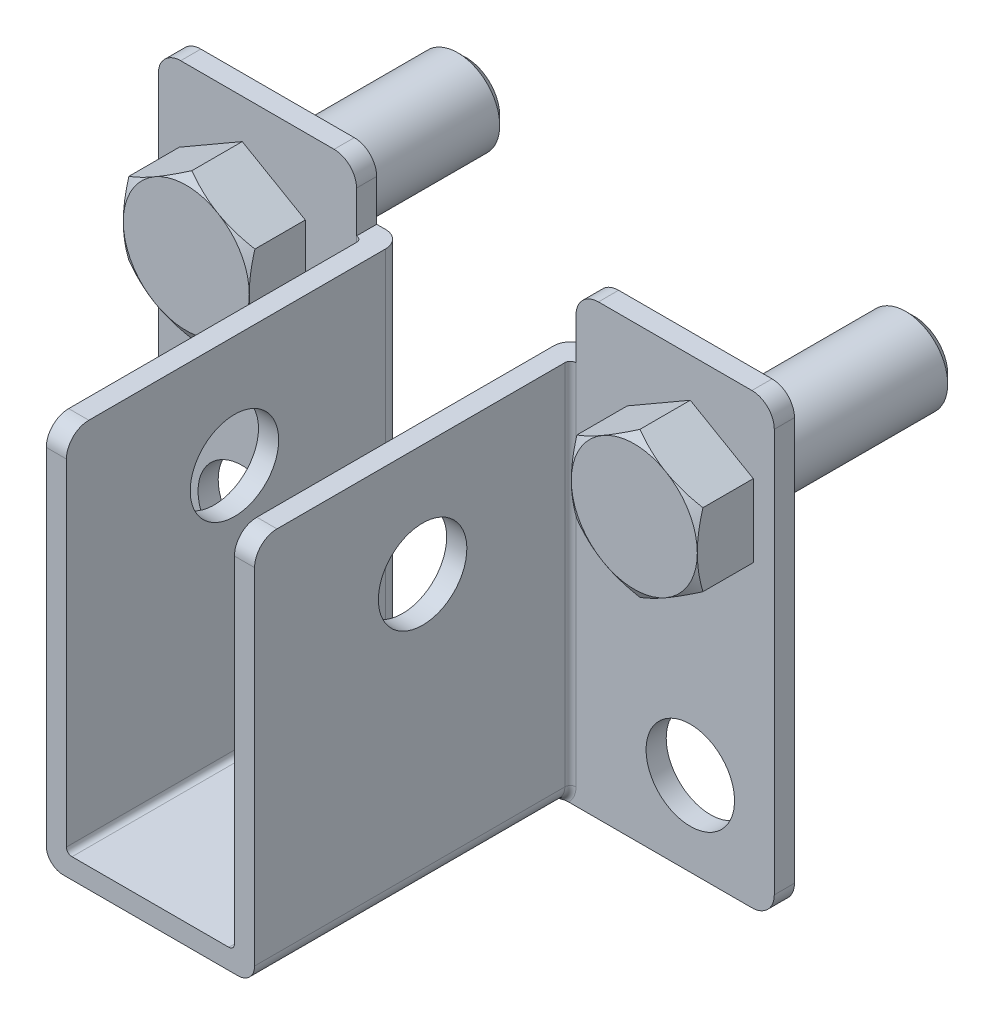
ISO-10303-21;
HEADER;
FILE_DESCRIPTION(('STEP AP214'),'2;1');
FILE_NAME('part.step','',(''),(''),'','','');
FILE_SCHEMA(('AUTOMOTIVE_DESIGN { 1 0 10303 214 1 1 1 1 }'));
ENDSEC;
DATA;
#1=APPLICATION_CONTEXT('core data for automotive mechanical design processes');
#2=APPLICATION_PROTOCOL_DEFINITION('international standard','automotive_design',2000,#1);
#3=PRODUCT_CONTEXT('',#1,'mechanical');
#4=PRODUCT('Part','Part','',(#3));
#5=PRODUCT_RELATED_PRODUCT_CATEGORY('part','',(#4));
#6=PRODUCT_DEFINITION_FORMATION('','',#4);
#7=PRODUCT_DEFINITION_CONTEXT('part definition',#1,'design');
#8=PRODUCT_DEFINITION('design','',#6,#7);
#9=PRODUCT_DEFINITION_SHAPE('','',#8);
#10=(LENGTH_UNIT() NAMED_UNIT(*) SI_UNIT(.MILLI.,.METRE.));
#11=(NAMED_UNIT(*) PLANE_ANGLE_UNIT() SI_UNIT($,.RADIAN.));
#12=(NAMED_UNIT(*) SI_UNIT($,.STERADIAN.) SOLID_ANGLE_UNIT());
#13=UNCERTAINTY_MEASURE_WITH_UNIT(LENGTH_MEASURE(1.E-05),#10,'distance_accuracy_value','');
#14=(GEOMETRIC_REPRESENTATION_CONTEXT(3) GLOBAL_UNCERTAINTY_ASSIGNED_CONTEXT((#13)) GLOBAL_UNIT_ASSIGNED_CONTEXT((#10,
#11,#12)) REPRESENTATION_CONTEXT('',''));
#15=CARTESIAN_POINT('',(0.,0.,0.));
#16=DIRECTION('',(0.,0.,1.));
#17=DIRECTION('',(1.,0.,0.));
#18=AXIS2_PLACEMENT_3D('',#15,#16,#17);
#19=CARTESIAN_POINT('',(-18.25625,42.2244459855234,2.286));
#20=DIRECTION('',(0.,0.,1.));
#21=DIRECTION('',(1.,0.,0.));
#22=AXIS2_PLACEMENT_3D('',#19,#20,#21);
#23=PLANE('',#22);
#24=CARTESIAN_POINT('',(-25.4,38.1,2.286));
#25=DIRECTION('',(0.,0.,1.));
#26=DIRECTION('',(1.,0.,0.));
#27=AXIS2_PLACEMENT_3D('',#24,#25,#26);
#28=CIRCLE('',#27,4.7625);
#29=CARTESIAN_POINT('',(-20.6375,38.1,2.286));
#30=VERTEX_POINT('',#29);
#31=EDGE_CURVE('E570',#30,#30,#28,.F.);
#32=ORIENTED_EDGE('',*,*,#31,.F.);
#33=EDGE_LOOP('',(#32));
#34=FACE_BOUND('',#33,.T.);
#35=CARTESIAN_POINT('',(-25.4,38.1,2.286));
#36=DIRECTION('',(0.,0.,1.));
#37=DIRECTION('',(1.,0.,0.));
#38=AXIS2_PLACEMENT_3D('',#35,#36,#37);
#39=CIRCLE('',#38,5.0165);
#40=CARTESIAN_POINT('',(-30.4165,38.1,2.286));
#41=VERTEX_POINT('',#40);
#42=EDGE_CURVE('E1469',#41,#41,#39,.F.);
#43=ORIENTED_EDGE('',*,*,#42,.T.);
#44=EDGE_LOOP('',(#43));
#45=FACE_BOUND('',#44,.T.);
#46=ADVANCED_FACE('F40',(#34,#45),#23,.F.);
#47=CARTESIAN_POINT('',(-25.4,38.1,2.286));
#48=DIRECTION('',(0.,0.,-1.));
#49=DIRECTION('',(-1.,0.,0.));
#50=AXIS2_PLACEMENT_3D('',#47,#48,#49);
#51=CYLINDRICAL_SURFACE('',#50,4.7625);
#52=CARTESIAN_POINT('',(-25.4,38.1,-22.14245));
#53=DIRECTION('',(0.,0.,-1.));
#54=DIRECTION('',(-1.,0.,0.));
#55=AXIS2_PLACEMENT_3D('',#52,#53,#54);
#56=CIRCLE('',#55,4.7625);
#57=CARTESIAN_POINT('',(-30.1625,38.1,-22.14245));
#58=VERTEX_POINT('',#57);
#59=EDGE_CURVE('E569',#58,#58,#56,.F.);
#60=ORIENTED_EDGE('',*,*,#59,.T.);
#61=EDGE_LOOP('',(#60));
#62=FACE_BOUND('',#61,.T.);
#63=ORIENTED_EDGE('',*,*,#31,.T.);
#64=EDGE_LOOP('',(#63));
#65=FACE_BOUND('',#64,.T.);
#66=ADVANCED_FACE('F466',(#62,#65),#51,.T.);
#67=CARTESIAN_POINT('',(-25.4,38.1,-23.114));
#68=DIRECTION('',(0.,0.,-1.));
#69=DIRECTION('',(-1.,0.,0.));
#70=AXIS2_PLACEMENT_3D('',#67,#68,#69);
#71=PLANE('',#70);
#72=CARTESIAN_POINT('',(-25.4,38.1,-23.114));
#73=DIRECTION('',(0.,0.,-1.));
#74=DIRECTION('',(-1.,0.,0.));
#75=AXIS2_PLACEMENT_3D('',#72,#73,#74);
#76=CIRCLE('',#75,3.79095);
#77=CARTESIAN_POINT('',(-29.19095,38.1,-23.114));
#78=VERTEX_POINT('',#77);
#79=EDGE_CURVE('E567',#78,#78,#76,.T.);
#80=ORIENTED_EDGE('',*,*,#79,.T.);
#81=EDGE_LOOP('',(#80));
#82=FACE_BOUND('',#81,.T.);
#83=ADVANCED_FACE('F473',(#82),#71,.T.);
#84=CARTESIAN_POINT('',(-25.4,38.1,-23.114));
#85=DIRECTION('',(0.,0.,1.));
#86=DIRECTION('',(1.,0.,0.));
#87=AXIS2_PLACEMENT_3D('',#84,#85,#86);
#88=CONICAL_SURFACE('',#87,3.79095,0.785398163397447);
#89=ORIENTED_EDGE('',*,*,#59,.F.);
#90=EDGE_LOOP('',(#89));
#91=FACE_BOUND('',#90,.T.);
#92=ORIENTED_EDGE('',*,*,#79,.F.);
#93=EDGE_LOOP('',(#92));
#94=FACE_BOUND('',#93,.T.);
#95=ADVANCED_FACE('F42',(#91,#94),#88,.T.);
#96=CARTESIAN_POINT('',(-34.925,0.,2.286));
#97=DIRECTION('',(0.,0.,1.));
#98=DIRECTION('',(1.,0.,0.));
#99=AXIS2_PLACEMENT_3D('',#96,#97,#98);
#100=PLANE('',#99);
#101=CARTESIAN_POINT('',(-25.4,9.525,2.286));
#102=DIRECTION('',(0.,0.,1.));
#103=DIRECTION('',(1.,0.,0.));
#104=AXIS2_PLACEMENT_3D('',#101,#102,#103);
#105=CIRCLE('',#104,5.0165);
#106=CARTESIAN_POINT('',(-30.4165,9.525,2.286));
#107=VERTEX_POINT('',#106);
#108=EDGE_CURVE('E1482',#107,#107,#105,.F.);
#109=ORIENTED_EDGE('',*,*,#108,.T.);
#110=EDGE_LOOP('',(#109));
#111=FACE_BOUND('',#110,.T.);
#112=DIRECTION('',(0.,-1.,0.));
#113=VECTOR('',#112,1.);
#114=CARTESIAN_POINT('',(-34.925,50.8,2.286));
#115=LINE('',#114,#113);
#116=CARTESIAN_POINT('',(-34.925,48.26,2.286));
#117=VERTEX_POINT('',#116);
#118=CARTESIAN_POINT('',(-34.925,2.54,2.286));
#119=VERTEX_POINT('',#118);
#120=EDGE_CURVE('E1529',#117,#119,#115,.T.);
#121=ORIENTED_EDGE('',*,*,#120,.T.);
#122=CARTESIAN_POINT('',(-32.385,2.54,2.286));
#123=DIRECTION('',(0.,0.,1.));
#124=DIRECTION('',(1.,0.,0.));
#125=AXIS2_PLACEMENT_3D('',#122,#123,#124);
#126=CIRCLE('',#125,2.54);
#127=CARTESIAN_POINT('',(-32.385,0.,2.286));
#128=VERTEX_POINT('',#127);
#129=EDGE_CURVE('E1452',#119,#128,#126,.T.);
#130=ORIENTED_EDGE('',*,*,#129,.T.);
#131=DIRECTION('',(1.,0.,0.));
#132=VECTOR('',#131,1.);
#133=CARTESIAN_POINT('',(-34.925,0.,2.286));
#134=LINE('',#133,#132);
#135=CARTESIAN_POINT('',(-11.586052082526,0.,2.286));
#136=VERTEX_POINT('',#135);
#137=EDGE_CURVE('E1532',#128,#136,#134,.T.);
#138=ORIENTED_EDGE('',*,*,#137,.T.);
#139=CARTESIAN_POINT('',(-9.906,1.905,2.286));
#140=DIRECTION('',(0.,0.,1.));
#141=DIRECTION('',(1.,0.,0.));
#142=AXIS2_PLACEMENT_3D('',#139,#140,#141);
#143=CIRCLE('',#142,2.54);
#144=CARTESIAN_POINT('',(-12.446,1.905,2.286));
#145=VERTEX_POINT('',#144);
#146=EDGE_CURVE('E1631',#136,#145,#143,.F.);
#147=ORIENTED_EDGE('',*,*,#146,.T.);
#148=DIRECTION('',(0.,-1.,0.));
#149=VECTOR('',#148,1.);
#150=CARTESIAN_POINT('',(-12.446,0.,2.286));
#151=LINE('',#150,#149);
#152=CARTESIAN_POINT('',(-12.446,43.561,2.286));
#153=VERTEX_POINT('',#152);
#154=EDGE_CURVE('E1628',#145,#153,#151,.F.);
#155=ORIENTED_EDGE('',*,*,#154,.T.);
#156=DIRECTION('',(0.,1.,0.));
#157=VECTOR('',#156,1.);
#158=CARTESIAN_POINT('',(-12.446,0.,2.286));
#159=LINE('',#158,#157);
#160=CARTESIAN_POINT('',(-12.446,48.26,2.286));
#161=VERTEX_POINT('',#160);
#162=EDGE_CURVE('E1525',#153,#161,#159,.T.);
#163=ORIENTED_EDGE('',*,*,#162,.T.);
#164=CARTESIAN_POINT('',(-14.986,48.26,2.286));
#165=DIRECTION('',(0.,0.,1.));
#166=DIRECTION('',(1.,0.,0.));
#167=AXIS2_PLACEMENT_3D('',#164,#165,#166);
#168=CIRCLE('',#167,2.54);
#169=CARTESIAN_POINT('',(-14.986,50.8,2.286));
#170=VERTEX_POINT('',#169);
#171=EDGE_CURVE('E1450',#161,#170,#168,.T.);
#172=ORIENTED_EDGE('',*,*,#171,.T.);
#173=DIRECTION('',(-1.,0.,0.));
#174=VECTOR('',#173,1.);
#175=CARTESIAN_POINT('',(-34.925,50.8,2.286));
#176=LINE('',#175,#174);
#177=CARTESIAN_POINT('',(-32.385,50.8,2.286));
#178=VERTEX_POINT('',#177);
#179=EDGE_CURVE('E1535',#170,#178,#176,.T.);
#180=ORIENTED_EDGE('',*,*,#179,.T.);
#181=CARTESIAN_POINT('',(-32.385,48.26,2.286));
#182=DIRECTION('',(0.,0.,1.));
#183=DIRECTION('',(1.,0.,0.));
#184=AXIS2_PLACEMENT_3D('',#181,#182,#183);
#185=CIRCLE('',#184,2.54);
#186=EDGE_CURVE('E1448',#178,#117,#185,.T.);
#187=ORIENTED_EDGE('',*,*,#186,.T.);
#188=EDGE_LOOP('',(#121,#130,#138,#147,#155,#163,#172,#180,#187));
#189=FACE_BOUND('',#188,.T.);
#190=DIRECTION('',(0.,1.,0.));
#191=VECTOR('',#190,1.);
#192=CARTESIAN_POINT('',(-18.25625,33.9755540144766,2.286));
#193=LINE('',#192,#191);
#194=CARTESIAN_POINT('',(-18.25625,33.9755540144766,2.286));
#195=VERTEX_POINT('',#194);
#196=CARTESIAN_POINT('',(-18.25625,42.2244459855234,2.286));
#197=VERTEX_POINT('',#196);
#198=EDGE_CURVE('E608',#195,#197,#193,.T.);
#199=ORIENTED_EDGE('',*,*,#198,.F.);
#200=DIRECTION('',(0.866025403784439,0.5,0.));
#201=VECTOR('',#200,1.);
#202=CARTESIAN_POINT('',(-25.4,29.8511080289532,2.286));
#203=LINE('',#202,#201);
#204=CARTESIAN_POINT('',(-25.4,29.8511080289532,2.286));
#205=VERTEX_POINT('',#204);
#206=EDGE_CURVE('E594',#205,#195,#203,.T.);
#207=ORIENTED_EDGE('',*,*,#206,.F.);
#208=DIRECTION('',(0.866025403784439,-0.5,0.));
#209=VECTOR('',#208,1.);
#210=CARTESIAN_POINT('',(-32.54375,33.9755540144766,2.286));
#211=LINE('',#210,#209);
#212=CARTESIAN_POINT('',(-32.54375,33.9755540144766,2.286));
#213=VERTEX_POINT('',#212);
#214=EDGE_CURVE('E597',#213,#205,#211,.T.);
#215=ORIENTED_EDGE('',*,*,#214,.F.);
#216=DIRECTION('',(0.,-1.,0.));
#217=VECTOR('',#216,1.);
#218=CARTESIAN_POINT('',(-32.54375,42.2244459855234,2.286));
#219=LINE('',#218,#217);
#220=CARTESIAN_POINT('',(-32.54375,42.2244459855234,2.286));
#221=VERTEX_POINT('',#220);
#222=EDGE_CURVE('E600',#221,#213,#219,.T.);
#223=ORIENTED_EDGE('',*,*,#222,.F.);
#224=DIRECTION('',(-0.866025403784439,-0.5,0.));
#225=VECTOR('',#224,1.);
#226=CARTESIAN_POINT('',(-25.4,46.3488919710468,2.286));
#227=LINE('',#226,#225);
#228=CARTESIAN_POINT('',(-25.4,46.3488919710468,2.286));
#229=VERTEX_POINT('',#228);
#230=EDGE_CURVE('E603',#229,#221,#227,.T.);
#231=ORIENTED_EDGE('',*,*,#230,.F.);
#232=DIRECTION('',(-0.866025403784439,0.5,0.));
#233=VECTOR('',#232,1.);
#234=CARTESIAN_POINT('',(-18.25625,42.2244459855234,2.286));
#235=LINE('',#234,#233);
#236=EDGE_CURVE('E606',#197,#229,#235,.T.);
#237=ORIENTED_EDGE('',*,*,#236,.F.);
#238=EDGE_LOOP('',(#199,#207,#215,#223,#231,#237));
#239=FACE_BOUND('',#238,.T.);
#240=ADVANCED_FACE('F563',(#111,#189,#239),#100,.T.);
#241=CARTESIAN_POINT('',(9.52500000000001,0.,2.286));
#242=DIRECTION('',(0.,0.,1.));
#243=DIRECTION('',(1.,0.,0.));
#244=AXIS2_PLACEMENT_3D('',#241,#242,#243);
#245=PLANE('',#244);
#246=CARTESIAN_POINT('',(25.4,9.525,2.286));
#247=DIRECTION('',(0.,0.,1.));
#248=DIRECTION('',(1.,0.,0.));
#249=AXIS2_PLACEMENT_3D('',#246,#247,#248);
#250=CIRCLE('',#249,5.0165);
#251=CARTESIAN_POINT('',(20.3835,9.525,2.286));
#252=VERTEX_POINT('',#251);
#253=EDGE_CURVE('E1478',#252,#252,#250,.F.);
#254=ORIENTED_EDGE('',*,*,#253,.T.);
#255=EDGE_LOOP('',(#254));
#256=FACE_BOUND('',#255,.T.);
#257=DIRECTION('',(1.,0.,0.));
#258=VECTOR('',#257,1.);
#259=CARTESIAN_POINT('',(9.52500000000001,0.,2.286));
#260=LINE('',#259,#258);
#261=CARTESIAN_POINT('',(11.586052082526,0.,2.286));
#262=VERTEX_POINT('',#261);
#263=CARTESIAN_POINT('',(32.385,0.,2.286));
#264=VERTEX_POINT('',#263);
#265=EDGE_CURVE('E1570',#262,#264,#260,.T.);
#266=ORIENTED_EDGE('',*,*,#265,.T.);
#267=CARTESIAN_POINT('',(32.385,2.54,2.286));
#268=DIRECTION('',(0.,0.,1.));
#269=DIRECTION('',(1.,0.,0.));
#270=AXIS2_PLACEMENT_3D('',#267,#268,#269);
#271=CIRCLE('',#270,2.54);
#272=CARTESIAN_POINT('',(34.925,2.54,2.286));
#273=VERTEX_POINT('',#272);
#274=EDGE_CURVE('E1423',#264,#273,#271,.T.);
#275=ORIENTED_EDGE('',*,*,#274,.T.);
#276=DIRECTION('',(0.,1.,0.));
#277=VECTOR('',#276,1.);
#278=CARTESIAN_POINT('',(34.925,50.8,2.286));
#279=LINE('',#278,#277);
#280=CARTESIAN_POINT('',(34.925,48.26,2.286));
#281=VERTEX_POINT('',#280);
#282=EDGE_CURVE('E1573',#273,#281,#279,.T.);
#283=ORIENTED_EDGE('',*,*,#282,.T.);
#284=CARTESIAN_POINT('',(32.385,48.26,2.286));
#285=DIRECTION('',(0.,0.,1.));
#286=DIRECTION('',(1.,0.,0.));
#287=AXIS2_PLACEMENT_3D('',#284,#285,#286);
#288=CIRCLE('',#287,2.54);
#289=CARTESIAN_POINT('',(32.385,50.8,2.286));
#290=VERTEX_POINT('',#289);
#291=EDGE_CURVE('E1421',#281,#290,#288,.T.);
#292=ORIENTED_EDGE('',*,*,#291,.T.);
#293=DIRECTION('',(-1.,0.,0.));
#294=VECTOR('',#293,1.);
#295=CARTESIAN_POINT('',(9.525,50.8,2.286));
#296=LINE('',#295,#294);
#297=CARTESIAN_POINT('',(14.986,50.8,2.286));
#298=VERTEX_POINT('',#297);
#299=EDGE_CURVE('E1577',#290,#298,#296,.T.);
#300=ORIENTED_EDGE('',*,*,#299,.T.);
#301=CARTESIAN_POINT('',(14.986,48.26,2.286));
#302=DIRECTION('',(0.,0.,1.));
#303=DIRECTION('',(1.,0.,0.));
#304=AXIS2_PLACEMENT_3D('',#301,#302,#303);
#305=CIRCLE('',#304,2.54);
#306=CARTESIAN_POINT('',(12.446,48.26,2.286));
#307=VERTEX_POINT('',#306);
#308=EDGE_CURVE('E1419',#298,#307,#305,.T.);
#309=ORIENTED_EDGE('',*,*,#308,.T.);
#310=DIRECTION('',(0.,-1.,0.));
#311=VECTOR('',#310,1.);
#312=CARTESIAN_POINT('',(12.446,0.,2.286));
#313=LINE('',#312,#311);
#314=CARTESIAN_POINT('',(12.446,43.561,2.286));
#315=VERTEX_POINT('',#314);
#316=EDGE_CURVE('E1397',#307,#315,#313,.T.);
#317=ORIENTED_EDGE('',*,*,#316,.T.);
#318=DIRECTION('',(0.,-1.,0.));
#319=VECTOR('',#318,1.);
#320=CARTESIAN_POINT('',(12.446,0.,2.286));
#321=LINE('',#320,#319);
#322=CARTESIAN_POINT('',(12.446,1.905,2.286));
#323=VERTEX_POINT('',#322);
#324=EDGE_CURVE('E1636',#315,#323,#321,.T.);
#325=ORIENTED_EDGE('',*,*,#324,.T.);
#326=CARTESIAN_POINT('',(9.906,1.905,2.286));
#327=DIRECTION('',(0.,0.,1.));
#328=DIRECTION('',(1.,0.,0.));
#329=AXIS2_PLACEMENT_3D('',#326,#327,#328);
#330=CIRCLE('',#329,2.54);
#331=EDGE_CURVE('E1638',#323,#262,#330,.F.);
#332=ORIENTED_EDGE('',*,*,#331,.T.);
#333=EDGE_LOOP('',(#266,#275,#283,#292,#300,#309,#317,#325,#332));
#334=FACE_BOUND('',#333,.T.);
#335=DIRECTION('',(-0.866025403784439,0.5,0.));
#336=VECTOR('',#335,1.);
#337=CARTESIAN_POINT('',(32.54375,42.2244459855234,2.286));
#338=LINE('',#337,#336);
#339=CARTESIAN_POINT('',(32.54375,42.2244459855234,2.286));
#340=VERTEX_POINT('',#339);
#341=CARTESIAN_POINT('',(25.4,46.3488919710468,2.286));
#342=VERTEX_POINT('',#341);
#343=EDGE_CURVE('E1752',#340,#342,#338,.T.);
#344=ORIENTED_EDGE('',*,*,#343,.F.);
#345=DIRECTION('',(0.,1.,0.));
#346=VECTOR('',#345,1.);
#347=CARTESIAN_POINT('',(32.54375,33.9755540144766,2.286));
#348=LINE('',#347,#346);
#349=CARTESIAN_POINT('',(32.54375,33.9755540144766,2.286));
#350=VERTEX_POINT('',#349);
#351=EDGE_CURVE('E1755',#350,#340,#348,.T.);
#352=ORIENTED_EDGE('',*,*,#351,.F.);
#353=DIRECTION('',(0.866025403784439,0.5,0.));
#354=VECTOR('',#353,1.);
#355=CARTESIAN_POINT('',(25.4,29.8511080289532,2.286));
#356=LINE('',#355,#354);
#357=CARTESIAN_POINT('',(25.4,29.8511080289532,2.286));
#358=VERTEX_POINT('',#357);
#359=EDGE_CURVE('E1768',#358,#350,#356,.T.);
#360=ORIENTED_EDGE('',*,*,#359,.F.);
#361=DIRECTION('',(0.866025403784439,-0.5,0.));
#362=VECTOR('',#361,1.);
#363=CARTESIAN_POINT('',(18.25625,33.9755540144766,2.286));
#364=LINE('',#363,#362);
#365=CARTESIAN_POINT('',(18.25625,33.9755540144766,2.286));
#366=VERTEX_POINT('',#365);
#367=EDGE_CURVE('E1766',#366,#358,#364,.T.);
#368=ORIENTED_EDGE('',*,*,#367,.F.);
#369=DIRECTION('',(0.,-1.,0.));
#370=VECTOR('',#369,1.);
#371=CARTESIAN_POINT('',(18.25625,42.2244459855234,2.286));
#372=LINE('',#371,#370);
#373=CARTESIAN_POINT('',(18.25625,42.2244459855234,2.286));
#374=VERTEX_POINT('',#373);
#375=EDGE_CURVE('E1760',#374,#366,#372,.T.);
#376=ORIENTED_EDGE('',*,*,#375,.F.);
#377=DIRECTION('',(-0.866025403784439,-0.5,0.));
#378=VECTOR('',#377,1.);
#379=CARTESIAN_POINT('',(25.4,46.3488919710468,2.286));
#380=LINE('',#379,#378);
#381=EDGE_CURVE('E1758',#342,#374,#380,.T.);
#382=ORIENTED_EDGE('',*,*,#381,.F.);
#383=EDGE_LOOP('',(#344,#352,#360,#368,#376,#382));
#384=FACE_BOUND('',#383,.T.);
#385=ADVANCED_FACE('F1287',(#256,#334,#384),#245,.T.);
#386=CARTESIAN_POINT('',(9.52500000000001,0.,0.));
#387=DIRECTION('',(0.,0.,1.));
#388=DIRECTION('',(1.,0.,0.));
#389=AXIS2_PLACEMENT_3D('',#386,#387,#388);
#390=PLANE('',#389);
#391=DIRECTION('',(0.,1.,0.));
#392=VECTOR('',#391,1.);
#393=CARTESIAN_POINT('',(34.925,50.8,0.));
#394=LINE('',#393,#392);
#395=CARTESIAN_POINT('',(34.925,2.54,0.));
#396=VERTEX_POINT('',#395);
#397=CARTESIAN_POINT('',(34.925,48.26,0.));
#398=VERTEX_POINT('',#397);
#399=EDGE_CURVE('E1583',#396,#398,#394,.T.);
#400=ORIENTED_EDGE('',*,*,#399,.F.);
#401=CARTESIAN_POINT('',(32.385,2.54,0.));
#402=DIRECTION('',(0.,0.,1.));
#403=DIRECTION('',(1.,0.,0.));
#404=AXIS2_PLACEMENT_3D('',#401,#402,#403);
#405=CIRCLE('',#404,2.54);
#406=CARTESIAN_POINT('',(32.385,0.,0.));
#407=VERTEX_POINT('',#406);
#408=EDGE_CURVE('E1412',#396,#407,#405,.F.);
#409=ORIENTED_EDGE('',*,*,#408,.T.);
#410=DIRECTION('',(1.,0.,0.));
#411=VECTOR('',#410,1.);
#412=CARTESIAN_POINT('',(9.52500000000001,0.,0.));
#413=LINE('',#412,#411);
#414=CARTESIAN_POINT('',(-32.385,0.,0.));
#415=VERTEX_POINT('',#414);
#416=EDGE_CURVE('E1569',#415,#407,#413,.T.);
#417=ORIENTED_EDGE('',*,*,#416,.F.);
#418=CARTESIAN_POINT('',(-32.385,2.54,0.));
#419=DIRECTION('',(0.,0.,1.));
#420=DIRECTION('',(1.,0.,0.));
#421=AXIS2_PLACEMENT_3D('',#418,#419,#420);
#422=CIRCLE('',#421,2.54);
#423=CARTESIAN_POINT('',(-34.925,2.54,0.));
#424=VERTEX_POINT('',#423);
#425=EDGE_CURVE('E1410',#415,#424,#422,.F.);
#426=ORIENTED_EDGE('',*,*,#425,.T.);
#427=DIRECTION('',(0.,-1.,0.));
#428=VECTOR('',#427,1.);
#429=CARTESIAN_POINT('',(-34.925,50.8,0.));
#430=LINE('',#429,#428);
#431=CARTESIAN_POINT('',(-34.925,48.26,0.));
#432=VERTEX_POINT('',#431);
#433=EDGE_CURVE('E1388',#432,#424,#430,.T.);
#434=ORIENTED_EDGE('',*,*,#433,.F.);
#435=CARTESIAN_POINT('',(-32.385,48.26,0.));
#436=DIRECTION('',(0.,0.,1.));
#437=DIRECTION('',(1.,0.,0.));
#438=AXIS2_PLACEMENT_3D('',#435,#436,#437);
#439=CIRCLE('',#438,2.54);
#440=CARTESIAN_POINT('',(-32.385,50.8,0.));
#441=VERTEX_POINT('',#440);
#442=EDGE_CURVE('E1402',#432,#441,#439,.F.);
#443=ORIENTED_EDGE('',*,*,#442,.T.);
#444=DIRECTION('',(-1.,0.,0.));
#445=VECTOR('',#444,1.);
#446=CARTESIAN_POINT('',(-34.925,50.8,0.));
#447=LINE('',#446,#445);
#448=CARTESIAN_POINT('',(-14.986,50.8,0.));
#449=VERTEX_POINT('',#448);
#450=EDGE_CURVE('E1533',#449,#441,#447,.T.);
#451=ORIENTED_EDGE('',*,*,#450,.F.);
#452=CARTESIAN_POINT('',(-14.986,48.26,0.));
#453=DIRECTION('',(0.,0.,1.));
#454=DIRECTION('',(1.,0.,0.));
#455=AXIS2_PLACEMENT_3D('',#452,#453,#454);
#456=CIRCLE('',#455,2.54);
#457=CARTESIAN_POINT('',(-12.446,48.26,0.));
#458=VERTEX_POINT('',#457);
#459=EDGE_CURVE('E1404',#449,#458,#456,.F.);
#460=ORIENTED_EDGE('',*,*,#459,.T.);
#461=DIRECTION('',(0.,-1.,0.));
#462=VECTOR('',#461,1.);
#463=CARTESIAN_POINT('',(-12.446,43.561,0.));
#464=LINE('',#463,#462);
#465=CARTESIAN_POINT('',(-12.446,43.561,0.));
#466=VERTEX_POINT('',#465);
#467=EDGE_CURVE('E1472',#458,#466,#464,.T.);
#468=ORIENTED_EDGE('',*,*,#467,.T.);
#469=DIRECTION('',(1.,0.,0.));
#470=VECTOR('',#469,1.);
#471=CARTESIAN_POINT('',(-12.446,43.561,0.));
#472=LINE('',#471,#470);
#473=CARTESIAN_POINT('',(-11.43,43.561,0.));
#474=VERTEX_POINT('',#473);
#475=EDGE_CURVE('E1508',#466,#474,#472,.T.);
#476=ORIENTED_EDGE('',*,*,#475,.T.);
#477=DIRECTION('',(0.,1.,0.));
#478=VECTOR('',#477,1.);
#479=CARTESIAN_POINT('',(-11.43,0.,0.));
#480=LINE('',#479,#478);
#481=CARTESIAN_POINT('',(-11.43,2.92100000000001,0.));
#482=VERTEX_POINT('',#481);
#483=EDGE_CURVE('E1589',#474,#482,#480,.F.);
#484=ORIENTED_EDGE('',*,*,#483,.T.);
#485=CARTESIAN_POINT('',(-9.74994791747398,2.286,0.));
#486=CARTESIAN_POINT('',(-9.79794700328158,2.28601233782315,0.));
#487=CARTESIAN_POINT('',(-9.84588089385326,2.28837822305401,0.));
#488=CARTESIAN_POINT('',(-9.9412747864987,2.29720686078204,0.));
#489=CARTESIAN_POINT('',(-9.98873558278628,2.30366084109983,0.));
#490=CARTESIAN_POINT('',(-10.128833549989,2.32802242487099,0.));
#491=CARTESIAN_POINT('',(-10.2205908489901,2.35096646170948,0.));
#492=CARTESIAN_POINT('',(-10.4089432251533,2.40912868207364,0.));
#493=CARTESIAN_POINT('',(-10.5052422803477,2.44525736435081,0.));
#494=CARTESIAN_POINT('',(-10.6945199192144,2.52544582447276,0.));
#495=CARTESIAN_POINT('',(-10.7874945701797,2.56951464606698,0.));
#496=CARTESIAN_POINT('',(-11.0637857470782,2.70964646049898,0.));
#497=CARTESIAN_POINT('',(-11.2432064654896,2.81315580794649,0.));
#498=CARTESIAN_POINT('',(-11.4249601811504,2.91809027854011,0.));
#499=CARTESIAN_POINT('',(-11.4274801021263,2.91954515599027,0.));
#500=CARTESIAN_POINT('',(-11.43,2.92100000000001,0.));
#501=B_SPLINE_CURVE_WITH_KNOTS('',3,(#485,#486,#487,#488,#489,#490,#491,#492,#493,#494,#495,
#496,#497,#498,#499,#500),.UNSPECIFIED.,.F.,.F.,(4,2,2,2,2,2,2,4),(0.,0.14384167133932,
0.28737572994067,0.570275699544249,0.878348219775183,1.1867738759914,1.80764863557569,
1.81637789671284),.UNSPECIFIED.);
#502=CARTESIAN_POINT('',(-9.74994791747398,2.286,0.));
#503=VERTEX_POINT('',#502);
#504=EDGE_CURVE('E1348',#482,#503,#501,.F.);
#505=ORIENTED_EDGE('',*,*,#504,.T.);
#506=DIRECTION('',(-1.,0.,0.));
#507=VECTOR('',#506,1.);
#508=CARTESIAN_POINT('',(-9.525,2.286,0.));
#509=LINE('',#508,#507);
#510=CARTESIAN_POINT('',(9.74994791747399,2.286,0.));
#511=VERTEX_POINT('',#510);
#512=EDGE_CURVE('E1538',#511,#503,#509,.T.);
#513=ORIENTED_EDGE('',*,*,#512,.F.);
#514=CARTESIAN_POINT('',(9.74994791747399,2.286,0.));
#515=CARTESIAN_POINT('',(9.79794700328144,2.28601233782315,0.));
#516=CARTESIAN_POINT('',(9.84588089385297,2.288378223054,0.));
#517=CARTESIAN_POINT('',(9.94127478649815,2.29720686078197,0.));
#518=CARTESIAN_POINT('',(9.98873558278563,2.30366084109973,0.));
#519=CARTESIAN_POINT('',(10.1288335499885,2.32802242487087,0.));
#520=CARTESIAN_POINT('',(10.2205908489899,2.35096646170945,0.));
#521=CARTESIAN_POINT('',(10.4089432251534,2.40912868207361,0.));
#522=CARTESIAN_POINT('',(10.5052422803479,2.44525736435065,0.));
#523=CARTESIAN_POINT('',(10.6945199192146,2.52544582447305,0.));
#524=CARTESIAN_POINT('',(10.7874945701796,2.56951464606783,0.));
#525=CARTESIAN_POINT('',(11.0637857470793,2.70964646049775,0.));
#526=CARTESIAN_POINT('',(11.2432064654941,2.81315580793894,0.));
#527=CARTESIAN_POINT('',(11.4249601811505,2.9180902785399,0.));
#528=CARTESIAN_POINT('',(11.4274801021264,2.91954515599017,0.));
#529=CARTESIAN_POINT('',(11.43,2.92100000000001,0.));
#530=B_SPLINE_CURVE_WITH_KNOTS('',3,(#514,#515,#516,#517,#518,#519,#520,#521,#522,#523,#524,
#525,#526,#527,#528,#529),.UNSPECIFIED.,.F.,.F.,(4,2,2,2,2,2,2,4),(0.,0.143841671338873,
0.287375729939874,0.57027569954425,0.878348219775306,1.18677387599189,1.80764863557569,
1.81637789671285),.UNSPECIFIED.);
#531=CARTESIAN_POINT('',(11.43,2.92100000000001,0.));
#532=VERTEX_POINT('',#531);
#533=EDGE_CURVE('E1354',#511,#532,#530,.T.);
#534=ORIENTED_EDGE('',*,*,#533,.T.);
#535=DIRECTION('',(0.,-1.,0.));
#536=VECTOR('',#535,1.);
#537=CARTESIAN_POINT('',(11.43,0.,0.));
#538=LINE('',#537,#536);
#539=CARTESIAN_POINT('',(11.43,43.561,0.));
#540=VERTEX_POINT('',#539);
#541=EDGE_CURVE('E1591',#532,#540,#538,.F.);
#542=ORIENTED_EDGE('',*,*,#541,.T.);
#543=CARTESIAN_POINT('',(12.446,43.561,0.));
#544=VERTEX_POINT('',#543);
#545=EDGE_CURVE('E1507',#540,#544,#472,.T.);
#546=ORIENTED_EDGE('',*,*,#545,.T.);
#547=DIRECTION('',(0.,1.,0.));
#548=VECTOR('',#547,1.);
#549=CARTESIAN_POINT('',(12.446,43.561,0.));
#550=LINE('',#549,#548);
#551=CARTESIAN_POINT('',(12.446,48.26,0.));
#552=VERTEX_POINT('',#551);
#553=EDGE_CURVE('E1511',#544,#552,#550,.T.);
#554=ORIENTED_EDGE('',*,*,#553,.T.);
#555=CARTESIAN_POINT('',(14.986,48.26,0.));
#556=DIRECTION('',(0.,0.,1.));
#557=DIRECTION('',(1.,0.,0.));
#558=AXIS2_PLACEMENT_3D('',#555,#556,#557);
#559=CIRCLE('',#558,2.54);
#560=CARTESIAN_POINT('',(14.986,50.8,0.));
#561=VERTEX_POINT('',#560);
#562=EDGE_CURVE('E1406',#552,#561,#559,.F.);
#563=ORIENTED_EDGE('',*,*,#562,.T.);
#564=DIRECTION('',(-1.,0.,0.));
#565=VECTOR('',#564,1.);
#566=CARTESIAN_POINT('',(9.525,50.8,0.));
#567=LINE('',#566,#565);
#568=CARTESIAN_POINT('',(32.385,50.8,0.));
#569=VERTEX_POINT('',#568);
#570=EDGE_CURVE('E1574',#569,#561,#567,.T.);
#571=ORIENTED_EDGE('',*,*,#570,.F.);
#572=CARTESIAN_POINT('',(32.385,48.26,0.));
#573=DIRECTION('',(0.,0.,1.));
#574=DIRECTION('',(1.,0.,0.));
#575=AXIS2_PLACEMENT_3D('',#572,#573,#574);
#576=CIRCLE('',#575,2.54);
#577=EDGE_CURVE('E1408',#569,#398,#576,.F.);
#578=ORIENTED_EDGE('',*,*,#577,.T.);
#579=EDGE_LOOP('',(#400,#409,#417,#426,#434,#443,#451,#460,#468,#476,#484,#505,#513,#534,#542,
#546,#554,#563,#571,#578));
#580=FACE_BOUND('',#579,.T.);
#581=CARTESIAN_POINT('',(-25.4,38.1,0.));
#582=DIRECTION('',(0.,0.,1.));
#583=DIRECTION('',(1.,0.,0.));
#584=AXIS2_PLACEMENT_3D('',#581,#582,#583);
#585=CIRCLE('',#584,5.0165);
#586=CARTESIAN_POINT('',(-30.4165,38.1,0.));
#587=VERTEX_POINT('',#586);
#588=EDGE_CURVE('E1473',#587,#587,#585,.T.);
#589=ORIENTED_EDGE('',*,*,#588,.T.);
#590=EDGE_LOOP('',(#589));
#591=FACE_BOUND('',#590,.T.);
#592=CARTESIAN_POINT('',(25.4,38.1,0.));
#593=DIRECTION('',(0.,0.,1.));
#594=DIRECTION('',(1.,0.,0.));
#595=AXIS2_PLACEMENT_3D('',#592,#593,#594);
#596=CIRCLE('',#595,5.0165);
#597=CARTESIAN_POINT('',(20.3835,38.1,0.));
#598=VERTEX_POINT('',#597);
#599=EDGE_CURVE('E1477',#598,#598,#596,.T.);
#600=ORIENTED_EDGE('',*,*,#599,.T.);
#601=EDGE_LOOP('',(#600));
#602=FACE_BOUND('',#601,.T.);
#603=CARTESIAN_POINT('',(25.4,9.525,0.));
#604=DIRECTION('',(0.,0.,1.));
#605=DIRECTION('',(1.,0.,0.));
#606=AXIS2_PLACEMENT_3D('',#603,#604,#605);
#607=CIRCLE('',#606,5.0165);
#608=CARTESIAN_POINT('',(20.3835,9.525,0.));
#609=VERTEX_POINT('',#608);
#610=EDGE_CURVE('E1481',#609,#609,#607,.T.);
#611=ORIENTED_EDGE('',*,*,#610,.T.);
#612=EDGE_LOOP('',(#611));
#613=FACE_BOUND('',#612,.T.);
#614=CARTESIAN_POINT('',(-25.4,9.525,0.));
#615=DIRECTION('',(0.,0.,1.));
#616=DIRECTION('',(1.,0.,0.));
#617=AXIS2_PLACEMENT_3D('',#614,#615,#616);
#618=CIRCLE('',#617,5.0165);
#619=CARTESIAN_POINT('',(-30.4165,9.525,0.));
#620=VERTEX_POINT('',#619);
#621=EDGE_CURVE('E1483',#620,#620,#618,.T.);
#622=ORIENTED_EDGE('',*,*,#621,.T.);
#623=EDGE_LOOP('',(#622));
#624=FACE_BOUND('',#623,.T.);
#625=ADVANCED_FACE('F1277',(#580,#591,#602,#613,#624),#390,.F.);
#626=CARTESIAN_POINT('',(9.525,50.8,2.286));
#627=DIRECTION('',(1.,0.,0.));
#628=DIRECTION('',(0.,1.,0.));
#629=AXIS2_PLACEMENT_3D('',#626,#627,#628);
#630=PLANE('',#629);
#631=CARTESIAN_POINT('',(9.525,30.861,19.05));
#632=DIRECTION('',(1.,0.,0.));
#633=DIRECTION('',(0.,1.,0.));
#634=AXIS2_PLACEMENT_3D('',#631,#632,#633);
#635=CIRCLE('',#634,5.0165);
#636=CARTESIAN_POINT('',(9.525,35.8775,19.05));
#637=VERTEX_POINT('',#636);
#638=EDGE_CURVE('E1492',#637,#637,#635,.T.);
#639=ORIENTED_EDGE('',*,*,#638,.T.);
#640=EDGE_LOOP('',(#639));
#641=FACE_BOUND('',#640,.T.);
#642=DIRECTION('',(0.,-1.,0.));
#643=VECTOR('',#642,1.);
#644=CARTESIAN_POINT('',(9.52500000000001,43.561,38.1));
#645=LINE('',#644,#643);
#646=CARTESIAN_POINT('',(9.52500000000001,41.021,38.1));
#647=VERTEX_POINT('',#646);
#648=CARTESIAN_POINT('',(9.525,2.92100000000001,38.1));
#649=VERTEX_POINT('',#648);
#650=EDGE_CURVE('E1551',#647,#649,#645,.T.);
#651=ORIENTED_EDGE('',*,*,#650,.F.);
#652=CARTESIAN_POINT('',(9.525,41.021,35.56));
#653=DIRECTION('',(1.,0.,0.));
#654=DIRECTION('',(0.,1.,0.));
#655=AXIS2_PLACEMENT_3D('',#652,#653,#654);
#656=CIRCLE('',#655,2.54);
#657=CARTESIAN_POINT('',(9.52500000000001,43.561,35.56));
#658=VERTEX_POINT('',#657);
#659=EDGE_CURVE('E1431',#647,#658,#656,.F.);
#660=ORIENTED_EDGE('',*,*,#659,.T.);
#661=DIRECTION('',(0.,0.,-1.));
#662=VECTOR('',#661,1.);
#663=CARTESIAN_POINT('',(9.52500000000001,43.561,38.1));
#664=LINE('',#663,#662);
#665=CARTESIAN_POINT('',(9.525,43.561,1.905));
#666=VERTEX_POINT('',#665);
#667=EDGE_CURVE('E1565',#658,#666,#664,.T.);
#668=ORIENTED_EDGE('',*,*,#667,.T.);
#669=DIRECTION('',(0.,-1.,0.));
#670=VECTOR('',#669,1.);
#671=CARTESIAN_POINT('',(9.525,50.8,1.905));
#672=LINE('',#671,#670);
#673=CARTESIAN_POINT('',(9.52500000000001,2.92100000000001,1.905));
#674=VERTEX_POINT('',#673);
#675=EDGE_CURVE('E1580',#666,#674,#672,.T.);
#676=ORIENTED_EDGE('',*,*,#675,.T.);
#677=DIRECTION('',(0.,0.,-1.));
#678=VECTOR('',#677,1.);
#679=CARTESIAN_POINT('',(9.52500000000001,2.921,38.1));
#680=LINE('',#679,#678);
#681=EDGE_CURVE('E1645',#674,#649,#680,.F.);
#682=ORIENTED_EDGE('',*,*,#681,.T.);
#683=EDGE_LOOP('',(#651,#660,#668,#676,#682));
#684=FACE_BOUND('',#683,.T.);
#685=ADVANCED_FACE('F1266',(#641,#684),#630,.F.);
#686=CARTESIAN_POINT('',(9.525,50.8,2.286));
#687=DIRECTION('',(0.,-1.,0.));
#688=DIRECTION('',(0.,0.,-1.));
#689=AXIS2_PLACEMENT_3D('',#686,#687,#688);
#690=PLANE('',#689);
#691=ORIENTED_EDGE('',*,*,#299,.F.);
#692=DIRECTION('',(0.,0.,-1.));
#693=VECTOR('',#692,1.);
#694=CARTESIAN_POINT('',(32.385,50.8,2.286));
#695=LINE('',#694,#693);
#696=EDGE_CURVE('E1456',#290,#569,#695,.T.);
#697=ORIENTED_EDGE('',*,*,#696,.T.);
#698=ORIENTED_EDGE('',*,*,#570,.T.);
#699=DIRECTION('',(0.,0.,-1.));
#700=VECTOR('',#699,1.);
#701=CARTESIAN_POINT('',(14.986,50.8,2.28600000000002));
#702=LINE('',#701,#700);
#703=EDGE_CURVE('E1454',#561,#298,#702,.F.);
#704=ORIENTED_EDGE('',*,*,#703,.T.);
#705=EDGE_LOOP('',(#691,#697,#698,#704));
#706=FACE_BOUND('',#705,.T.);
#707=ADVANCED_FACE('F1257',(#706),#690,.F.);
#708=CARTESIAN_POINT('',(-9.52500000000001,43.561,38.1));
#709=DIRECTION('',(-1.,0.,0.));
#710=DIRECTION('',(0.,-1.,0.));
#711=AXIS2_PLACEMENT_3D('',#708,#709,#710);
#712=PLANE('',#711);
#713=CARTESIAN_POINT('',(-9.525,30.861,19.05));
#714=DIRECTION('',(-1.,0.,0.));
#715=DIRECTION('',(0.,-1.,0.));
#716=AXIS2_PLACEMENT_3D('',#713,#714,#715);
#717=CIRCLE('',#716,5.0165);
#718=CARTESIAN_POINT('',(-9.525,30.861,14.0335));
#719=VERTEX_POINT('',#718);
#720=EDGE_CURVE('E1488',#719,#719,#717,.T.);
#721=ORIENTED_EDGE('',*,*,#720,.T.);
#722=EDGE_LOOP('',(#721));
#723=FACE_BOUND('',#722,.T.);
#724=DIRECTION('',(0.,0.,-1.));
#725=VECTOR('',#724,1.);
#726=CARTESIAN_POINT('',(-9.52500000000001,43.561,38.1));
#727=LINE('',#726,#725);
#728=CARTESIAN_POINT('',(-9.52500000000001,43.561,35.56));
#729=VERTEX_POINT('',#728);
#730=CARTESIAN_POINT('',(-9.52500000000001,43.561,1.905));
#731=VERTEX_POINT('',#730);
#732=EDGE_CURVE('E1563',#729,#731,#727,.T.);
#733=ORIENTED_EDGE('',*,*,#732,.F.);
#734=CARTESIAN_POINT('',(-9.52500000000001,41.021,35.56));
#735=DIRECTION('',(-1.,0.,0.));
#736=DIRECTION('',(0.,-1.,0.));
#737=AXIS2_PLACEMENT_3D('',#734,#735,#736);
#738=CIRCLE('',#737,2.54);
#739=CARTESIAN_POINT('',(-9.52500000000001,41.021,38.1));
#740=VERTEX_POINT('',#739);
#741=EDGE_CURVE('E1441',#729,#740,#738,.F.);
#742=ORIENTED_EDGE('',*,*,#741,.T.);
#743=DIRECTION('',(0.,1.,0.));
#744=VECTOR('',#743,1.);
#745=CARTESIAN_POINT('',(-9.52500000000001,43.561,38.1));
#746=LINE('',#745,#744);
#747=CARTESIAN_POINT('',(-9.525,2.92100000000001,38.1));
#748=VERTEX_POINT('',#747);
#749=EDGE_CURVE('E1556',#748,#740,#746,.T.);
#750=ORIENTED_EDGE('',*,*,#749,.F.);
#751=DIRECTION('',(0.,0.,-1.));
#752=VECTOR('',#751,1.);
#753=CARTESIAN_POINT('',(-9.525,2.92100000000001,1.90500000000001));
#754=LINE('',#753,#752);
#755=CARTESIAN_POINT('',(-9.525,2.92100000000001,1.905));
#756=VERTEX_POINT('',#755);
#757=EDGE_CURVE('E1643',#748,#756,#754,.T.);
#758=ORIENTED_EDGE('',*,*,#757,.T.);
#759=DIRECTION('',(0.,1.,0.));
#760=VECTOR('',#759,1.);
#761=CARTESIAN_POINT('',(-9.52500000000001,43.561,1.905));
#762=LINE('',#761,#760);
#763=EDGE_CURVE('E1594',#756,#731,#762,.T.);
#764=ORIENTED_EDGE('',*,*,#763,.T.);
#765=EDGE_LOOP('',(#733,#742,#750,#758,#764));
#766=FACE_BOUND('',#765,.T.);
#767=ADVANCED_FACE('F1246',(#723,#766),#712,.F.);
#768=CARTESIAN_POINT('',(-34.925,50.8,2.286));
#769=DIRECTION('',(0.,-1.,0.));
#770=DIRECTION('',(0.,0.,-1.));
#771=AXIS2_PLACEMENT_3D('',#768,#769,#770);
#772=PLANE('',#771);
#773=ORIENTED_EDGE('',*,*,#179,.F.);
#774=DIRECTION('',(0.,0.,-1.));
#775=VECTOR('',#774,1.);
#776=CARTESIAN_POINT('',(-14.986,50.8,0.));
#777=LINE('',#776,#775);
#778=EDGE_CURVE('E1464',#170,#449,#777,.T.);
#779=ORIENTED_EDGE('',*,*,#778,.T.);
#780=ORIENTED_EDGE('',*,*,#450,.T.);
#781=DIRECTION('',(0.,0.,-1.));
#782=VECTOR('',#781,1.);
#783=CARTESIAN_POINT('',(-32.385,50.8,2.286));
#784=LINE('',#783,#782);
#785=EDGE_CURVE('E1462',#441,#178,#784,.F.);
#786=ORIENTED_EDGE('',*,*,#785,.T.);
#787=EDGE_LOOP('',(#773,#779,#780,#786));
#788=FACE_BOUND('',#787,.T.);
#789=ADVANCED_FACE('F1236',(#788),#772,.F.);
#790=CARTESIAN_POINT('',(11.43,50.8,1.905));
#791=DIRECTION('',(0.,-1.,0.));
#792=DIRECTION('',(1.,0.,0.));
#793=AXIS2_PLACEMENT_3D('',#790,#791,#792);
#794=CYLINDRICAL_SURFACE('',#793,1.905);
#795=ORIENTED_EDGE('',*,*,#675,.F.);
#796=CARTESIAN_POINT('',(11.43,43.561,1.905));
#797=DIRECTION('',(0.,1.,0.));
#798=DIRECTION('',(0.,0.,1.));
#799=AXIS2_PLACEMENT_3D('',#796,#797,#798);
#800=CIRCLE('',#799,1.905);
#801=EDGE_CURVE('E1522',#666,#540,#800,.F.);
#802=ORIENTED_EDGE('',*,*,#801,.T.);
#803=ORIENTED_EDGE('',*,*,#541,.F.);
#804=CARTESIAN_POINT('',(11.43,2.92100000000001,1.905));
#805=DIRECTION('',(0.,-1.,0.));
#806=DIRECTION('',(0.,0.,-1.));
#807=AXIS2_PLACEMENT_3D('',#804,#805,#806);
#808=CIRCLE('',#807,1.905);
#809=EDGE_CURVE('E1625',#532,#674,#808,.F.);
#810=ORIENTED_EDGE('',*,*,#809,.T.);
#811=EDGE_LOOP('',(#795,#802,#803,#810));
#812=FACE_BOUND('',#811,.T.);
#813=ADVANCED_FACE('F1226',(#812),#794,.T.);
#814=CARTESIAN_POINT('',(-11.43,43.561,1.905));
#815=DIRECTION('',(0.,1.,0.));
#816=DIRECTION('',(-1.,0.,0.));
#817=AXIS2_PLACEMENT_3D('',#814,#815,#816);
#818=CYLINDRICAL_SURFACE('',#817,1.905);
#819=ORIENTED_EDGE('',*,*,#483,.F.);
#820=CARTESIAN_POINT('',(-11.43,43.561,1.905));
#821=DIRECTION('',(0.,1.,0.));
#822=DIRECTION('',(0.,0.,1.));
#823=AXIS2_PLACEMENT_3D('',#820,#821,#822);
#824=CIRCLE('',#823,1.905);
#825=EDGE_CURVE('E1519',#474,#731,#824,.F.);
#826=ORIENTED_EDGE('',*,*,#825,.T.);
#827=ORIENTED_EDGE('',*,*,#763,.F.);
#828=CARTESIAN_POINT('',(-11.43,2.92100000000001,1.905));
#829=DIRECTION('',(0.,-1.,0.));
#830=DIRECTION('',(0.,0.,-1.));
#831=AXIS2_PLACEMENT_3D('',#828,#829,#830);
#832=CIRCLE('',#831,1.905);
#833=EDGE_CURVE('E1622',#756,#482,#832,.F.);
#834=ORIENTED_EDGE('',*,*,#833,.T.);
#835=EDGE_LOOP('',(#819,#826,#827,#834));
#836=FACE_BOUND('',#835,.T.);
#837=ADVANCED_FACE('F1216',(#836),#818,.T.);
#838=CARTESIAN_POINT('',(9.52500000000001,0.,2.286));
#839=DIRECTION('',(0.,1.,0.));
#840=DIRECTION('',(0.,0.,1.));
#841=AXIS2_PLACEMENT_3D('',#838,#839,#840);
#842=PLANE('',#841);
#843=ORIENTED_EDGE('',*,*,#416,.T.);
#844=DIRECTION('',(0.,0.,-1.));
#845=VECTOR('',#844,1.);
#846=CARTESIAN_POINT('',(32.385,0.,2.286));
#847=LINE('',#846,#845);
#848=EDGE_CURVE('E1417',#407,#264,#847,.F.);
#849=ORIENTED_EDGE('',*,*,#848,.T.);
#850=ORIENTED_EDGE('',*,*,#265,.F.);
#851=CARTESIAN_POINT('',(11.586052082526,0.,2.286));
#852=CARTESIAN_POINT('',(11.5380529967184,0.,2.28601233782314));
#853=CARTESIAN_POINT('',(11.4901191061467,0.,2.288378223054));
#854=CARTESIAN_POINT('',(11.3947252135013,0.,2.29720686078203));
#855=CARTESIAN_POINT('',(11.3472644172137,0.,2.30366084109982));
#856=CARTESIAN_POINT('',(11.207166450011,0.,2.32802242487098));
#857=CARTESIAN_POINT('',(11.1154091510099,0.,2.35096646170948));
#858=CARTESIAN_POINT('',(10.9270567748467,0.,2.40912868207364));
#859=CARTESIAN_POINT('',(10.8307577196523,0.,2.4452573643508));
#860=CARTESIAN_POINT('',(10.6414800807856,0.,2.52544582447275));
#861=CARTESIAN_POINT('',(10.5485054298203,0.,2.56951464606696));
#862=CARTESIAN_POINT('',(10.2722142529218,0.,2.70964646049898));
#863=CARTESIAN_POINT('',(10.0927935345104,0.,2.81315580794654));
#864=CARTESIAN_POINT('',(9.91103981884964,0.,2.91809027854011));
#865=CARTESIAN_POINT('',(9.90851989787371,0.,2.91954515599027));
#866=CARTESIAN_POINT('',(9.906,0.,2.921));
#867=B_SPLINE_CURVE_WITH_KNOTS('',3,(#851,#852,#853,#854,#855,#856,#857,#858,#859,#860,#861,
#862,#863,#864,#865,#866),.UNSPECIFIED.,.F.,.F.,(4,2,2,2,2,2,2,4),(0.,0.143841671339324,
0.287375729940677,0.570275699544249,0.878348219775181,1.18677387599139,1.80764863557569,
1.81637789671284),.UNSPECIFIED.);
#868=CARTESIAN_POINT('',(9.906,0.,2.921));
#869=VERTEX_POINT('',#868);
#870=EDGE_CURVE('E1367',#262,#869,#867,.T.);
#871=ORIENTED_EDGE('',*,*,#870,.T.);
#872=DIRECTION('',(0.,0.,-1.));
#873=VECTOR('',#872,1.);
#874=CARTESIAN_POINT('',(9.906,0.,2.286));
#875=LINE('',#874,#873);
#876=CARTESIAN_POINT('',(9.906,0.,38.1));
#877=VERTEX_POINT('',#876);
#878=EDGE_CURVE('E1603',#869,#877,#875,.F.);
#879=ORIENTED_EDGE('',*,*,#878,.T.);
#880=DIRECTION('',(1.,0.,0.));
#881=VECTOR('',#880,1.);
#882=CARTESIAN_POINT('',(-11.811,0.,38.1));
#883=LINE('',#882,#881);
#884=CARTESIAN_POINT('',(-9.906,0.,38.1));
#885=VERTEX_POINT('',#884);
#886=EDGE_CURVE('E1545',#885,#877,#883,.T.);
#887=ORIENTED_EDGE('',*,*,#886,.F.);
#888=DIRECTION('',(0.,0.,-1.));
#889=VECTOR('',#888,1.);
#890=CARTESIAN_POINT('',(-9.906,0.,2.286));
#891=LINE('',#890,#889);
#892=CARTESIAN_POINT('',(-9.906,0.,2.921));
#893=VERTEX_POINT('',#892);
#894=EDGE_CURVE('E1600',#885,#893,#891,.T.);
#895=ORIENTED_EDGE('',*,*,#894,.T.);
#896=CARTESIAN_POINT('',(-11.586052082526,0.,2.286));
#897=CARTESIAN_POINT('',(-11.5380529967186,0.,2.28601233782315));
#898=CARTESIAN_POINT('',(-11.490119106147,0.,2.28837822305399));
#899=CARTESIAN_POINT('',(-11.3947252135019,0.,2.29720686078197));
#900=CARTESIAN_POINT('',(-11.3472644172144,0.,2.30366084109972));
#901=CARTESIAN_POINT('',(-11.2071664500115,0.,2.32802242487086));
#902=CARTESIAN_POINT('',(-11.1154091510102,0.,2.35096646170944));
#903=CARTESIAN_POINT('',(-10.9270567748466,0.,2.4091286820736));
#904=CARTESIAN_POINT('',(-10.8307577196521,0.,2.44525736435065));
#905=CARTESIAN_POINT('',(-10.6414800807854,0.,2.52544582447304));
#906=CARTESIAN_POINT('',(-10.5485054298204,0.,2.56951464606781));
#907=CARTESIAN_POINT('',(-10.2722142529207,0.,2.70964646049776));
#908=CARTESIAN_POINT('',(-10.0927935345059,0.,2.813155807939));
#909=CARTESIAN_POINT('',(-9.91103981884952,0.,2.91809027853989));
#910=CARTESIAN_POINT('',(-9.90851989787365,0.,2.91954515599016));
#911=CARTESIAN_POINT('',(-9.906,0.,2.921));
#912=B_SPLINE_CURVE_WITH_KNOTS('',3,(#896,#897,#898,#899,#900,#901,#902,#903,#904,#905,#906,
#907,#908,#909,#910,#911),.UNSPECIFIED.,.F.,.F.,(4,2,2,2,2,2,2,4),(0.,0.143841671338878,
0.287375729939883,0.570275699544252,0.878348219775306,1.18677387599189,1.80764863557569,
1.81637789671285),.UNSPECIFIED.);
#913=EDGE_CURVE('E1359',#893,#136,#912,.F.);
#914=ORIENTED_EDGE('',*,*,#913,.T.);
#915=ORIENTED_EDGE('',*,*,#137,.F.);
#916=DIRECTION('',(0.,0.,-1.));
#917=VECTOR('',#916,1.);
#918=CARTESIAN_POINT('',(-32.385,0.,2.286));
#919=LINE('',#918,#917);
#920=EDGE_CURVE('E1414',#128,#415,#919,.T.);
#921=ORIENTED_EDGE('',*,*,#920,.T.);
#922=EDGE_LOOP('',(#843,#849,#850,#871,#879,#887,#895,#914,#915,#921));
#923=FACE_BOUND('',#922,.T.);
#924=ADVANCED_FACE('F1205',(#923),#842,.F.);
#925=CARTESIAN_POINT('',(34.925,50.8,2.286));
#926=DIRECTION('',(-1.,0.,0.));
#927=DIRECTION('',(0.,-1.,0.));
#928=AXIS2_PLACEMENT_3D('',#925,#926,#927);
#929=PLANE('',#928);
#930=ORIENTED_EDGE('',*,*,#282,.F.);
#931=DIRECTION('',(0.,0.,-1.));
#932=VECTOR('',#931,1.);
#933=CARTESIAN_POINT('',(34.925,2.54,2.286));
#934=LINE('',#933,#932);
#935=EDGE_CURVE('E1399',#273,#396,#934,.T.);
#936=ORIENTED_EDGE('',*,*,#935,.T.);
#937=ORIENTED_EDGE('',*,*,#399,.T.);
#938=DIRECTION('',(0.,0.,-1.));
#939=VECTOR('',#938,1.);
#940=CARTESIAN_POINT('',(34.925,48.26,2.286));
#941=LINE('',#940,#939);
#942=EDGE_CURVE('E1385',#398,#281,#941,.F.);
#943=ORIENTED_EDGE('',*,*,#942,.T.);
#944=EDGE_LOOP('',(#930,#936,#937,#943));
#945=FACE_BOUND('',#944,.T.);
#946=ADVANCED_FACE('F1195',(#945),#929,.F.);
#947=CARTESIAN_POINT('',(-11.811,43.561,38.1));
#948=DIRECTION('',(1.,0.,0.));
#949=DIRECTION('',(0.,1.,0.));
#950=AXIS2_PLACEMENT_3D('',#947,#948,#949);
#951=PLANE('',#950);
#952=CARTESIAN_POINT('',(-11.811,30.861,19.05));
#953=DIRECTION('',(1.,0.,0.));
#954=DIRECTION('',(0.,1.,0.));
#955=AXIS2_PLACEMENT_3D('',#952,#953,#954);
#956=CIRCLE('',#955,5.0165);
#957=CARTESIAN_POINT('',(-11.811,30.861,14.0335));
#958=VERTEX_POINT('',#957);
#959=EDGE_CURVE('E1485',#958,#958,#956,.T.);
#960=ORIENTED_EDGE('',*,*,#959,.T.);
#961=EDGE_LOOP('',(#960));
#962=FACE_BOUND('',#961,.T.);
#963=DIRECTION('',(0.,-1.,0.));
#964=VECTOR('',#963,1.);
#965=CARTESIAN_POINT('',(-11.811,43.561,38.1));
#966=LINE('',#965,#964);
#967=CARTESIAN_POINT('',(-11.811,41.021,38.1));
#968=VERTEX_POINT('',#967);
#969=CARTESIAN_POINT('',(-11.811,1.905,38.1));
#970=VERTEX_POINT('',#969);
#971=EDGE_CURVE('E1543',#968,#970,#966,.T.);
#972=ORIENTED_EDGE('',*,*,#971,.F.);
#973=CARTESIAN_POINT('',(-11.811,41.021,35.56));
#974=DIRECTION('',(1.,0.,0.));
#975=DIRECTION('',(0.,1.,0.));
#976=AXIS2_PLACEMENT_3D('',#973,#974,#975);
#977=CIRCLE('',#976,2.54);
#978=CARTESIAN_POINT('',(-11.811,43.561,35.56));
#979=VERTEX_POINT('',#978);
#980=EDGE_CURVE('E1437',#968,#979,#977,.F.);
#981=ORIENTED_EDGE('',*,*,#980,.T.);
#982=DIRECTION('',(0.,0.,-1.));
#983=VECTOR('',#982,1.);
#984=CARTESIAN_POINT('',(-11.811,43.561,38.1));
#985=LINE('',#984,#983);
#986=CARTESIAN_POINT('',(-11.811,43.561,2.92100000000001));
#987=VERTEX_POINT('',#986);
#988=EDGE_CURVE('E1559',#979,#987,#985,.T.);
#989=ORIENTED_EDGE('',*,*,#988,.T.);
#990=DIRECTION('',(0.,-1.,0.));
#991=VECTOR('',#990,1.);
#992=CARTESIAN_POINT('',(-11.811,43.561,2.921));
#993=LINE('',#992,#991);
#994=CARTESIAN_POINT('',(-11.811,1.905,2.921));
#995=VERTEX_POINT('',#994);
#996=EDGE_CURVE('E1648',#987,#995,#993,.T.);
#997=ORIENTED_EDGE('',*,*,#996,.T.);
#998=DIRECTION('',(0.,0.,-1.));
#999=VECTOR('',#998,1.);
#1000=CARTESIAN_POINT('',(-11.811,1.905,38.1));
#1001=LINE('',#1000,#999);
#1002=EDGE_CURVE('E1609',#995,#970,#1001,.F.);
#1003=ORIENTED_EDGE('',*,*,#1002,.T.);
#1004=EDGE_LOOP('',(#972,#981,#989,#997,#1003));
#1005=FACE_BOUND('',#1004,.T.);
#1006=ADVANCED_FACE('F1185',(#962,#1005),#951,.F.);
#1007=CARTESIAN_POINT('',(11.811,43.561,38.1));
#1008=DIRECTION('',(-1.,0.,0.));
#1009=DIRECTION('',(0.,-1.,0.));
#1010=AXIS2_PLACEMENT_3D('',#1007,#1008,#1009);
#1011=PLANE('',#1010);
#1012=CARTESIAN_POINT('',(11.811,30.861,19.05));
#1013=DIRECTION('',(-1.,0.,0.));
#1014=DIRECTION('',(0.,-1.,0.));
#1015=AXIS2_PLACEMENT_3D('',#1012,#1013,#1014);
#1016=CIRCLE('',#1015,5.0165);
#1017=CARTESIAN_POINT('',(11.811,25.8445,19.05));
#1018=VERTEX_POINT('',#1017);
#1019=EDGE_CURVE('E388',#1018,#1018,#1016,.T.);
#1020=ORIENTED_EDGE('',*,*,#1019,.T.);
#1021=EDGE_LOOP('',(#1020));
#1022=FACE_BOUND('',#1021,.T.);
#1023=DIRECTION('',(0.,0.,-1.));
#1024=VECTOR('',#1023,1.);
#1025=CARTESIAN_POINT('',(11.811,43.561,38.1));
#1026=LINE('',#1025,#1024);
#1027=CARTESIAN_POINT('',(11.811,43.561,35.56));
#1028=VERTEX_POINT('',#1027);
#1029=CARTESIAN_POINT('',(11.811,43.561,2.92100000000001));
#1030=VERTEX_POINT('',#1029);
#1031=EDGE_CURVE('E1567',#1028,#1030,#1026,.T.);
#1032=ORIENTED_EDGE('',*,*,#1031,.F.);
#1033=CARTESIAN_POINT('',(11.811,41.021,35.56));
#1034=DIRECTION('',(-1.,0.,0.));
#1035=DIRECTION('',(0.,-1.,0.));
#1036=AXIS2_PLACEMENT_3D('',#1033,#1034,#1035);
#1037=CIRCLE('',#1036,2.54);
#1038=CARTESIAN_POINT('',(11.811,41.021,38.1));
#1039=VERTEX_POINT('',#1038);
#1040=EDGE_CURVE('E1435',#1028,#1039,#1037,.F.);
#1041=ORIENTED_EDGE('',*,*,#1040,.T.);
#1042=DIRECTION('',(0.,1.,0.));
#1043=VECTOR('',#1042,1.);
#1044=CARTESIAN_POINT('',(11.811,43.561,38.1));
#1045=LINE('',#1044,#1043);
#1046=CARTESIAN_POINT('',(11.811,1.905,38.1));
#1047=VERTEX_POINT('',#1046);
#1048=EDGE_CURVE('E1548',#1047,#1039,#1045,.T.);
#1049=ORIENTED_EDGE('',*,*,#1048,.F.);
#1050=DIRECTION('',(0.,0.,-1.));
#1051=VECTOR('',#1050,1.);
#1052=CARTESIAN_POINT('',(11.811,1.905,38.1));
#1053=LINE('',#1052,#1051);
#1054=CARTESIAN_POINT('',(11.811,1.905,2.921));
#1055=VERTEX_POINT('',#1054);
#1056=EDGE_CURVE('E1597',#1047,#1055,#1053,.T.);
#1057=ORIENTED_EDGE('',*,*,#1056,.T.);
#1058=DIRECTION('',(0.,-1.,0.));
#1059=VECTOR('',#1058,1.);
#1060=CARTESIAN_POINT('',(11.811,43.561,2.921));
#1061=LINE('',#1060,#1059);
#1062=EDGE_CURVE('E1649',#1055,#1030,#1061,.F.);
#1063=ORIENTED_EDGE('',*,*,#1062,.T.);
#1064=EDGE_LOOP('',(#1032,#1041,#1049,#1057,#1063));
#1065=FACE_BOUND('',#1064,.T.);
#1066=ADVANCED_FACE('F1176',(#1022,#1065),#1011,.F.);
#1067=CARTESIAN_POINT('',(9.52500000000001,43.561,38.1));
#1068=DIRECTION('',(0.,-1.,0.));
#1069=DIRECTION('',(0.,0.,-1.));
#1070=AXIS2_PLACEMENT_3D('',#1067,#1068,#1069);
#1071=PLANE('',#1070);
#1072=ORIENTED_EDGE('',*,*,#667,.F.);
#1073=DIRECTION('',(-1.,0.,0.));
#1074=VECTOR('',#1073,1.);
#1075=CARTESIAN_POINT('',(11.811,43.561,35.56));
#1076=LINE('',#1075,#1074);
#1077=EDGE_CURVE('E1433',#658,#1028,#1076,.F.);
#1078=ORIENTED_EDGE('',*,*,#1077,.T.);
#1079=ORIENTED_EDGE('',*,*,#1031,.T.);
#1080=CARTESIAN_POINT('',(12.446,43.561,2.921));
#1081=DIRECTION('',(0.,-1.,0.));
#1082=DIRECTION('',(0.,0.,-1.));
#1083=AXIS2_PLACEMENT_3D('',#1080,#1081,#1082);
#1084=CIRCLE('',#1083,0.635);
#1085=EDGE_CURVE('E1382',#1030,#315,#1084,.T.);
#1086=ORIENTED_EDGE('',*,*,#1085,.T.);
#1087=DIRECTION('',(0.,0.,-1.));
#1088=VECTOR('',#1087,1.);
#1089=CARTESIAN_POINT('',(12.446,43.561,38.1));
#1090=LINE('',#1089,#1088);
#1091=EDGE_CURVE('E1514',#315,#544,#1090,.T.);
#1092=ORIENTED_EDGE('',*,*,#1091,.T.);
#1093=ORIENTED_EDGE('',*,*,#545,.F.);
#1094=ORIENTED_EDGE('',*,*,#801,.F.);
#1095=EDGE_LOOP('',(#1072,#1078,#1079,#1086,#1092,#1093,#1094));
#1096=FACE_BOUND('',#1095,.T.);
#1097=ADVANCED_FACE('F1165',(#1096),#1071,.F.);
#1098=CARTESIAN_POINT('',(-9.525,2.286,38.1));
#1099=DIRECTION('',(0.,-1.,0.));
#1100=DIRECTION('',(0.,0.,-1.));
#1101=AXIS2_PLACEMENT_3D('',#1098,#1099,#1100);
#1102=PLANE('',#1101);
#1103=ORIENTED_EDGE('',*,*,#512,.T.);
#1104=CARTESIAN_POINT('',(-11.43,2.286,1.905));
#1105=DIRECTION('',(0.,-1.,0.));
#1106=DIRECTION('',(0.,0.,-1.));
#1107=AXIS2_PLACEMENT_3D('',#1104,#1105,#1106);
#1108=CIRCLE('',#1107,2.54);
#1109=CARTESIAN_POINT('',(-8.89,2.286,1.905));
#1110=VERTEX_POINT('',#1109);
#1111=EDGE_CURVE('E1619',#503,#1110,#1108,.T.);
#1112=ORIENTED_EDGE('',*,*,#1111,.T.);
#1113=DIRECTION('',(0.,0.,-1.));
#1114=VECTOR('',#1113,1.);
#1115=CARTESIAN_POINT('',(-8.89,2.286,38.1));
#1116=LINE('',#1115,#1114);
#1117=CARTESIAN_POINT('',(-8.89,2.286,38.1));
#1118=VERTEX_POINT('',#1117);
#1119=EDGE_CURVE('E1617',#1110,#1118,#1116,.F.);
#1120=ORIENTED_EDGE('',*,*,#1119,.T.);
#1121=DIRECTION('',(-1.,0.,0.));
#1122=VECTOR('',#1121,1.);
#1123=CARTESIAN_POINT('',(-9.525,2.286,38.1));
#1124=LINE('',#1123,#1122);
#1125=CARTESIAN_POINT('',(8.89000000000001,2.286,38.1));
#1126=VERTEX_POINT('',#1125);
#1127=EDGE_CURVE('E1553',#1126,#1118,#1124,.T.);
#1128=ORIENTED_EDGE('',*,*,#1127,.F.);
#1129=DIRECTION('',(0.,0.,-1.));
#1130=VECTOR('',#1129,1.);
#1131=CARTESIAN_POINT('',(8.89000000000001,2.286,1.90500000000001));
#1132=LINE('',#1131,#1130);
#1133=CARTESIAN_POINT('',(8.89000000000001,2.286,1.905));
#1134=VERTEX_POINT('',#1133);
#1135=EDGE_CURVE('E1612',#1126,#1134,#1132,.T.);
#1136=ORIENTED_EDGE('',*,*,#1135,.T.);
#1137=CARTESIAN_POINT('',(11.43,2.286,1.905));
#1138=DIRECTION('',(0.,-1.,0.));
#1139=DIRECTION('',(0.,0.,-1.));
#1140=AXIS2_PLACEMENT_3D('',#1137,#1138,#1139);
#1141=CIRCLE('',#1140,2.54);
#1142=EDGE_CURVE('E1614',#1134,#511,#1141,.T.);
#1143=ORIENTED_EDGE('',*,*,#1142,.T.);
#1144=EDGE_LOOP('',(#1103,#1112,#1120,#1128,#1136,#1143));
#1145=FACE_BOUND('',#1144,.T.);
#1146=ADVANCED_FACE('F1156',(#1145),#1102,.F.);
#1147=CARTESIAN_POINT('',(-11.811,43.561,38.1));
#1148=DIRECTION('',(0.,-1.,0.));
#1149=DIRECTION('',(0.,0.,-1.));
#1150=AXIS2_PLACEMENT_3D('',#1147,#1148,#1149);
#1151=PLANE('',#1150);
#1152=ORIENTED_EDGE('',*,*,#988,.F.);
#1153=DIRECTION('',(-1.,0.,0.));
#1154=VECTOR('',#1153,1.);
#1155=CARTESIAN_POINT('',(-9.52500000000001,43.561,35.56));
#1156=LINE('',#1155,#1154);
#1157=EDGE_CURVE('E1439',#979,#729,#1156,.F.);
#1158=ORIENTED_EDGE('',*,*,#1157,.T.);
#1159=ORIENTED_EDGE('',*,*,#732,.T.);
#1160=ORIENTED_EDGE('',*,*,#825,.F.);
#1161=ORIENTED_EDGE('',*,*,#475,.F.);
#1162=DIRECTION('',(0.,0.,-1.));
#1163=VECTOR('',#1162,1.);
#1164=CARTESIAN_POINT('',(-12.446,43.561,38.1));
#1165=LINE('',#1164,#1163);
#1166=EDGE_CURVE('E1516',#153,#466,#1165,.T.);
#1167=ORIENTED_EDGE('',*,*,#1166,.F.);
#1168=CARTESIAN_POINT('',(-12.446,43.561,2.921));
#1169=DIRECTION('',(0.,-1.,0.));
#1170=DIRECTION('',(0.,0.,-1.));
#1171=AXIS2_PLACEMENT_3D('',#1168,#1169,#1170);
#1172=CIRCLE('',#1171,0.635);
#1173=EDGE_CURVE('E1379',#153,#987,#1172,.T.);
#1174=ORIENTED_EDGE('',*,*,#1173,.T.);
#1175=EDGE_LOOP('',(#1152,#1158,#1159,#1160,#1161,#1167,#1174));
#1176=FACE_BOUND('',#1175,.T.);
#1177=ADVANCED_FACE('F1145',(#1176),#1151,.F.);
#1178=CARTESIAN_POINT('',(-11.811,0.,38.1));
#1179=DIRECTION('',(0.,0.,1.));
#1180=DIRECTION('',(1.,0.,0.));
#1181=AXIS2_PLACEMENT_3D('',#1178,#1179,#1180);
#1182=PLANE('',#1181);
#1183=ORIENTED_EDGE('',*,*,#1048,.T.);
#1184=DIRECTION('',(-1.,0.,0.));
#1185=VECTOR('',#1184,1.);
#1186=CARTESIAN_POINT('',(9.52500000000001,41.021,38.1));
#1187=LINE('',#1186,#1185);
#1188=EDGE_CURVE('E1428',#1039,#647,#1187,.T.);
#1189=ORIENTED_EDGE('',*,*,#1188,.T.);
#1190=ORIENTED_EDGE('',*,*,#650,.T.);
#1191=CARTESIAN_POINT('',(8.89000000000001,2.921,38.1));
#1192=DIRECTION('',(0.,0.,1.));
#1193=DIRECTION('',(1.,0.,0.));
#1194=AXIS2_PLACEMENT_3D('',#1191,#1192,#1193);
#1195=CIRCLE('',#1194,0.635);
#1196=EDGE_CURVE('E1377',#649,#1126,#1195,.F.);
#1197=ORIENTED_EDGE('',*,*,#1196,.T.);
#1198=ORIENTED_EDGE('',*,*,#1127,.T.);
#1199=CARTESIAN_POINT('',(-8.89,2.92100000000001,38.1));
#1200=DIRECTION('',(0.,0.,1.));
#1201=DIRECTION('',(1.,0.,0.));
#1202=AXIS2_PLACEMENT_3D('',#1199,#1200,#1201);
#1203=CIRCLE('',#1202,0.635);
#1204=EDGE_CURVE('E1372',#1118,#748,#1203,.F.);
#1205=ORIENTED_EDGE('',*,*,#1204,.T.);
#1206=ORIENTED_EDGE('',*,*,#749,.T.);
#1207=DIRECTION('',(-1.,0.,0.));
#1208=VECTOR('',#1207,1.);
#1209=CARTESIAN_POINT('',(-11.811,41.021,38.1));
#1210=LINE('',#1209,#1208);
#1211=EDGE_CURVE('E1425',#740,#968,#1210,.T.);
#1212=ORIENTED_EDGE('',*,*,#1211,.T.);
#1213=ORIENTED_EDGE('',*,*,#971,.T.);
#1214=CARTESIAN_POINT('',(-9.906,1.905,38.1));
#1215=DIRECTION('',(0.,0.,1.));
#1216=DIRECTION('',(1.,0.,0.));
#1217=AXIS2_PLACEMENT_3D('',#1214,#1215,#1216);
#1218=CIRCLE('',#1217,1.905);
#1219=EDGE_CURVE('E1605',#970,#885,#1218,.T.);
#1220=ORIENTED_EDGE('',*,*,#1219,.T.);
#1221=ORIENTED_EDGE('',*,*,#886,.T.);
#1222=CARTESIAN_POINT('',(9.906,1.905,38.1));
#1223=DIRECTION('',(0.,0.,1.));
#1224=DIRECTION('',(1.,0.,0.));
#1225=AXIS2_PLACEMENT_3D('',#1222,#1223,#1224);
#1226=CIRCLE('',#1225,1.905);
#1227=EDGE_CURVE('E1607',#877,#1047,#1226,.T.);
#1228=ORIENTED_EDGE('',*,*,#1227,.T.);
#1229=EDGE_LOOP('',(#1183,#1189,#1190,#1197,#1198,#1205,#1206,#1212,#1213,#1220,#1221,#1228));
#1230=FACE_BOUND('',#1229,.T.);
#1231=ADVANCED_FACE('F1135',(#1230),#1182,.T.);
#1232=CARTESIAN_POINT('',(-34.925,50.8,2.286));
#1233=DIRECTION('',(1.,0.,0.));
#1234=DIRECTION('',(0.,1.,0.));
#1235=AXIS2_PLACEMENT_3D('',#1232,#1233,#1234);
#1236=PLANE('',#1235);
#1237=ORIENTED_EDGE('',*,*,#433,.T.);
#1238=DIRECTION('',(0.,0.,-1.));
#1239=VECTOR('',#1238,1.);
#1240=CARTESIAN_POINT('',(-34.925,2.54,2.286));
#1241=LINE('',#1240,#1239);
#1242=EDGE_CURVE('E1446',#424,#119,#1241,.F.);
#1243=ORIENTED_EDGE('',*,*,#1242,.T.);
#1244=ORIENTED_EDGE('',*,*,#120,.F.);
#1245=DIRECTION('',(0.,0.,-1.));
#1246=VECTOR('',#1245,1.);
#1247=CARTESIAN_POINT('',(-34.925,48.26,2.286));
#1248=LINE('',#1247,#1246);
#1249=EDGE_CURVE('E1443',#117,#432,#1248,.T.);
#1250=ORIENTED_EDGE('',*,*,#1249,.T.);
#1251=EDGE_LOOP('',(#1237,#1243,#1244,#1250));
#1252=FACE_BOUND('',#1251,.T.);
#1253=ADVANCED_FACE('F1125',(#1252),#1236,.F.);
#1254=CARTESIAN_POINT('',(9.906,1.905,38.1));
#1255=DIRECTION('',(0.,0.,-1.));
#1256=DIRECTION('',(-1.,0.,0.));
#1257=AXIS2_PLACEMENT_3D('',#1254,#1255,#1256);
#1258=CYLINDRICAL_SURFACE('',#1257,1.905);
#1259=ORIENTED_EDGE('',*,*,#878,.F.);
#1260=CARTESIAN_POINT('',(9.906,1.905,2.921));
#1261=DIRECTION('',(0.,0.,1.));
#1262=DIRECTION('',(1.,0.,0.));
#1263=AXIS2_PLACEMENT_3D('',#1260,#1261,#1262);
#1264=CIRCLE('',#1263,1.905);
#1265=EDGE_CURVE('E1641',#869,#1055,#1264,.T.);
#1266=ORIENTED_EDGE('',*,*,#1265,.T.);
#1267=ORIENTED_EDGE('',*,*,#1056,.F.);
#1268=ORIENTED_EDGE('',*,*,#1227,.F.);
#1269=EDGE_LOOP('',(#1259,#1266,#1267,#1268));
#1270=FACE_BOUND('',#1269,.T.);
#1271=ADVANCED_FACE('F1115',(#1270),#1258,.T.);
#1272=CARTESIAN_POINT('',(-9.906,1.905,2.286));
#1273=DIRECTION('',(0.,0.,-1.));
#1274=DIRECTION('',(-1.,0.,0.));
#1275=AXIS2_PLACEMENT_3D('',#1272,#1273,#1274);
#1276=CYLINDRICAL_SURFACE('',#1275,1.905);
#1277=ORIENTED_EDGE('',*,*,#1002,.F.);
#1278=CARTESIAN_POINT('',(-9.906,1.905,2.921));
#1279=DIRECTION('',(0.,0.,1.));
#1280=DIRECTION('',(1.,0.,0.));
#1281=AXIS2_PLACEMENT_3D('',#1278,#1279,#1280);
#1282=CIRCLE('',#1281,1.905);
#1283=EDGE_CURVE('E1634',#995,#893,#1282,.T.);
#1284=ORIENTED_EDGE('',*,*,#1283,.T.);
#1285=ORIENTED_EDGE('',*,*,#894,.F.);
#1286=ORIENTED_EDGE('',*,*,#1219,.F.);
#1287=EDGE_LOOP('',(#1277,#1284,#1285,#1286));
#1288=FACE_BOUND('',#1287,.T.);
#1289=ADVANCED_FACE('F1105',(#1288),#1276,.T.);
#1290=CARTESIAN_POINT('',(-8.89,2.92100000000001,38.1));
#1291=DIRECTION('',(0.,0.,1.));
#1292=DIRECTION('',(1.,0.,0.));
#1293=AXIS2_PLACEMENT_3D('',#1290,#1291,#1292);
#1294=CYLINDRICAL_SURFACE('',#1293,0.635);
#1295=ORIENTED_EDGE('',*,*,#1204,.F.);
#1296=ORIENTED_EDGE('',*,*,#1119,.F.);
#1297=CARTESIAN_POINT('',(-8.89,2.92100000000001,1.905));
#1298=DIRECTION('',(0.,0.,1.));
#1299=DIRECTION('',(1.,0.,0.));
#1300=AXIS2_PLACEMENT_3D('',#1297,#1298,#1299);
#1301=CIRCLE('',#1300,0.635);
#1302=EDGE_CURVE('E1386',#756,#1110,#1301,.T.);
#1303=ORIENTED_EDGE('',*,*,#1302,.F.);
#1304=ORIENTED_EDGE('',*,*,#757,.F.);
#1305=EDGE_LOOP('',(#1295,#1296,#1303,#1304));
#1306=FACE_BOUND('',#1305,.T.);
#1307=ADVANCED_FACE('F1095',(#1306),#1294,.F.);
#1308=CARTESIAN_POINT('',(-11.43,2.92100000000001,1.905));
#1309=DIRECTION('',(0.,-1.,0.));
#1310=DIRECTION('',(0.,0.,-1.));
#1311=AXIS2_PLACEMENT_3D('',#1308,#1309,#1310);
#1312=TOROIDAL_SURFACE('',#1311,2.54,0.635);
#1313=ORIENTED_EDGE('',*,*,#504,.F.);
#1314=ORIENTED_EDGE('',*,*,#833,.F.);
#1315=ORIENTED_EDGE('',*,*,#1302,.T.);
#1316=ORIENTED_EDGE('',*,*,#1111,.F.);
#1317=EDGE_LOOP('',(#1313,#1314,#1315,#1316));
#1318=FACE_BOUND('',#1317,.T.);
#1319=ADVANCED_FACE('F1085',(#1318),#1312,.F.);
#1320=CARTESIAN_POINT('',(8.89000000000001,2.921,38.1));
#1321=DIRECTION('',(0.,0.,1.));
#1322=DIRECTION('',(1.,0.,0.));
#1323=AXIS2_PLACEMENT_3D('',#1320,#1321,#1322);
#1324=CYLINDRICAL_SURFACE('',#1323,0.635);
#1325=ORIENTED_EDGE('',*,*,#1196,.F.);
#1326=ORIENTED_EDGE('',*,*,#681,.F.);
#1327=CARTESIAN_POINT('',(8.89000000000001,2.921,1.905));
#1328=DIRECTION('',(0.,0.,1.));
#1329=DIRECTION('',(1.,0.,0.));
#1330=AXIS2_PLACEMENT_3D('',#1327,#1328,#1329);
#1331=CIRCLE('',#1330,0.635);
#1332=EDGE_CURVE('E1389',#1134,#674,#1331,.T.);
#1333=ORIENTED_EDGE('',*,*,#1332,.F.);
#1334=ORIENTED_EDGE('',*,*,#1135,.F.);
#1335=EDGE_LOOP('',(#1325,#1326,#1333,#1334));
#1336=FACE_BOUND('',#1335,.T.);
#1337=ADVANCED_FACE('F1075',(#1336),#1324,.F.);
#1338=CARTESIAN_POINT('',(11.43,2.92100000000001,1.905));
#1339=DIRECTION('',(0.,-1.,0.));
#1340=DIRECTION('',(0.,0.,-1.));
#1341=AXIS2_PLACEMENT_3D('',#1338,#1339,#1340);
#1342=TOROIDAL_SURFACE('',#1341,2.54,0.635);
#1343=ORIENTED_EDGE('',*,*,#1332,.T.);
#1344=ORIENTED_EDGE('',*,*,#809,.F.);
#1345=ORIENTED_EDGE('',*,*,#533,.F.);
#1346=ORIENTED_EDGE('',*,*,#1142,.F.);
#1347=EDGE_LOOP('',(#1343,#1344,#1345,#1346));
#1348=FACE_BOUND('',#1347,.T.);
#1349=ADVANCED_FACE('F1065',(#1348),#1342,.F.);
#1350=CARTESIAN_POINT('',(-12.446,43.561,2.921));
#1351=DIRECTION('',(0.,-1.,0.));
#1352=DIRECTION('',(1.,0.,0.));
#1353=AXIS2_PLACEMENT_3D('',#1350,#1351,#1352);
#1354=CYLINDRICAL_SURFACE('',#1353,0.635);
#1355=ORIENTED_EDGE('',*,*,#1173,.F.);
#1356=ORIENTED_EDGE('',*,*,#154,.F.);
#1357=CARTESIAN_POINT('',(-12.446,1.905,2.921));
#1358=DIRECTION('',(0.,1.,0.));
#1359=DIRECTION('',(0.,0.,1.));
#1360=AXIS2_PLACEMENT_3D('',#1357,#1358,#1359);
#1361=CIRCLE('',#1360,0.635);
#1362=EDGE_CURVE('E1392',#995,#145,#1361,.T.);
#1363=ORIENTED_EDGE('',*,*,#1362,.F.);
#1364=ORIENTED_EDGE('',*,*,#996,.F.);
#1365=EDGE_LOOP('',(#1355,#1356,#1363,#1364));
#1366=FACE_BOUND('',#1365,.T.);
#1367=ADVANCED_FACE('F1055',(#1366),#1354,.F.);
#1368=CARTESIAN_POINT('',(-9.906,1.905,2.921));
#1369=DIRECTION('',(0.,0.,1.));
#1370=DIRECTION('',(1.,0.,0.));
#1371=AXIS2_PLACEMENT_3D('',#1368,#1369,#1370);
#1372=TOROIDAL_SURFACE('',#1371,2.54,0.635);
#1373=ORIENTED_EDGE('',*,*,#913,.F.);
#1374=ORIENTED_EDGE('',*,*,#1283,.F.);
#1375=ORIENTED_EDGE('',*,*,#1362,.T.);
#1376=ORIENTED_EDGE('',*,*,#146,.F.);
#1377=EDGE_LOOP('',(#1373,#1374,#1375,#1376));
#1378=FACE_BOUND('',#1377,.T.);
#1379=ADVANCED_FACE('F1045',(#1378),#1372,.F.);
#1380=CARTESIAN_POINT('',(12.446,0.,2.921));
#1381=DIRECTION('',(0.,-1.,0.));
#1382=DIRECTION('',(1.,0.,0.));
#1383=AXIS2_PLACEMENT_3D('',#1380,#1381,#1382);
#1384=CYLINDRICAL_SURFACE('',#1383,0.635);
#1385=ORIENTED_EDGE('',*,*,#1085,.F.);
#1386=ORIENTED_EDGE('',*,*,#1062,.F.);
#1387=CARTESIAN_POINT('',(12.446,1.905,2.921));
#1388=DIRECTION('',(0.,1.,0.));
#1389=DIRECTION('',(0.,0.,1.));
#1390=AXIS2_PLACEMENT_3D('',#1387,#1388,#1389);
#1391=CIRCLE('',#1390,0.635);
#1392=EDGE_CURVE('E1394',#323,#1055,#1391,.T.);
#1393=ORIENTED_EDGE('',*,*,#1392,.F.);
#1394=ORIENTED_EDGE('',*,*,#324,.F.);
#1395=EDGE_LOOP('',(#1385,#1386,#1393,#1394));
#1396=FACE_BOUND('',#1395,.T.);
#1397=ADVANCED_FACE('F1035',(#1396),#1384,.F.);
#1398=CARTESIAN_POINT('',(9.906,1.905,2.921));
#1399=DIRECTION('',(0.,0.,1.));
#1400=DIRECTION('',(1.,0.,0.));
#1401=AXIS2_PLACEMENT_3D('',#1398,#1399,#1400);
#1402=TOROIDAL_SURFACE('',#1401,2.54,0.635);
#1403=ORIENTED_EDGE('',*,*,#1392,.T.);
#1404=ORIENTED_EDGE('',*,*,#1265,.F.);
#1405=ORIENTED_EDGE('',*,*,#870,.F.);
#1406=ORIENTED_EDGE('',*,*,#331,.F.);
#1407=EDGE_LOOP('',(#1403,#1404,#1405,#1406));
#1408=FACE_BOUND('',#1407,.T.);
#1409=ADVANCED_FACE('F1025',(#1408),#1402,.F.);
#1410=CARTESIAN_POINT('',(-12.446,43.561,38.1));
#1411=DIRECTION('',(1.,0.,0.));
#1412=DIRECTION('',(0.,0.,-1.));
#1413=AXIS2_PLACEMENT_3D('',#1410,#1411,#1412);
#1414=PLANE('',#1413);
#1415=ORIENTED_EDGE('',*,*,#467,.F.);
#1416=DIRECTION('',(0.,0.,-1.));
#1417=VECTOR('',#1416,1.);
#1418=CARTESIAN_POINT('',(-12.446,48.26,2.28600000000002));
#1419=LINE('',#1418,#1417);
#1420=EDGE_CURVE('E1467',#458,#161,#1419,.F.);
#1421=ORIENTED_EDGE('',*,*,#1420,.T.);
#1422=ORIENTED_EDGE('',*,*,#162,.F.);
#1423=ORIENTED_EDGE('',*,*,#1166,.T.);
#1424=EDGE_LOOP('',(#1415,#1421,#1422,#1423));
#1425=FACE_BOUND('',#1424,.T.);
#1426=ADVANCED_FACE('F1015',(#1425),#1414,.T.);
#1427=CARTESIAN_POINT('',(12.446,43.561,38.1));
#1428=DIRECTION('',(-1.,0.,0.));
#1429=DIRECTION('',(0.,0.,1.));
#1430=AXIS2_PLACEMENT_3D('',#1427,#1428,#1429);
#1431=PLANE('',#1430);
#1432=ORIENTED_EDGE('',*,*,#316,.F.);
#1433=DIRECTION('',(0.,0.,-1.));
#1434=VECTOR('',#1433,1.);
#1435=CARTESIAN_POINT('',(12.446,48.26,0.));
#1436=LINE('',#1435,#1434);
#1437=EDGE_CURVE('E1459',#307,#552,#1436,.T.);
#1438=ORIENTED_EDGE('',*,*,#1437,.T.);
#1439=ORIENTED_EDGE('',*,*,#553,.F.);
#1440=ORIENTED_EDGE('',*,*,#1091,.F.);
#1441=EDGE_LOOP('',(#1432,#1438,#1439,#1440));
#1442=FACE_BOUND('',#1441,.T.);
#1443=ADVANCED_FACE('F1005',(#1442),#1431,.T.);
#1444=CARTESIAN_POINT('',(32.385,2.54,2.286));
#1445=DIRECTION('',(0.,0.,-1.));
#1446=DIRECTION('',(-1.,0.,0.));
#1447=AXIS2_PLACEMENT_3D('',#1444,#1445,#1446);
#1448=CYLINDRICAL_SURFACE('',#1447,2.54);
#1449=ORIENTED_EDGE('',*,*,#274,.F.);
#1450=ORIENTED_EDGE('',*,*,#848,.F.);
#1451=ORIENTED_EDGE('',*,*,#408,.F.);
#1452=ORIENTED_EDGE('',*,*,#935,.F.);
#1453=EDGE_LOOP('',(#1449,#1450,#1451,#1452));
#1454=FACE_BOUND('',#1453,.T.);
#1455=ADVANCED_FACE('F995',(#1454),#1448,.T.);
#1456=CARTESIAN_POINT('',(-11.811,41.021,35.56));
#1457=DIRECTION('',(1.,0.,0.));
#1458=DIRECTION('',(0.,0.,-1.));
#1459=AXIS2_PLACEMENT_3D('',#1456,#1457,#1458);
#1460=CYLINDRICAL_SURFACE('',#1459,2.54);
#1461=ORIENTED_EDGE('',*,*,#1040,.F.);
#1462=ORIENTED_EDGE('',*,*,#1077,.F.);
#1463=ORIENTED_EDGE('',*,*,#659,.F.);
#1464=ORIENTED_EDGE('',*,*,#1188,.F.);
#1465=EDGE_LOOP('',(#1461,#1462,#1463,#1464));
#1466=FACE_BOUND('',#1465,.T.);
#1467=ADVANCED_FACE('F985',(#1466),#1460,.T.);
#1468=CARTESIAN_POINT('',(-11.811,41.021,35.56));
#1469=DIRECTION('',(1.,0.,0.));
#1470=DIRECTION('',(0.,0.,-1.));
#1471=AXIS2_PLACEMENT_3D('',#1468,#1469,#1470);
#1472=CYLINDRICAL_SURFACE('',#1471,2.54);
#1473=ORIENTED_EDGE('',*,*,#741,.F.);
#1474=ORIENTED_EDGE('',*,*,#1157,.F.);
#1475=ORIENTED_EDGE('',*,*,#980,.F.);
#1476=ORIENTED_EDGE('',*,*,#1211,.F.);
#1477=EDGE_LOOP('',(#1473,#1474,#1475,#1476));
#1478=FACE_BOUND('',#1477,.T.);
#1479=ADVANCED_FACE('F975',(#1478),#1472,.T.);
#1480=CARTESIAN_POINT('',(-32.385,2.54,2.286));
#1481=DIRECTION('',(0.,0.,-1.));
#1482=DIRECTION('',(-1.,0.,0.));
#1483=AXIS2_PLACEMENT_3D('',#1480,#1481,#1482);
#1484=CYLINDRICAL_SURFACE('',#1483,2.54);
#1485=ORIENTED_EDGE('',*,*,#129,.F.);
#1486=ORIENTED_EDGE('',*,*,#1242,.F.);
#1487=ORIENTED_EDGE('',*,*,#425,.F.);
#1488=ORIENTED_EDGE('',*,*,#920,.F.);
#1489=EDGE_LOOP('',(#1485,#1486,#1487,#1488));
#1490=FACE_BOUND('',#1489,.T.);
#1491=ADVANCED_FACE('F965',(#1490),#1484,.T.);
#1492=CARTESIAN_POINT('',(32.385,48.26,2.286));
#1493=DIRECTION('',(0.,0.,-1.));
#1494=DIRECTION('',(-1.,0.,0.));
#1495=AXIS2_PLACEMENT_3D('',#1492,#1493,#1494);
#1496=CYLINDRICAL_SURFACE('',#1495,2.54);
#1497=ORIENTED_EDGE('',*,*,#291,.F.);
#1498=ORIENTED_EDGE('',*,*,#942,.F.);
#1499=ORIENTED_EDGE('',*,*,#577,.F.);
#1500=ORIENTED_EDGE('',*,*,#696,.F.);
#1501=EDGE_LOOP('',(#1497,#1498,#1499,#1500));
#1502=FACE_BOUND('',#1501,.T.);
#1503=ADVANCED_FACE('F955',(#1502),#1496,.T.);
#1504=CARTESIAN_POINT('',(14.986,48.26,38.1));
#1505=DIRECTION('',(0.,0.,1.));
#1506=DIRECTION('',(1.,0.,0.));
#1507=AXIS2_PLACEMENT_3D('',#1504,#1505,#1506);
#1508=CYLINDRICAL_SURFACE('',#1507,2.54);
#1509=ORIENTED_EDGE('',*,*,#308,.F.);
#1510=ORIENTED_EDGE('',*,*,#703,.F.);
#1511=ORIENTED_EDGE('',*,*,#562,.F.);
#1512=ORIENTED_EDGE('',*,*,#1437,.F.);
#1513=EDGE_LOOP('',(#1509,#1510,#1511,#1512));
#1514=FACE_BOUND('',#1513,.T.);
#1515=ADVANCED_FACE('F946',(#1514),#1508,.T.);
#1516=CARTESIAN_POINT('',(-14.986,48.26,2.286));
#1517=DIRECTION('',(0.,0.,1.));
#1518=DIRECTION('',(1.,0.,0.));
#1519=AXIS2_PLACEMENT_3D('',#1516,#1517,#1518);
#1520=CYLINDRICAL_SURFACE('',#1519,2.54);
#1521=ORIENTED_EDGE('',*,*,#171,.F.);
#1522=ORIENTED_EDGE('',*,*,#1420,.F.);
#1523=ORIENTED_EDGE('',*,*,#459,.F.);
#1524=ORIENTED_EDGE('',*,*,#778,.F.);
#1525=EDGE_LOOP('',(#1521,#1522,#1523,#1524));
#1526=FACE_BOUND('',#1525,.T.);
#1527=ADVANCED_FACE('F937',(#1526),#1520,.T.);
#1528=CARTESIAN_POINT('',(-32.385,48.26,2.286));
#1529=DIRECTION('',(0.,0.,-1.));
#1530=DIRECTION('',(-1.,0.,0.));
#1531=AXIS2_PLACEMENT_3D('',#1528,#1529,#1530);
#1532=CYLINDRICAL_SURFACE('',#1531,2.54);
#1533=ORIENTED_EDGE('',*,*,#186,.F.);
#1534=ORIENTED_EDGE('',*,*,#785,.F.);
#1535=ORIENTED_EDGE('',*,*,#442,.F.);
#1536=ORIENTED_EDGE('',*,*,#1249,.F.);
#1537=EDGE_LOOP('',(#1533,#1534,#1535,#1536));
#1538=FACE_BOUND('',#1537,.T.);
#1539=ADVANCED_FACE('F511',(#1538),#1532,.T.);
#1540=CARTESIAN_POINT('',(-25.4,38.1,38.1));
#1541=DIRECTION('',(0.,0.,-1.));
#1542=DIRECTION('',(-1.,0.,0.));
#1543=AXIS2_PLACEMENT_3D('',#1540,#1541,#1542);
#1544=CYLINDRICAL_SURFACE('',#1543,5.0165);
#1545=CARTESIAN_POINT('',(-30.4165,38.1,2.286));
#1546=CARTESIAN_POINT('',(-30.4165,38.1,2.2621875));
#1547=CARTESIAN_POINT('',(-30.4165,38.1,2.238375));
#1548=CARTESIAN_POINT('',(-30.4165,38.1,2.19075));
#1549=CARTESIAN_POINT('',(-30.4165,38.1,2.1669375));
#1550=CARTESIAN_POINT('',(-30.4165,38.1,2.1193125));
#1551=CARTESIAN_POINT('',(-30.4165,38.1,2.0955));
#1552=CARTESIAN_POINT('',(-30.4165,38.1,2.047875));
#1553=CARTESIAN_POINT('',(-30.4165,38.1,2.02406249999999));
#1554=CARTESIAN_POINT('',(-30.4165,38.1,1.9764375));
#1555=CARTESIAN_POINT('',(-30.4165,38.1,1.95262499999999));
#1556=CARTESIAN_POINT('',(-30.4165,38.1,1.90499999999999));
#1557=CARTESIAN_POINT('',(-30.4165,38.1,1.88118749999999));
#1558=CARTESIAN_POINT('',(-30.4165,38.1,1.83356249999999));
#1559=CARTESIAN_POINT('',(-30.4165,38.1,1.80974999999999));
#1560=CARTESIAN_POINT('',(-30.4165,38.1,1.76212499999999));
#1561=CARTESIAN_POINT('',(-30.4165,38.1,1.73831249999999));
#1562=CARTESIAN_POINT('',(-30.4165,38.1,1.6906875));
#1563=CARTESIAN_POINT('',(-30.4165,38.1,1.666875));
#1564=CARTESIAN_POINT('',(-30.4165,38.1,1.61925));
#1565=CARTESIAN_POINT('',(-30.4165,38.1,1.5954375));
#1566=CARTESIAN_POINT('',(-30.4165,38.1,1.5478125));
#1567=CARTESIAN_POINT('',(-30.4165,38.1,1.524));
#1568=CARTESIAN_POINT('',(-30.4165,38.1,1.476375));
#1569=CARTESIAN_POINT('',(-30.4165,38.1,1.4525625));
#1570=CARTESIAN_POINT('',(-30.4165,38.1,1.4049375));
#1571=CARTESIAN_POINT('',(-30.4165,38.1,1.381125));
#1572=CARTESIAN_POINT('',(-30.4165,38.1,1.3335));
#1573=CARTESIAN_POINT('',(-30.4165,38.1,1.3096875));
#1574=CARTESIAN_POINT('',(-30.4165,38.1,1.2620625));
#1575=CARTESIAN_POINT('',(-30.4165,38.1,1.23825));
#1576=CARTESIAN_POINT('',(-30.4165,38.1,1.190625));
#1577=CARTESIAN_POINT('',(-30.4165,38.1,1.1668125));
#1578=CARTESIAN_POINT('',(-30.4165,38.1,1.1191875));
#1579=CARTESIAN_POINT('',(-30.4165,38.1,1.095375));
#1580=CARTESIAN_POINT('',(-30.4165,38.1,1.04775));
#1581=CARTESIAN_POINT('',(-30.4165,38.1,1.0239375));
#1582=CARTESIAN_POINT('',(-30.4165,38.1,0.976312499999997));
#1583=CARTESIAN_POINT('',(-30.4165,38.1,0.952499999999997));
#1584=CARTESIAN_POINT('',(-30.4165,38.1,0.904874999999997));
#1585=CARTESIAN_POINT('',(-30.4165,38.1,0.881062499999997));
#1586=CARTESIAN_POINT('',(-30.4165,38.1,0.833437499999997));
#1587=CARTESIAN_POINT('',(-30.4165,38.1,0.809624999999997));
#1588=CARTESIAN_POINT('',(-30.4165,38.1,0.761999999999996));
#1589=CARTESIAN_POINT('',(-30.4165,38.1,0.738187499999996));
#1590=CARTESIAN_POINT('',(-30.4165,38.1,0.690562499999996));
#1591=CARTESIAN_POINT('',(-30.4165,38.1,0.666749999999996));
#1592=CARTESIAN_POINT('',(-30.4165,38.1,0.619124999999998));
#1593=CARTESIAN_POINT('',(-30.4165,38.1,0.5953125));
#1594=CARTESIAN_POINT('',(-30.4165,38.1,0.547687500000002));
#1595=CARTESIAN_POINT('',(-30.4165,38.1,0.523875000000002));
#1596=CARTESIAN_POINT('',(-30.4165,38.1,0.476250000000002));
#1597=CARTESIAN_POINT('',(-30.4165,38.1,0.452437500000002));
#1598=CARTESIAN_POINT('',(-30.4165,38.1,0.404812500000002));
#1599=CARTESIAN_POINT('',(-30.4165,38.1,0.381000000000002));
#1600=CARTESIAN_POINT('',(-30.4165,38.1,0.333375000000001));
#1601=CARTESIAN_POINT('',(-30.4165,38.1,0.309562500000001));
#1602=CARTESIAN_POINT('',(-30.4165,38.1,0.261937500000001));
#1603=CARTESIAN_POINT('',(-30.4165,38.1,0.238125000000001));
#1604=CARTESIAN_POINT('',(-30.4165,38.1,0.190500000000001));
#1605=CARTESIAN_POINT('',(-30.4165,38.1,0.166687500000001));
#1606=CARTESIAN_POINT('',(-30.4165,38.1,0.119062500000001));
#1607=CARTESIAN_POINT('',(-30.4165,38.1,0.0952500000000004));
#1608=CARTESIAN_POINT('',(-30.4165,38.1,0.0476250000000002));
#1609=CARTESIAN_POINT('',(-30.4165,38.1,0.0238125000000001));
#1610=CARTESIAN_POINT('',(-30.4165,38.1,0.));
#1611=B_SPLINE_CURVE_WITH_KNOTS('',3,(#1545,#1546,#1547,#1548,#1549,#1550,#1551,#1552,#1553,
#1554,#1555,#1556,#1557,#1558,#1559,#1560,#1561,#1562,#1563,#1564,#1565,#1566,#1567,#1568,#1569,
#1570,#1571,#1572,#1573,#1574,#1575,#1576,#1577,#1578,#1579,#1580,#1581,#1582,#1583,#1584,#1585,
#1586,#1587,#1588,#1589,#1590,#1591,#1592,#1593,#1594,#1595,#1596,#1597,#1598,#1599,#1600,#1601,
#1602,#1603,#1604,#1605,#1606,#1607,#1608,#1609,#1610),.UNSPECIFIED.,.F.,.F.,(4,2,2,2,2,2,2,2,2,
2,2,2,2,2,2,2,2,2,2,2,2,2,2,2,2,2,2,2,2,2,2,2,4),(0.,0.0714375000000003,0.142875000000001,
0.214312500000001,0.285750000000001,0.357187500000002,0.428625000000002,0.500062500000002,
0.571500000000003,0.642937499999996,0.714374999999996,0.785812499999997,0.857249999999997,
0.928687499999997,1.000125,1.0715625,1.143,1.2144375,1.285875,1.3573125,1.42875,1.5001875,
1.571625,1.6430625,1.71449999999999,1.78593749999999,1.85737499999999,1.92881249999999,
2.00024999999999,2.0716875,2.143125,2.2145625,2.286),.UNSPECIFIED.);
#1612=EDGE_CURVE('BSEAM918',#41,#587,#1611,.T.);
#1613=ORIENTED_EDGE('',*,*,#42,.F.);
#1614=ORIENTED_EDGE('',*,*,#588,.F.);
#1615=ORIENTED_EDGE('',*,*,#1612,.T.);
#1616=ORIENTED_EDGE('',*,*,#1612,.F.);
#1617=EDGE_LOOP('',(#1613,#1615,#1614,#1616));
#1618=FACE_BOUND('',#1617,.T.);
#1619=ADVANCED_FACE('F918',(#1618),#1544,.F.);
#1620=CARTESIAN_POINT('',(25.4,38.1,38.1));
#1621=DIRECTION('',(0.,0.,-1.));
#1622=DIRECTION('',(-1.,0.,0.));
#1623=AXIS2_PLACEMENT_3D('',#1620,#1621,#1622);
#1624=CYLINDRICAL_SURFACE('',#1623,5.0165);
#1625=CARTESIAN_POINT('',(25.4,38.1,2.286));
#1626=DIRECTION('',(0.,0.,1.));
#1627=DIRECTION('',(1.,0.,0.));
#1628=AXIS2_PLACEMENT_3D('',#1625,#1626,#1627);
#1629=CIRCLE('',#1628,5.0165);
#1630=CARTESIAN_POINT('',(20.3835,38.1,2.286));
#1631=VERTEX_POINT('',#1630);
#1632=EDGE_CURVE('E1474',#1631,#1631,#1629,.F.);
#1633=CARTESIAN_POINT('',(20.3835,38.1,2.286));
#1634=CARTESIAN_POINT('',(20.3835,38.1,2.2621875));
#1635=CARTESIAN_POINT('',(20.3835,38.1,2.238375));
#1636=CARTESIAN_POINT('',(20.3835,38.1,2.19075));
#1637=CARTESIAN_POINT('',(20.3835,38.1,2.1669375));
#1638=CARTESIAN_POINT('',(20.3835,38.1,2.1193125));
#1639=CARTESIAN_POINT('',(20.3835,38.1,2.0955));
#1640=CARTESIAN_POINT('',(20.3835,38.1,2.047875));
#1641=CARTESIAN_POINT('',(20.3835,38.1,2.02406249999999));
#1642=CARTESIAN_POINT('',(20.3835,38.1,1.9764375));
#1643=CARTESIAN_POINT('',(20.3835,38.1,1.95262499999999));
#1644=CARTESIAN_POINT('',(20.3835,38.1,1.90499999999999));
#1645=CARTESIAN_POINT('',(20.3835,38.1,1.88118749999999));
#1646=CARTESIAN_POINT('',(20.3835,38.1,1.83356249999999));
#1647=CARTESIAN_POINT('',(20.3835,38.1,1.80974999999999));
#1648=CARTESIAN_POINT('',(20.3835,38.1,1.76212499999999));
#1649=CARTESIAN_POINT('',(20.3835,38.1,1.73831249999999));
#1650=CARTESIAN_POINT('',(20.3835,38.1,1.6906875));
#1651=CARTESIAN_POINT('',(20.3835,38.1,1.666875));
#1652=CARTESIAN_POINT('',(20.3835,38.1,1.61925));
#1653=CARTESIAN_POINT('',(20.3835,38.1,1.5954375));
#1654=CARTESIAN_POINT('',(20.3835,38.1,1.5478125));
#1655=CARTESIAN_POINT('',(20.3835,38.1,1.524));
#1656=CARTESIAN_POINT('',(20.3835,38.1,1.476375));
#1657=CARTESIAN_POINT('',(20.3835,38.1,1.4525625));
#1658=CARTESIAN_POINT('',(20.3835,38.1,1.4049375));
#1659=CARTESIAN_POINT('',(20.3835,38.1,1.381125));
#1660=CARTESIAN_POINT('',(20.3835,38.1,1.3335));
#1661=CARTESIAN_POINT('',(20.3835,38.1,1.3096875));
#1662=CARTESIAN_POINT('',(20.3835,38.1,1.2620625));
#1663=CARTESIAN_POINT('',(20.3835,38.1,1.23825));
#1664=CARTESIAN_POINT('',(20.3835,38.1,1.190625));
#1665=CARTESIAN_POINT('',(20.3835,38.1,1.1668125));
#1666=CARTESIAN_POINT('',(20.3835,38.1,1.1191875));
#1667=CARTESIAN_POINT('',(20.3835,38.1,1.095375));
#1668=CARTESIAN_POINT('',(20.3835,38.1,1.04775));
#1669=CARTESIAN_POINT('',(20.3835,38.1,1.0239375));
#1670=CARTESIAN_POINT('',(20.3835,38.1,0.976312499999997));
#1671=CARTESIAN_POINT('',(20.3835,38.1,0.952499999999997));
#1672=CARTESIAN_POINT('',(20.3835,38.1,0.904874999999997));
#1673=CARTESIAN_POINT('',(20.3835,38.1,0.881062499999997));
#1674=CARTESIAN_POINT('',(20.3835,38.1,0.833437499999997));
#1675=CARTESIAN_POINT('',(20.3835,38.1,0.809624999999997));
#1676=CARTESIAN_POINT('',(20.3835,38.1,0.761999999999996));
#1677=CARTESIAN_POINT('',(20.3835,38.1,0.738187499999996));
#1678=CARTESIAN_POINT('',(20.3835,38.1,0.690562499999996));
#1679=CARTESIAN_POINT('',(20.3835,38.1,0.666749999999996));
#1680=CARTESIAN_POINT('',(20.3835,38.1,0.619124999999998));
#1681=CARTESIAN_POINT('',(20.3835,38.1,0.5953125));
#1682=CARTESIAN_POINT('',(20.3835,38.1,0.547687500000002));
#1683=CARTESIAN_POINT('',(20.3835,38.1,0.523875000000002));
#1684=CARTESIAN_POINT('',(20.3835,38.1,0.476250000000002));
#1685=CARTESIAN_POINT('',(20.3835,38.1,0.452437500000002));
#1686=CARTESIAN_POINT('',(20.3835,38.1,0.404812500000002));
#1687=CARTESIAN_POINT('',(20.3835,38.1,0.381000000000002));
#1688=CARTESIAN_POINT('',(20.3835,38.1,0.333375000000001));
#1689=CARTESIAN_POINT('',(20.3835,38.1,0.309562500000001));
#1690=CARTESIAN_POINT('',(20.3835,38.1,0.261937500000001));
#1691=CARTESIAN_POINT('',(20.3835,38.1,0.238125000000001));
#1692=CARTESIAN_POINT('',(20.3835,38.1,0.190500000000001));
#1693=CARTESIAN_POINT('',(20.3835,38.1,0.166687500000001));
#1694=CARTESIAN_POINT('',(20.3835,38.1,0.119062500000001));
#1695=CARTESIAN_POINT('',(20.3835,38.1,0.0952500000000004));
#1696=CARTESIAN_POINT('',(20.3835,38.1,0.0476250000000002));
#1697=CARTESIAN_POINT('',(20.3835,38.1,0.0238125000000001));
#1698=CARTESIAN_POINT('',(20.3835,38.1,0.));
#1699=B_SPLINE_CURVE_WITH_KNOTS('',3,(#1633,#1634,#1635,#1636,#1637,#1638,#1639,#1640,#1641,
#1642,#1643,#1644,#1645,#1646,#1647,#1648,#1649,#1650,#1651,#1652,#1653,#1654,#1655,#1656,#1657,
#1658,#1659,#1660,#1661,#1662,#1663,#1664,#1665,#1666,#1667,#1668,#1669,#1670,#1671,#1672,#1673,
#1674,#1675,#1676,#1677,#1678,#1679,#1680,#1681,#1682,#1683,#1684,#1685,#1686,#1687,#1688,#1689,
#1690,#1691,#1692,#1693,#1694,#1695,#1696,#1697,#1698),.UNSPECIFIED.,.F.,.F.,(4,2,2,2,2,2,2,2,2,
2,2,2,2,2,2,2,2,2,2,2,2,2,2,2,2,2,2,2,2,2,2,2,4),(0.,0.0714375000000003,0.142875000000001,
0.214312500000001,0.285750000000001,0.357187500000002,0.428625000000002,0.500062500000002,
0.571500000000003,0.642937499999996,0.714374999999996,0.785812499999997,0.857249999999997,
0.928687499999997,1.000125,1.0715625,1.143,1.2144375,1.285875,1.3573125,1.42875,1.5001875,
1.571625,1.6430625,1.71449999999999,1.78593749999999,1.85737499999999,1.92881249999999,
2.00024999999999,2.0716875,2.143125,2.2145625,2.286),.UNSPECIFIED.);
#1700=EDGE_CURVE('BSEAM908',#1631,#598,#1699,.T.);
#1701=ORIENTED_EDGE('',*,*,#1632,.F.);
#1702=ORIENTED_EDGE('',*,*,#599,.F.);
#1703=ORIENTED_EDGE('',*,*,#1700,.T.);
#1704=ORIENTED_EDGE('',*,*,#1700,.F.);
#1705=EDGE_LOOP('',(#1701,#1703,#1702,#1704));
#1706=FACE_BOUND('',#1705,.T.);
#1707=ADVANCED_FACE('F908',(#1706),#1624,.F.);
#1708=CARTESIAN_POINT('',(25.4,9.525,38.1));
#1709=DIRECTION('',(0.,0.,-1.));
#1710=DIRECTION('',(-1.,0.,0.));
#1711=AXIS2_PLACEMENT_3D('',#1708,#1709,#1710);
#1712=CYLINDRICAL_SURFACE('',#1711,5.0165);
#1713=CARTESIAN_POINT('',(20.3835,9.525,2.286));
#1714=CARTESIAN_POINT('',(20.3835,9.525,2.2621875));
#1715=CARTESIAN_POINT('',(20.3835,9.525,2.238375));
#1716=CARTESIAN_POINT('',(20.3835,9.525,2.19075));
#1717=CARTESIAN_POINT('',(20.3835,9.525,2.1669375));
#1718=CARTESIAN_POINT('',(20.3835,9.525,2.1193125));
#1719=CARTESIAN_POINT('',(20.3835,9.525,2.0955));
#1720=CARTESIAN_POINT('',(20.3835,9.525,2.047875));
#1721=CARTESIAN_POINT('',(20.3835,9.525,2.02406249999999));
#1722=CARTESIAN_POINT('',(20.3835,9.525,1.9764375));
#1723=CARTESIAN_POINT('',(20.3835,9.525,1.95262499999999));
#1724=CARTESIAN_POINT('',(20.3835,9.525,1.90499999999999));
#1725=CARTESIAN_POINT('',(20.3835,9.525,1.88118749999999));
#1726=CARTESIAN_POINT('',(20.3835,9.525,1.83356249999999));
#1727=CARTESIAN_POINT('',(20.3835,9.525,1.80974999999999));
#1728=CARTESIAN_POINT('',(20.3835,9.525,1.76212499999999));
#1729=CARTESIAN_POINT('',(20.3835,9.525,1.73831249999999));
#1730=CARTESIAN_POINT('',(20.3835,9.525,1.6906875));
#1731=CARTESIAN_POINT('',(20.3835,9.525,1.666875));
#1732=CARTESIAN_POINT('',(20.3835,9.525,1.61925));
#1733=CARTESIAN_POINT('',(20.3835,9.525,1.5954375));
#1734=CARTESIAN_POINT('',(20.3835,9.525,1.5478125));
#1735=CARTESIAN_POINT('',(20.3835,9.525,1.524));
#1736=CARTESIAN_POINT('',(20.3835,9.525,1.476375));
#1737=CARTESIAN_POINT('',(20.3835,9.525,1.4525625));
#1738=CARTESIAN_POINT('',(20.3835,9.525,1.4049375));
#1739=CARTESIAN_POINT('',(20.3835,9.525,1.381125));
#1740=CARTESIAN_POINT('',(20.3835,9.525,1.3335));
#1741=CARTESIAN_POINT('',(20.3835,9.525,1.3096875));
#1742=CARTESIAN_POINT('',(20.3835,9.525,1.2620625));
#1743=CARTESIAN_POINT('',(20.3835,9.525,1.23825));
#1744=CARTESIAN_POINT('',(20.3835,9.525,1.190625));
#1745=CARTESIAN_POINT('',(20.3835,9.525,1.1668125));
#1746=CARTESIAN_POINT('',(20.3835,9.525,1.1191875));
#1747=CARTESIAN_POINT('',(20.3835,9.525,1.095375));
#1748=CARTESIAN_POINT('',(20.3835,9.525,1.04775));
#1749=CARTESIAN_POINT('',(20.3835,9.525,1.0239375));
#1750=CARTESIAN_POINT('',(20.3835,9.525,0.976312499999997));
#1751=CARTESIAN_POINT('',(20.3835,9.525,0.952499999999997));
#1752=CARTESIAN_POINT('',(20.3835,9.525,0.904874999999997));
#1753=CARTESIAN_POINT('',(20.3835,9.525,0.881062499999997));
#1754=CARTESIAN_POINT('',(20.3835,9.525,0.833437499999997));
#1755=CARTESIAN_POINT('',(20.3835,9.525,0.809624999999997));
#1756=CARTESIAN_POINT('',(20.3835,9.525,0.761999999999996));
#1757=CARTESIAN_POINT('',(20.3835,9.525,0.738187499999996));
#1758=CARTESIAN_POINT('',(20.3835,9.525,0.690562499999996));
#1759=CARTESIAN_POINT('',(20.3835,9.525,0.666749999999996));
#1760=CARTESIAN_POINT('',(20.3835,9.525,0.619124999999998));
#1761=CARTESIAN_POINT('',(20.3835,9.525,0.5953125));
#1762=CARTESIAN_POINT('',(20.3835,9.525,0.547687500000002));
#1763=CARTESIAN_POINT('',(20.3835,9.525,0.523875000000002));
#1764=CARTESIAN_POINT('',(20.3835,9.525,0.476250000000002));
#1765=CARTESIAN_POINT('',(20.3835,9.525,0.452437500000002));
#1766=CARTESIAN_POINT('',(20.3835,9.525,0.404812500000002));
#1767=CARTESIAN_POINT('',(20.3835,9.525,0.381000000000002));
#1768=CARTESIAN_POINT('',(20.3835,9.525,0.333375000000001));
#1769=CARTESIAN_POINT('',(20.3835,9.525,0.309562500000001));
#1770=CARTESIAN_POINT('',(20.3835,9.525,0.261937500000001));
#1771=CARTESIAN_POINT('',(20.3835,9.525,0.238125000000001));
#1772=CARTESIAN_POINT('',(20.3835,9.525,0.190500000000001));
#1773=CARTESIAN_POINT('',(20.3835,9.525,0.166687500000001));
#1774=CARTESIAN_POINT('',(20.3835,9.525,0.119062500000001));
#1775=CARTESIAN_POINT('',(20.3835,9.525,0.0952500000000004));
#1776=CARTESIAN_POINT('',(20.3835,9.525,0.0476250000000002));
#1777=CARTESIAN_POINT('',(20.3835,9.525,0.0238125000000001));
#1778=CARTESIAN_POINT('',(20.3835,9.525,0.));
#1779=B_SPLINE_CURVE_WITH_KNOTS('',3,(#1713,#1714,#1715,#1716,#1717,#1718,#1719,#1720,#1721,
#1722,#1723,#1724,#1725,#1726,#1727,#1728,#1729,#1730,#1731,#1732,#1733,#1734,#1735,#1736,#1737,
#1738,#1739,#1740,#1741,#1742,#1743,#1744,#1745,#1746,#1747,#1748,#1749,#1750,#1751,#1752,#1753,
#1754,#1755,#1756,#1757,#1758,#1759,#1760,#1761,#1762,#1763,#1764,#1765,#1766,#1767,#1768,#1769,
#1770,#1771,#1772,#1773,#1774,#1775,#1776,#1777,#1778),.UNSPECIFIED.,.F.,.F.,(4,2,2,2,2,2,2,2,2,
2,2,2,2,2,2,2,2,2,2,2,2,2,2,2,2,2,2,2,2,2,2,2,4),(0.,0.0714375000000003,0.142875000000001,
0.214312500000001,0.285750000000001,0.357187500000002,0.428625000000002,0.500062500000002,
0.571500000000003,0.642937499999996,0.714374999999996,0.785812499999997,0.857249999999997,
0.928687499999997,1.000125,1.0715625,1.143,1.2144375,1.285875,1.3573125,1.42875,1.5001875,
1.571625,1.6430625,1.71449999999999,1.78593749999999,1.85737499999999,1.92881249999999,
2.00024999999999,2.0716875,2.143125,2.2145625,2.286),.UNSPECIFIED.);
#1780=EDGE_CURVE('BSEAM898',#252,#609,#1779,.T.);
#1781=ORIENTED_EDGE('',*,*,#253,.F.);
#1782=ORIENTED_EDGE('',*,*,#610,.F.);
#1783=ORIENTED_EDGE('',*,*,#1780,.T.);
#1784=ORIENTED_EDGE('',*,*,#1780,.F.);
#1785=EDGE_LOOP('',(#1781,#1783,#1782,#1784));
#1786=FACE_BOUND('',#1785,.T.);
#1787=ADVANCED_FACE('F898',(#1786),#1712,.F.);
#1788=CARTESIAN_POINT('',(-25.4,9.525,38.1));
#1789=DIRECTION('',(0.,0.,-1.));
#1790=DIRECTION('',(-1.,0.,0.));
#1791=AXIS2_PLACEMENT_3D('',#1788,#1789,#1790);
#1792=CYLINDRICAL_SURFACE('',#1791,5.0165);
#1793=CARTESIAN_POINT('',(-30.4165,9.525,2.286));
#1794=CARTESIAN_POINT('',(-30.4165,9.525,2.2621875));
#1795=CARTESIAN_POINT('',(-30.4165,9.525,2.238375));
#1796=CARTESIAN_POINT('',(-30.4165,9.525,2.19075));
#1797=CARTESIAN_POINT('',(-30.4165,9.525,2.1669375));
#1798=CARTESIAN_POINT('',(-30.4165,9.525,2.1193125));
#1799=CARTESIAN_POINT('',(-30.4165,9.525,2.0955));
#1800=CARTESIAN_POINT('',(-30.4165,9.525,2.047875));
#1801=CARTESIAN_POINT('',(-30.4165,9.525,2.02406249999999));
#1802=CARTESIAN_POINT('',(-30.4165,9.525,1.9764375));
#1803=CARTESIAN_POINT('',(-30.4165,9.525,1.95262499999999));
#1804=CARTESIAN_POINT('',(-30.4165,9.525,1.90499999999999));
#1805=CARTESIAN_POINT('',(-30.4165,9.525,1.88118749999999));
#1806=CARTESIAN_POINT('',(-30.4165,9.525,1.83356249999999));
#1807=CARTESIAN_POINT('',(-30.4165,9.525,1.80974999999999));
#1808=CARTESIAN_POINT('',(-30.4165,9.525,1.76212499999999));
#1809=CARTESIAN_POINT('',(-30.4165,9.525,1.73831249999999));
#1810=CARTESIAN_POINT('',(-30.4165,9.525,1.6906875));
#1811=CARTESIAN_POINT('',(-30.4165,9.525,1.666875));
#1812=CARTESIAN_POINT('',(-30.4165,9.525,1.61925));
#1813=CARTESIAN_POINT('',(-30.4165,9.525,1.5954375));
#1814=CARTESIAN_POINT('',(-30.4165,9.525,1.5478125));
#1815=CARTESIAN_POINT('',(-30.4165,9.525,1.524));
#1816=CARTESIAN_POINT('',(-30.4165,9.525,1.476375));
#1817=CARTESIAN_POINT('',(-30.4165,9.525,1.4525625));
#1818=CARTESIAN_POINT('',(-30.4165,9.525,1.4049375));
#1819=CARTESIAN_POINT('',(-30.4165,9.525,1.381125));
#1820=CARTESIAN_POINT('',(-30.4165,9.525,1.3335));
#1821=CARTESIAN_POINT('',(-30.4165,9.525,1.3096875));
#1822=CARTESIAN_POINT('',(-30.4165,9.525,1.2620625));
#1823=CARTESIAN_POINT('',(-30.4165,9.525,1.23825));
#1824=CARTESIAN_POINT('',(-30.4165,9.525,1.190625));
#1825=CARTESIAN_POINT('',(-30.4165,9.525,1.1668125));
#1826=CARTESIAN_POINT('',(-30.4165,9.525,1.1191875));
#1827=CARTESIAN_POINT('',(-30.4165,9.525,1.095375));
#1828=CARTESIAN_POINT('',(-30.4165,9.525,1.04775));
#1829=CARTESIAN_POINT('',(-30.4165,9.525,1.0239375));
#1830=CARTESIAN_POINT('',(-30.4165,9.525,0.976312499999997));
#1831=CARTESIAN_POINT('',(-30.4165,9.525,0.952499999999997));
#1832=CARTESIAN_POINT('',(-30.4165,9.525,0.904874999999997));
#1833=CARTESIAN_POINT('',(-30.4165,9.525,0.881062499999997));
#1834=CARTESIAN_POINT('',(-30.4165,9.525,0.833437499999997));
#1835=CARTESIAN_POINT('',(-30.4165,9.525,0.809624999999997));
#1836=CARTESIAN_POINT('',(-30.4165,9.525,0.761999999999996));
#1837=CARTESIAN_POINT('',(-30.4165,9.525,0.738187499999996));
#1838=CARTESIAN_POINT('',(-30.4165,9.525,0.690562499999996));
#1839=CARTESIAN_POINT('',(-30.4165,9.525,0.666749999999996));
#1840=CARTESIAN_POINT('',(-30.4165,9.525,0.619124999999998));
#1841=CARTESIAN_POINT('',(-30.4165,9.525,0.5953125));
#1842=CARTESIAN_POINT('',(-30.4165,9.525,0.547687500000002));
#1843=CARTESIAN_POINT('',(-30.4165,9.525,0.523875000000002));
#1844=CARTESIAN_POINT('',(-30.4165,9.525,0.476250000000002));
#1845=CARTESIAN_POINT('',(-30.4165,9.525,0.452437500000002));
#1846=CARTESIAN_POINT('',(-30.4165,9.525,0.404812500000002));
#1847=CARTESIAN_POINT('',(-30.4165,9.525,0.381000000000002));
#1848=CARTESIAN_POINT('',(-30.4165,9.525,0.333375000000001));
#1849=CARTESIAN_POINT('',(-30.4165,9.525,0.309562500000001));
#1850=CARTESIAN_POINT('',(-30.4165,9.525,0.261937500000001));
#1851=CARTESIAN_POINT('',(-30.4165,9.525,0.238125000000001));
#1852=CARTESIAN_POINT('',(-30.4165,9.525,0.190500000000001));
#1853=CARTESIAN_POINT('',(-30.4165,9.525,0.166687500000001));
#1854=CARTESIAN_POINT('',(-30.4165,9.525,0.119062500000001));
#1855=CARTESIAN_POINT('',(-30.4165,9.525,0.0952500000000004));
#1856=CARTESIAN_POINT('',(-30.4165,9.525,0.0476250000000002));
#1857=CARTESIAN_POINT('',(-30.4165,9.525,0.0238125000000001));
#1858=CARTESIAN_POINT('',(-30.4165,9.525,0.));
#1859=B_SPLINE_CURVE_WITH_KNOTS('',3,(#1793,#1794,#1795,#1796,#1797,#1798,#1799,#1800,#1801,
#1802,#1803,#1804,#1805,#1806,#1807,#1808,#1809,#1810,#1811,#1812,#1813,#1814,#1815,#1816,#1817,
#1818,#1819,#1820,#1821,#1822,#1823,#1824,#1825,#1826,#1827,#1828,#1829,#1830,#1831,#1832,#1833,
#1834,#1835,#1836,#1837,#1838,#1839,#1840,#1841,#1842,#1843,#1844,#1845,#1846,#1847,#1848,#1849,
#1850,#1851,#1852,#1853,#1854,#1855,#1856,#1857,#1858),.UNSPECIFIED.,.F.,.F.,(4,2,2,2,2,2,2,2,2,
2,2,2,2,2,2,2,2,2,2,2,2,2,2,2,2,2,2,2,2,2,2,2,4),(0.,0.0714375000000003,0.142875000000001,
0.214312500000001,0.285750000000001,0.357187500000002,0.428625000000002,0.500062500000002,
0.571500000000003,0.642937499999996,0.714374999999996,0.785812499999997,0.857249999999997,
0.928687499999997,1.000125,1.0715625,1.143,1.2144375,1.285875,1.3573125,1.42875,1.5001875,
1.571625,1.6430625,1.71449999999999,1.78593749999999,1.85737499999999,1.92881249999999,
2.00024999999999,2.0716875,2.143125,2.2145625,2.286),.UNSPECIFIED.);
#1860=EDGE_CURVE('BSEAM889',#107,#620,#1859,.T.);
#1861=ORIENTED_EDGE('',*,*,#108,.F.);
#1862=ORIENTED_EDGE('',*,*,#621,.F.);
#1863=ORIENTED_EDGE('',*,*,#1860,.T.);
#1864=ORIENTED_EDGE('',*,*,#1860,.F.);
#1865=EDGE_LOOP('',(#1861,#1863,#1862,#1864));
#1866=FACE_BOUND('',#1865,.T.);
#1867=ADVANCED_FACE('F889',(#1866),#1792,.F.);
#1868=CARTESIAN_POINT('',(-34.925,30.861,19.05));
#1869=DIRECTION('',(1.,0.,0.));
#1870=DIRECTION('',(0.,0.,-1.));
#1871=AXIS2_PLACEMENT_3D('',#1868,#1869,#1870);
#1872=CYLINDRICAL_SURFACE('',#1871,5.0165);
#1873=ORIENTED_EDGE('',*,*,#1019,.F.);
#1874=EDGE_LOOP('',(#1873));
#1875=FACE_BOUND('',#1874,.T.);
#1876=ORIENTED_EDGE('',*,*,#638,.F.);
#1877=EDGE_LOOP('',(#1876));
#1878=FACE_BOUND('',#1877,.T.);
#1879=ADVANCED_FACE('F880',(#1875,#1878),#1872,.F.);
#1880=CARTESIAN_POINT('',(-11.811,30.861,14.0335));
#1881=CARTESIAN_POINT('',(-11.7871875,30.861,14.0335));
#1882=CARTESIAN_POINT('',(-11.763375,30.861,14.0335));
#1883=CARTESIAN_POINT('',(-11.71575,30.861,14.0335));
#1884=CARTESIAN_POINT('',(-11.6919375,30.861,14.0335));
#1885=CARTESIAN_POINT('',(-11.6443125,30.861,14.0335));
#1886=CARTESIAN_POINT('',(-11.6205,30.861,14.0335));
#1887=CARTESIAN_POINT('',(-11.572875,30.861,14.0335));
#1888=CARTESIAN_POINT('',(-11.5490625,30.861,14.0335));
#1889=CARTESIAN_POINT('',(-11.5014375,30.861,14.0335));
#1890=CARTESIAN_POINT('',(-11.477625,30.861,14.0335));
#1891=CARTESIAN_POINT('',(-11.43,30.861,14.0335));
#1892=CARTESIAN_POINT('',(-11.4061875,30.861,14.0335));
#1893=CARTESIAN_POINT('',(-11.3585625,30.861,14.0335));
#1894=CARTESIAN_POINT('',(-11.33475,30.861,14.0335));
#1895=CARTESIAN_POINT('',(-11.287125,30.861,14.0335));
#1896=CARTESIAN_POINT('',(-11.2633125,30.861,14.0335));
#1897=CARTESIAN_POINT('',(-11.2156875,30.861,14.0335));
#1898=CARTESIAN_POINT('',(-11.191875,30.861,14.0335));
#1899=CARTESIAN_POINT('',(-11.14425,30.861,14.0335));
#1900=CARTESIAN_POINT('',(-11.1204375,30.861,14.0335));
#1901=CARTESIAN_POINT('',(-11.0728125,30.861,14.0335));
#1902=CARTESIAN_POINT('',(-11.049,30.861,14.0335));
#1903=CARTESIAN_POINT('',(-11.001375,30.861,14.0335));
#1904=CARTESIAN_POINT('',(-10.9775625,30.861,14.0335));
#1905=CARTESIAN_POINT('',(-10.9299375,30.861,14.0335));
#1906=CARTESIAN_POINT('',(-10.906125,30.861,14.0335));
#1907=CARTESIAN_POINT('',(-10.8585,30.861,14.0335));
#1908=CARTESIAN_POINT('',(-10.8346875,30.861,14.0335));
#1909=CARTESIAN_POINT('',(-10.7870625,30.861,14.0335));
#1910=CARTESIAN_POINT('',(-10.76325,30.861,14.0335));
#1911=CARTESIAN_POINT('',(-10.715625,30.861,14.0335));
#1912=CARTESIAN_POINT('',(-10.6918125,30.861,14.0335));
#1913=CARTESIAN_POINT('',(-10.6441875,30.861,14.0335));
#1914=CARTESIAN_POINT('',(-10.620375,30.861,14.0335));
#1915=CARTESIAN_POINT('',(-10.57275,30.861,14.0335));
#1916=CARTESIAN_POINT('',(-10.5489375,30.861,14.0335));
#1917=CARTESIAN_POINT('',(-10.5013125,30.861,14.0335));
#1918=CARTESIAN_POINT('',(-10.4775,30.861,14.0335));
#1919=CARTESIAN_POINT('',(-10.429875,30.861,14.0335));
#1920=CARTESIAN_POINT('',(-10.4060625,30.861,14.0335));
#1921=CARTESIAN_POINT('',(-10.3584375,30.861,14.0335));
#1922=CARTESIAN_POINT('',(-10.334625,30.861,14.0335));
#1923=CARTESIAN_POINT('',(-10.287,30.861,14.0335));
#1924=CARTESIAN_POINT('',(-10.2631875,30.861,14.0335));
#1925=CARTESIAN_POINT('',(-10.2155625,30.861,14.0335));
#1926=CARTESIAN_POINT('',(-10.19175,30.861,14.0335));
#1927=CARTESIAN_POINT('',(-10.144125,30.861,14.0335));
#1928=CARTESIAN_POINT('',(-10.1203125,30.861,14.0335));
#1929=CARTESIAN_POINT('',(-10.0726875,30.861,14.0335));
#1930=CARTESIAN_POINT('',(-10.048875,30.861,14.0335));
#1931=CARTESIAN_POINT('',(-10.00125,30.861,14.0335));
#1932=CARTESIAN_POINT('',(-9.9774375,30.861,14.0335));
#1933=CARTESIAN_POINT('',(-9.9298125,30.861,14.0335));
#1934=CARTESIAN_POINT('',(-9.906,30.861,14.0335));
#1935=CARTESIAN_POINT('',(-9.858375,30.861,14.0335));
#1936=CARTESIAN_POINT('',(-9.8345625,30.861,14.0335));
#1937=CARTESIAN_POINT('',(-9.7869375,30.861,14.0335));
#1938=CARTESIAN_POINT('',(-9.763125,30.861,14.0335));
#1939=CARTESIAN_POINT('',(-9.7155,30.861,14.0335));
#1940=CARTESIAN_POINT('',(-9.6916875,30.861,14.0335));
#1941=CARTESIAN_POINT('',(-9.6440625,30.861,14.0335));
#1942=CARTESIAN_POINT('',(-9.62025,30.861,14.0335));
#1943=CARTESIAN_POINT('',(-9.572625,30.861,14.0335));
#1944=CARTESIAN_POINT('',(-9.5488125,30.861,14.0335));
#1945=CARTESIAN_POINT('',(-9.525,30.861,14.0335));
#1946=B_SPLINE_CURVE_WITH_KNOTS('',3,(#1880,#1881,#1882,#1883,#1884,#1885,#1886,#1887,#1888,
#1889,#1890,#1891,#1892,#1893,#1894,#1895,#1896,#1897,#1898,#1899,#1900,#1901,#1902,#1903,#1904,
#1905,#1906,#1907,#1908,#1909,#1910,#1911,#1912,#1913,#1914,#1915,#1916,#1917,#1918,#1919,#1920,
#1921,#1922,#1923,#1924,#1925,#1926,#1927,#1928,#1929,#1930,#1931,#1932,#1933,#1934,#1935,#1936,
#1937,#1938,#1939,#1940,#1941,#1942,#1943,#1944,#1945),.UNSPECIFIED.,.F.,.F.,(4,2,2,2,2,2,2,2,2,
2,2,2,2,2,2,2,2,2,2,2,2,2,2,2,2,2,2,2,2,2,2,2,4),(0.,0.0714375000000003,0.142875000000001,
0.214312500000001,0.285750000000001,0.357187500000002,0.428625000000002,0.500062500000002,
0.571500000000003,0.642937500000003,0.714375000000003,0.785812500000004,0.857250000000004,
0.928687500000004,1.000125,1.0715625,1.14300000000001,1.21443750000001,1.28587500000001,
1.35731250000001,1.42875000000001,1.50018750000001,1.57162500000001,1.64306250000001,
1.71450000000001,1.78593750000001,1.85737500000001,1.92881250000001,2.00025000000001,
2.07168750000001,2.14312500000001,2.21456250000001,2.28600000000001),.UNSPECIFIED.);
#1947=EDGE_CURVE('BSEAM873',#958,#719,#1946,.T.);
#1948=ORIENTED_EDGE('',*,*,#959,.F.);
#1949=ORIENTED_EDGE('',*,*,#720,.F.);
#1950=ORIENTED_EDGE('',*,*,#1947,.T.);
#1951=ORIENTED_EDGE('',*,*,#1947,.F.);
#1952=EDGE_LOOP('',(#1948,#1950,#1949,#1951));
#1953=FACE_BOUND('',#1952,.T.);
#1954=ADVANCED_FACE('F873',(#1953),#1872,.F.);
#1955=CARTESIAN_POINT('',(32.54375,42.2244459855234,8.636));
#1956=DIRECTION('',(0.,0.,1.));
#1957=DIRECTION('',(1.,0.,0.));
#1958=AXIS2_PLACEMENT_3D('',#1955,#1956,#1957);
#1959=PLANE('',#1958);
#1960=CARTESIAN_POINT('',(25.4,38.1,8.636));
#1961=DIRECTION('',(0.,0.,1.));
#1962=DIRECTION('',(1.,0.,0.));
#1963=AXIS2_PLACEMENT_3D('',#1960,#1961,#1962);
#1964=CIRCLE('',#1963,7.14375);
#1965=CARTESIAN_POINT('',(28.971875,31.9133310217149,8.636));
#1966=VERTEX_POINT('',#1965);
#1967=CARTESIAN_POINT('',(32.54375,38.1,8.636));
#1968=VERTEX_POINT('',#1967);
#1969=EDGE_CURVE('E391',#1966,#1968,#1964,.T.);
#1970=ORIENTED_EDGE('',*,*,#1969,.T.);
#1971=CARTESIAN_POINT('',(25.4,38.1,8.636));
#1972=DIRECTION('',(0.,0.,1.));
#1973=DIRECTION('',(1.,0.,0.));
#1974=AXIS2_PLACEMENT_3D('',#1971,#1972,#1973);
#1975=CIRCLE('',#1974,7.14375);
#1976=CARTESIAN_POINT('',(28.971875,44.2866689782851,8.636));
#1977=VERTEX_POINT('',#1976);
#1978=EDGE_CURVE('E369',#1968,#1977,#1975,.T.);
#1979=ORIENTED_EDGE('',*,*,#1978,.T.);
#1980=CARTESIAN_POINT('',(21.828125,44.2866689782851,8.636));
#1981=VERTEX_POINT('',#1980);
#1982=EDGE_CURVE('E380',#1977,#1981,#1964,.T.);
#1983=ORIENTED_EDGE('',*,*,#1982,.T.);
#1984=CARTESIAN_POINT('',(18.25625,38.1,8.636));
#1985=VERTEX_POINT('',#1984);
#1986=EDGE_CURVE('E389',#1981,#1985,#1964,.T.);
#1987=ORIENTED_EDGE('',*,*,#1986,.T.);
#1988=CARTESIAN_POINT('',(21.828125,31.9133310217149,8.636));
#1989=VERTEX_POINT('',#1988);
#1990=EDGE_CURVE('E1792',#1985,#1989,#1964,.T.);
#1991=ORIENTED_EDGE('',*,*,#1990,.T.);
#1992=EDGE_CURVE('E1791',#1989,#1966,#1964,.T.);
#1993=ORIENTED_EDGE('',*,*,#1992,.T.);
#1994=EDGE_LOOP('',(#1970,#1979,#1983,#1987,#1991,#1993));
#1995=FACE_BOUND('',#1994,.T.);
#1996=ADVANCED_FACE('F393',(#1995),#1959,.T.);
#1997=CARTESIAN_POINT('',(25.4,38.1,8.636));
#1998=DIRECTION('',(0.,0.,-1.));
#1999=DIRECTION('',(1.,0.,0.));
#2000=AXIS2_PLACEMENT_3D('',#1997,#1998,#1999);
#2001=CONICAL_SURFACE('',#2000,7.14375,1.0471975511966);
#2002=CARTESIAN_POINT('',(32.54375,26.8055523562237,5.04471072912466));
#2003=CARTESIAN_POINT('',(32.54375,27.1194767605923,5.19784701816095));
#2004=CARTESIAN_POINT('',(32.54375,27.4340991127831,5.34957594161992));
#2005=CARTESIAN_POINT('',(32.54375,28.0651101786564,5.64943148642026));
#2006=CARTESIAN_POINT('',(32.54375,28.3814991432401,5.79755757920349));
#2007=CARTESIAN_POINT('',(32.54375,29.0179425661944,6.09011945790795));
#2008=CARTESIAN_POINT('',(32.54375,29.3380074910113,6.2345325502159));
#2009=CARTESIAN_POINT('',(32.54375,29.9806090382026,6.51772905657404));
#2010=CARTESIAN_POINT('',(32.54375,30.3031455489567,6.65651272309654));
#2011=CARTESIAN_POINT('',(32.54375,30.9623339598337,6.93161626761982));
#2012=CARTESIAN_POINT('',(32.54375,31.2990901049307,7.06768768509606));
#2013=CARTESIAN_POINT('',(32.54375,31.9764608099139,7.33004465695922));
#2014=CARTESIAN_POINT('',(32.54375,32.3170757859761,7.45632914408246));
#2015=CARTESIAN_POINT('',(32.54375,33.0021397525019,7.69595433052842));
#2016=CARTESIAN_POINT('',(32.54375,33.3465801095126,7.80931945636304));
#2017=CARTESIAN_POINT('',(32.54375,34.0403848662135,8.01961291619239));
#2018=CARTESIAN_POINT('',(32.54375,34.3897477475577,8.11654620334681));
#2019=CARTESIAN_POINT('',(32.54375,35.0917092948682,8.2889472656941));
#2020=CARTESIAN_POINT('',(32.54375,35.4442772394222,8.36453684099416));
#2021=CARTESIAN_POINT('',(32.54375,35.9765053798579,8.45874730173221));
#2022=CARTESIAN_POINT('',(32.54375,36.1544889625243,8.48695632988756));
#2023=CARTESIAN_POINT('',(32.54375,36.5114113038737,8.53643567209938));
#2024=CARTESIAN_POINT('',(32.54375,36.6903499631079,8.55770669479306));
#2025=CARTESIAN_POINT('',(32.54375,37.0465126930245,8.59260791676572));
#2026=CARTESIAN_POINT('',(32.54375,37.2237269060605,8.60633827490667));
#2027=CARTESIAN_POINT('',(32.54375,37.5785779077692,8.62628471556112));
#2028=CARTESIAN_POINT('',(32.54375,37.7562146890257,8.63250092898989));
#2029=CARTESIAN_POINT('',(32.54375,38.1115936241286,8.6372697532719));
#2030=CARTESIAN_POINT('',(32.54375,38.2893357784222,8.63582233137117));
#2031=CARTESIAN_POINT('',(32.54375,38.6445961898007,8.62530143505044));
#2032=CARTESIAN_POINT('',(32.54375,38.8221144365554,8.61622762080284));
#2033=CARTESIAN_POINT('',(32.54375,39.242316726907,8.5859195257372));
#2034=CARTESIAN_POINT('',(32.54375,39.4847711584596,8.56142490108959));
#2035=CARTESIAN_POINT('',(32.54375,39.9680086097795,8.4994979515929));
#2036=CARTESIAN_POINT('',(32.54375,40.2087914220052,8.4620640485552));
#2037=CARTESIAN_POINT('',(32.54375,40.9282784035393,8.33232806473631));
#2038=CARTESIAN_POINT('',(32.54375,41.4038910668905,8.22261060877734));
#2039=CARTESIAN_POINT('',(32.54375,42.1155029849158,8.03068369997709));
#2040=CARTESIAN_POINT('',(32.54375,42.3551445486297,7.96118765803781));
#2041=CARTESIAN_POINT('',(32.54375,42.8321045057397,7.81456361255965));
#2042=CARTESIAN_POINT('',(32.54375,43.0694228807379,7.73743554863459));
#2043=CARTESIAN_POINT('',(32.54375,43.5418061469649,7.57681893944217));
#2044=CARTESIAN_POINT('',(32.54375,43.776871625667,7.49333210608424));
#2045=CARTESIAN_POINT('',(32.54375,44.2450250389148,7.32102141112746));
#2046=CARTESIAN_POINT('',(32.54375,44.4781130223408,7.23219768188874));
#2047=CARTESIAN_POINT('',(32.54375,45.1163397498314,6.98194818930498));
#2048=CARTESIAN_POINT('',(32.54375,45.51968025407,6.81594014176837));
#2049=CARTESIAN_POINT('',(32.54375,46.3220935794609,6.47387467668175));
#2050=CARTESIAN_POINT('',(32.54375,46.7211658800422,6.29781604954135));
#2051=CARTESIAN_POINT('',(32.54375,47.516046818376,5.93807563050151));
#2052=CARTESIAN_POINT('',(32.54375,47.9118540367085,5.75439071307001));
#2053=CARTESIAN_POINT('',(32.54375,48.700712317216,5.38125973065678));
#2054=CARTESIAN_POINT('',(32.54375,49.0937635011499,5.19181392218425));
#2055=CARTESIAN_POINT('',(32.54375,49.8783335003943,4.8081131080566));
#2056=CARTESIAN_POINT('',(32.54375,50.2698485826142,4.61385048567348));
#2057=CARTESIAN_POINT('',(32.54375,51.0510972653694,4.22177276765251));
#2058=CARTESIAN_POINT('',(32.54375,51.4408308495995,4.02395763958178));
#2059=CARTESIAN_POINT('',(32.54375,52.2187472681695,3.62553178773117));
#2060=CARTESIAN_POINT('',(32.54375,52.6069304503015,3.42492174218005));
#2061=CARTESIAN_POINT('',(32.54375,53.3820948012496,3.02139131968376));
#2062=CARTESIAN_POINT('',(32.54375,53.7690759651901,2.81847093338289));
#2063=CARTESIAN_POINT('',(32.54375,54.8442233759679,2.25134733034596));
#2064=CARTESIAN_POINT('',(32.54375,55.5313067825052,1.88509176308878));
#2065=CARTESIAN_POINT('',(32.54375,56.9031936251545,1.14823567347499));
#2066=CARTESIAN_POINT('',(32.54375,57.5879969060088,0.777634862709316));
#2067=CARTESIAN_POINT('',(32.54375,58.9534506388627,0.0345201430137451));
#2068=CARTESIAN_POINT('',(32.54375,59.6341072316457,-0.337982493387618));
#2069=CARTESIAN_POINT('',(32.54375,60.9939962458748,-1.08544487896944));
#2070=CARTESIAN_POINT('',(32.54375,61.6732287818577,-1.46040441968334));
#2071=CARTESIAN_POINT('',(32.54375,62.3519647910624,-1.836254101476));
#2072=B_SPLINE_CURVE_WITH_KNOTS('',3,(#2002,#2003,#2004,#2005,#2006,#2007,#2008,#2009,#2010,
#2011,#2012,#2013,#2014,#2015,#2016,#2017,#2018,#2019,#2020,#2021,#2022,#2023,#2024,#2025,#2026,
#2027,#2028,#2029,#2030,#2031,#2032,#2033,#2034,#2035,#2036,#2037,#2038,#2039,#2040,#2041,#2042,
#2043,#2044,#2045,#2046,#2047,#2048,#2049,#2050,#2051,#2052,#2053,#2054,#2055,#2056,#2057,#2058,
#2059,#2060,#2061,#2062,#2063,#2064,#2065,#2066,#2067,#2068,#2069,#2070,#2071),.UNSPECIFIED.,
.F.,.F.,(4,2,2,2,2,2,2,2,2,2,2,2,2,2,2,2,2,2,2,2,2,2,2,2,2,2,2,2,2,2,2,2,2,2,4),(0.,
1.04786354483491,2.0958799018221,3.14924522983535,4.20256326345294,5.2920693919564,
6.38169416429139,7.46922336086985,8.55642415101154,9.63728918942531,10.1777908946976,
10.7182373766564,11.2513201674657,11.7843936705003,12.3174694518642,12.8505689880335,
13.5812265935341,14.3119733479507,15.7741561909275,16.522632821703,17.2711153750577,
18.0193971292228,18.7676603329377,20.0759569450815,21.384411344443,22.6934073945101,
24.002345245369,25.3135047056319,26.6246761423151,27.9355347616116,29.2463986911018,
31.5821913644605,33.9181399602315,36.245893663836,38.573452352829),.UNSPECIFIED.);
#2073=CARTESIAN_POINT('',(32.54375,42.2244459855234,7.9979459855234));
#2074=VERTEX_POINT('',#2073);
#2075=EDGE_CURVE('E372',#1968,#2074,#2072,.T.);
#2076=ORIENTED_EDGE('',*,*,#2075,.T.);
#2077=CARTESIAN_POINT('',(32.54395,42.2243305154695,7.99787931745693));
#2078=CARTESIAN_POINT('',(32.3869223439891,42.3149904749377,8.05021396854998));
#2079=CARTESIAN_POINT('',(32.229309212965,42.4059884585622,8.10017347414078));
#2080=CARTESIAN_POINT('',(31.9128029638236,42.5887234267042,8.1946880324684));
#2081=CARTESIAN_POINT('',(31.753909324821,42.6804607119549,8.23924075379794));
#2082=CARTESIAN_POINT('',(31.2746843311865,42.9571413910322,8.36391423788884));
#2083=CARTESIAN_POINT('',(30.9524613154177,43.1431769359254,8.43482709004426));
#2084=CARTESIAN_POINT('',(30.4702604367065,43.4215757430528,8.51798076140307));
#2085=CARTESIAN_POINT('',(30.3117233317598,43.5131071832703,8.54166883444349));
#2086=CARTESIAN_POINT('',(29.9939327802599,43.6965836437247,8.58139027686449));
#2087=CARTESIAN_POINT('',(29.8346793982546,43.7885286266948,8.59742432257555));
#2088=CARTESIAN_POINT('',(29.5158960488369,43.9725782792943,8.62142907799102));
#2089=CARTESIAN_POINT('',(29.356366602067,44.0646826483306,8.6294089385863));
#2090=CARTESIAN_POINT('',(29.0371691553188,44.2489713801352,8.63714277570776));
#2091=CARTESIAN_POINT('',(28.8775011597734,44.3411557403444,8.63689700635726));
#2092=CARTESIAN_POINT('',(28.4400642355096,44.5937100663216,8.62491708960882));
#2093=CARTESIAN_POINT('',(28.1624385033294,44.7539973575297,8.60480637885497));
#2094=CARTESIAN_POINT('',(27.6090310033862,45.0735073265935,8.54103549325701));
#2095=CARTESIAN_POINT('',(27.3332511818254,45.2327288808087,8.49735352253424));
#2096=CARTESIAN_POINT('',(26.7787299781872,45.5528818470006,8.38816140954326));
#2097=CARTESIAN_POINT('',(26.5000585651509,45.7137728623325,8.32218863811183));
#2098=CARTESIAN_POINT('',(25.946871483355,46.0331555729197,8.17245711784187));
#2099=CARTESIAN_POINT('',(25.6723487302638,46.1916513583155,8.08873353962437));
#2100=CARTESIAN_POINT('',(25.3998,46.3490074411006,7.99787931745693));
#2101=B_SPLINE_CURVE_WITH_KNOTS('',3,(#2077,#2078,#2079,#2080,#2081,#2082,#2083,#2084,#2085,
#2086,#2087,#2088,#2089,#2090,#2091,#2092,#2093,#2094,#2095,#2096,#2097,#2098,#2099,#2100),
.UNSPECIFIED.,.F.,.F.,(4,2,2,2,2,2,2,2,2,2,2,4),(0.,0.566119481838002,1.13248221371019,
2.2675610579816,2.82119915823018,3.37478832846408,3.92774781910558,4.48069022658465,
5.44329448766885,6.40679037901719,7.39165514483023,8.37458648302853),.UNSPECIFIED.);
#2102=EDGE_CURVE('E365',#2074,#1977,#2101,.T.);
#2103=ORIENTED_EDGE('',*,*,#2102,.T.);
#2104=ORIENTED_EDGE('',*,*,#1978,.F.);
#2105=EDGE_LOOP('',(#2076,#2103,#2104));
#2106=FACE_BOUND('',#2105,.T.);
#2107=ADVANCED_FACE('F367',(#2106),#2001,.T.);
#2108=CARTESIAN_POINT('',(25.4,46.3488919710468,7.9979459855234));
#2109=VERTEX_POINT('',#2108);
#2110=EDGE_CURVE('E376',#1977,#2109,#2101,.T.);
#2111=ORIENTED_EDGE('',*,*,#2110,.T.);
#2112=CARTESIAN_POINT('',(25.4002,46.3490074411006,7.99787931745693));
#2113=CARTESIAN_POINT('',(25.2431723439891,46.2583474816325,8.05021396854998));
#2114=CARTESIAN_POINT('',(25.085559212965,46.1673494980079,8.10017347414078));
#2115=CARTESIAN_POINT('',(24.7690529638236,45.9846145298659,8.1946880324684));
#2116=CARTESIAN_POINT('',(24.610159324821,45.8928772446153,8.23924075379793));
#2117=CARTESIAN_POINT('',(24.1309343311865,45.616196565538,8.36391423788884));
#2118=CARTESIAN_POINT('',(23.8087113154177,45.4301610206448,8.43482709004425));
#2119=CARTESIAN_POINT('',(23.3265104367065,45.1517622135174,8.51798076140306));
#2120=CARTESIAN_POINT('',(23.1679733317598,45.0602307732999,8.54166883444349));
#2121=CARTESIAN_POINT('',(22.8501827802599,44.8767543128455,8.58139027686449));
#2122=CARTESIAN_POINT('',(22.6909293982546,44.7848093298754,8.59742432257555));
#2123=CARTESIAN_POINT('',(22.3721460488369,44.6007596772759,8.62142907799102));
#2124=CARTESIAN_POINT('',(22.212616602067,44.5086553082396,8.6294089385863));
#2125=CARTESIAN_POINT('',(21.8934191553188,44.3243665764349,8.63714277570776));
#2126=CARTESIAN_POINT('',(21.7337511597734,44.2321822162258,8.63689700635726));
#2127=CARTESIAN_POINT('',(21.2963142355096,43.9796278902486,8.62491708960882));
#2128=CARTESIAN_POINT('',(21.0186885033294,43.8193405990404,8.60480637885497));
#2129=CARTESIAN_POINT('',(20.4652810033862,43.4998306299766,8.541035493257));
#2130=CARTESIAN_POINT('',(20.1895011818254,43.3406090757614,8.49735352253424));
#2131=CARTESIAN_POINT('',(19.6349799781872,43.0204561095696,8.38816140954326));
#2132=CARTESIAN_POINT('',(19.3563085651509,42.8595650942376,8.32218863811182));
#2133=CARTESIAN_POINT('',(18.803121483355,42.5401823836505,8.17245711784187));
#2134=CARTESIAN_POINT('',(18.5285987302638,42.3816865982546,8.08873353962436));
#2135=CARTESIAN_POINT('',(18.25605,42.2243305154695,7.99787931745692));
#2136=B_SPLINE_CURVE_WITH_KNOTS('',3,(#2112,#2113,#2114,#2115,#2116,#2117,#2118,#2119,#2120,
#2121,#2122,#2123,#2124,#2125,#2126,#2127,#2128,#2129,#2130,#2131,#2132,#2133,#2134,#2135),
.UNSPECIFIED.,.F.,.F.,(4,2,2,2,2,2,2,2,2,2,2,4),(0.,0.566119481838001,1.13248221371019,
2.2675610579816,2.82119915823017,3.37478832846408,3.92774781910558,4.48069022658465,
5.44329448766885,6.4067903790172,7.39165514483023,8.37458648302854),.UNSPECIFIED.);
#2137=EDGE_CURVE('E383',#2109,#1981,#2136,.T.);
#2138=ORIENTED_EDGE('',*,*,#2137,.T.);
#2139=ORIENTED_EDGE('',*,*,#1982,.F.);
#2140=EDGE_LOOP('',(#2111,#2138,#2139));
#2141=FACE_BOUND('',#2140,.T.);
#2142=ADVANCED_FACE('F381',(#2141),#2001,.T.);
#2143=CARTESIAN_POINT('',(18.25625,42.2244459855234,7.9979459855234));
#2144=VERTEX_POINT('',#2143);
#2145=EDGE_CURVE('E401',#1981,#2144,#2136,.T.);
#2146=ORIENTED_EDGE('',*,*,#2145,.T.);
#2147=CARTESIAN_POINT('',(18.25625,26.8055523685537,5.04471073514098));
#2148=CARTESIAN_POINT('',(18.25625,27.119476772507,5.19784702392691));
#2149=CARTESIAN_POINT('',(18.25625,27.4340991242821,5.34957594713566));
#2150=CARTESIAN_POINT('',(18.25625,28.0651101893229,5.64943149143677));
#2151=CARTESIAN_POINT('',(18.25625,28.3814991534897,5.797557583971));
#2152=CARTESIAN_POINT('',(18.25625,29.0179425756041,6.09011946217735));
#2153=CARTESIAN_POINT('',(18.25625,29.3380074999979,6.23453255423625));
#2154=CARTESIAN_POINT('',(18.25625,29.9806090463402,6.51772906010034));
#2155=CARTESIAN_POINT('',(18.25625,30.3031455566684,6.65651272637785));
#2156=CARTESIAN_POINT('',(18.25625,30.9623339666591,6.93161627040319));
#2157=CARTESIAN_POINT('',(18.25625,31.2990901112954,7.06768768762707));
#2158=CARTESIAN_POINT('',(18.25625,31.9764608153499,7.33004465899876));
#2159=CARTESIAN_POINT('',(18.25625,32.317075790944,7.4563291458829));
#2160=CARTESIAN_POINT('',(18.25625,33.0021397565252,7.6959543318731));
#2161=CARTESIAN_POINT('',(18.25625,33.3465801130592,7.80931945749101));
#2162=CARTESIAN_POINT('',(18.25625,34.0403848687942,8.01961291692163));
#2163=CARTESIAN_POINT('',(18.25625,34.389747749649,8.11654620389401));
#2164=CARTESIAN_POINT('',(18.25625,35.0917092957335,8.2889472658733));
#2165=CARTESIAN_POINT('',(18.25625,35.4442772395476,8.36453684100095));
#2166=CARTESIAN_POINT('',(18.25625,35.97650537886,8.45874730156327));
#2167=CARTESIAN_POINT('',(18.25625,36.1544889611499,8.48695632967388));
#2168=CARTESIAN_POINT('',(18.25625,36.5114113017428,8.5364356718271));
#2169=CARTESIAN_POINT('',(18.25625,36.6903499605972,8.55770669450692));
#2170=CARTESIAN_POINT('',(18.25625,37.0465126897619,8.59260791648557));
#2171=CARTESIAN_POINT('',(18.25625,37.223726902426,8.60633827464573));
#2172=CARTESIAN_POINT('',(18.25625,37.5785779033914,8.62628471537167));
#2173=CARTESIAN_POINT('',(18.25625,37.7562146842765,8.6325009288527));
#2174=CARTESIAN_POINT('',(18.25625,38.1115936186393,8.63726975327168));
#2175=CARTESIAN_POINT('',(18.25625,38.2893357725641,8.63582233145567));
#2176=CARTESIAN_POINT('',(18.25625,38.6445961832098,8.62530143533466));
#2177=CARTESIAN_POINT('',(18.25625,38.8221144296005,8.61622762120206));
#2178=CARTESIAN_POINT('',(18.25625,39.2423167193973,8.58591952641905));
#2179=CARTESIAN_POINT('',(18.25625,39.4847711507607,8.56142490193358));
#2180=CARTESIAN_POINT('',(18.25625,39.9680086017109,8.49949795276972));
#2181=CARTESIAN_POINT('',(18.25625,40.2087914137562,8.46206404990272));
#2182=CARTESIAN_POINT('',(18.25625,40.9282783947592,8.33232806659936));
#2183=CARTESIAN_POINT('',(18.25625,41.4038910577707,8.22261061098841));
#2184=CARTESIAN_POINT('',(18.25625,42.115502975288,8.03068370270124));
#2185=CARTESIAN_POINT('',(18.25625,42.3551445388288,7.96118766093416));
#2186=CARTESIAN_POINT('',(18.25625,42.8321044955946,7.8145636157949));
#2187=CARTESIAN_POINT('',(18.25625,43.0694228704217,7.73743555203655));
#2188=CARTESIAN_POINT('',(18.25625,43.541806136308,7.57681894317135));
#2189=CARTESIAN_POINT('',(18.25625,43.7768716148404,7.49333210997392));
#2190=CARTESIAN_POINT('',(18.25625,44.2450250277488,7.32102141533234));
#2191=CARTESIAN_POINT('',(18.25625,44.4781130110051,7.23219768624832));
#2192=CARTESIAN_POINT('',(18.25625,45.116339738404,6.98194819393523));
#2193=CARTESIAN_POINT('',(18.25625,45.5196802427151,6.81594014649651));
#2194=CARTESIAN_POINT('',(18.25625,46.3220935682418,6.47387468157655));
#2195=CARTESIAN_POINT('',(18.25625,46.7211658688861,6.29781605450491));
#2196=CARTESIAN_POINT('',(18.25625,47.5160468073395,5.93807563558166));
#2197=CARTESIAN_POINT('',(18.25625,47.9118540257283,5.75439071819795));
#2198=CARTESIAN_POINT('',(18.25625,48.7007123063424,5.38125973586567));
#2199=CARTESIAN_POINT('',(18.25625,49.0937634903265,5.1918139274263));
#2200=CARTESIAN_POINT('',(18.25625,49.8783334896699,4.80811311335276));
#2201=CARTESIAN_POINT('',(18.25625,50.2698485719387,4.61385049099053));
#2202=CARTESIAN_POINT('',(18.25625,51.051097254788,4.2217727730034));
#2203=CARTESIAN_POINT('',(18.25625,51.4408308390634,4.02395764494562));
#2204=CARTESIAN_POINT('',(18.25625,52.2187472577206,3.62553179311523));
#2205=CARTESIAN_POINT('',(18.25625,52.6069304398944,3.42492174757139));
#2206=CARTESIAN_POINT('',(18.25625,53.3820947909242,3.02139132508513));
#2207=CARTESIAN_POINT('',(18.25625,53.7690759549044,2.81847093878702));
#2208=CARTESIAN_POINT('',(18.25625,54.844223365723,2.2513473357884));
#2209=CARTESIAN_POINT('',(18.25625,55.5313067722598,1.88509176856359));
#2210=CARTESIAN_POINT('',(18.25625,56.9031936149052,1.14823567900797));
#2211=CARTESIAN_POINT('',(18.25625,57.587996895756,0.777634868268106));
#2212=CARTESIAN_POINT('',(18.25625,58.953450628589,0.0345201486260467));
#2213=CARTESIAN_POINT('',(18.25625,59.6341072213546,-0.337982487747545));
#2214=CARTESIAN_POINT('',(18.25625,60.9939962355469,-1.08544487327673));
#2215=CARTESIAN_POINT('',(18.25625,61.6732287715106,-1.46040441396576));
#2216=CARTESIAN_POINT('',(18.25625,62.3519647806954,-1.83625409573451));
#2217=B_SPLINE_CURVE_WITH_KNOTS('',3,(#2147,#2148,#2149,#2150,#2151,#2152,#2153,#2154,#2155,
#2156,#2157,#2158,#2159,#2160,#2161,#2162,#2163,#2164,#2165,#2166,#2167,#2168,#2169,#2170,#2171,
#2172,#2173,#2174,#2175,#2176,#2177,#2178,#2179,#2180,#2181,#2182,#2183,#2184,#2185,#2186,#2187,
#2188,#2189,#2190,#2191,#2192,#2193,#2194,#2195,#2196,#2197,#2198,#2199,#2200,#2201,#2202,#2203,
#2204,#2205,#2206,#2207,#2208,#2209,#2210,#2211,#2212,#2213,#2214,#2215,#2216),.UNSPECIFIED.,
.F.,.F.,(4,2,2,2,2,2,2,2,2,2,2,2,2,2,2,2,2,2,2,2,2,2,2,2,2,2,2,2,2,2,2,2,2,2,4),(0.,
1.04786354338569,2.09587989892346,3.14924522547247,4.20256325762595,5.29206938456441,
6.38169415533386,7.46922335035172,8.55642413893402,9.63728917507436,10.1777908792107,
10.7182373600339,11.2513201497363,11.784393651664,12.3174694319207,12.8505689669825,
13.5812265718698,14.3119733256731,15.7741561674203,16.522632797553,17.2711153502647,
18.0193971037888,18.7676603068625,20.0759569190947,21.3844113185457,22.6934073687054,
24.0023452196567,25.3135046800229,26.6246761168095,27.9355347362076,29.2463986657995,
31.5821913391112,33.9181399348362,36.2458936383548,38.573452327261),.UNSPECIFIED.);
#2218=EDGE_CURVE('E449',#2144,#1985,#2217,.F.);
#2219=ORIENTED_EDGE('',*,*,#2218,.T.);
#2220=ORIENTED_EDGE('',*,*,#1986,.F.);
#2221=EDGE_LOOP('',(#2146,#2219,#2220));
#2222=FACE_BOUND('',#2221,.T.);
#2223=ADVANCED_FACE('F842',(#2222),#2001,.T.);
#2224=CARTESIAN_POINT('',(18.25625,33.9755540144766,7.9979459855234));
#2225=VERTEX_POINT('',#2224);
#2226=EDGE_CURVE('E444',#1985,#2225,#2217,.F.);
#2227=ORIENTED_EDGE('',*,*,#2226,.T.);
#2228=CARTESIAN_POINT('',(18.25605,33.9756694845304,7.99787931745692));
#2229=CARTESIAN_POINT('',(18.4130776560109,33.8850095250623,8.05021396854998));
#2230=CARTESIAN_POINT('',(18.570690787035,33.7940115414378,8.10017347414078));
#2231=CARTESIAN_POINT('',(18.8871970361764,33.6112765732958,8.1946880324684));
#2232=CARTESIAN_POINT('',(19.046090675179,33.5195392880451,8.23924075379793));
#2233=CARTESIAN_POINT('',(19.5253156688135,33.2428586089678,8.36391423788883));
#2234=CARTESIAN_POINT('',(19.8475386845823,33.0568230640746,8.43482709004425));
#2235=CARTESIAN_POINT('',(20.3297395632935,32.7784242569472,8.51798076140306));
#2236=CARTESIAN_POINT('',(20.4882766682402,32.6868928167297,8.54166883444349));
#2237=CARTESIAN_POINT('',(20.8060672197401,32.5034163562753,8.58139027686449));
#2238=CARTESIAN_POINT('',(20.9653206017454,32.4114713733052,8.59742432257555));
#2239=CARTESIAN_POINT('',(21.2841039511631,32.2274217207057,8.62142907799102));
#2240=CARTESIAN_POINT('',(21.443633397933,32.1353173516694,8.6294089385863));
#2241=CARTESIAN_POINT('',(21.7628308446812,31.9510286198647,8.63714277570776));
#2242=CARTESIAN_POINT('',(21.9224988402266,31.8588442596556,8.63689700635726));
#2243=CARTESIAN_POINT('',(22.3599357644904,31.6062899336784,8.62491708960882));
#2244=CARTESIAN_POINT('',(22.6375614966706,31.4460026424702,8.60480637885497));
#2245=CARTESIAN_POINT('',(23.1909689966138,31.1264926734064,8.541035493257));
#2246=CARTESIAN_POINT('',(23.4667488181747,30.9672711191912,8.49735352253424));
#2247=CARTESIAN_POINT('',(24.0212700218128,30.6471181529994,8.38816140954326));
#2248=CARTESIAN_POINT('',(24.2999414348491,30.4862271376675,8.32218863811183));
#2249=CARTESIAN_POINT('',(24.8531285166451,30.1668444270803,8.17245711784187));
#2250=CARTESIAN_POINT('',(25.1276512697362,30.0083486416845,8.08873353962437));
#2251=CARTESIAN_POINT('',(25.4002,29.8509925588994,7.99787931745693));
#2252=B_SPLINE_CURVE_WITH_KNOTS('',3,(#2228,#2229,#2230,#2231,#2232,#2233,#2234,#2235,#2236,
#2237,#2238,#2239,#2240,#2241,#2242,#2243,#2244,#2245,#2246,#2247,#2248,#2249,#2250,#2251),
.UNSPECIFIED.,.F.,.F.,(4,2,2,2,2,2,2,2,2,2,2,4),(0.,0.566119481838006,1.13248221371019,
2.2675610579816,2.82119915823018,3.37478832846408,3.92774781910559,4.48069022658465,
5.44329448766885,6.4067903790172,7.39165514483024,8.37458648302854),.UNSPECIFIED.);
#2253=EDGE_CURVE('E450',#2225,#1989,#2252,.T.);
#2254=ORIENTED_EDGE('',*,*,#2253,.T.);
#2255=ORIENTED_EDGE('',*,*,#1990,.F.);
#2256=EDGE_LOOP('',(#2227,#2254,#2255));
#2257=FACE_BOUND('',#2256,.T.);
#2258=ADVANCED_FACE('F425',(#2257),#2001,.T.);
#2259=CARTESIAN_POINT('',(32.54375,33.9755540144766,7.9979459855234));
#2260=VERTEX_POINT('',#2259);
#2261=EDGE_CURVE('E1762',#2260,#1968,#2072,.T.);
#2262=ORIENTED_EDGE('',*,*,#2261,.T.);
#2263=ORIENTED_EDGE('',*,*,#1969,.F.);
#2264=CARTESIAN_POINT('',(25.3998,29.8509925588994,7.99787931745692));
#2265=CARTESIAN_POINT('',(25.5568276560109,29.9416525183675,8.05021396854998));
#2266=CARTESIAN_POINT('',(25.714440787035,30.0326505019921,8.10017347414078));
#2267=CARTESIAN_POINT('',(26.0309470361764,30.2153854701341,8.1946880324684));
#2268=CARTESIAN_POINT('',(26.189840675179,30.3071227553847,8.23924075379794));
#2269=CARTESIAN_POINT('',(26.6690656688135,30.583803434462,8.36391423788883));
#2270=CARTESIAN_POINT('',(26.9912886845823,30.7698389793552,8.43482709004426));
#2271=CARTESIAN_POINT('',(27.4734895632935,31.0482377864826,8.51798076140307));
#2272=CARTESIAN_POINT('',(27.6320266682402,31.1397692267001,8.54166883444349));
#2273=CARTESIAN_POINT('',(27.9498172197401,31.3232456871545,8.58139027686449));
#2274=CARTESIAN_POINT('',(28.1090706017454,31.4151906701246,8.59742432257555));
#2275=CARTESIAN_POINT('',(28.4278539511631,31.5992403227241,8.62142907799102));
#2276=CARTESIAN_POINT('',(28.587383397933,31.6913446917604,8.6294089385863));
#2277=CARTESIAN_POINT('',(28.9065808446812,31.8756334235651,8.63714277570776));
#2278=CARTESIAN_POINT('',(29.0662488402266,31.9678177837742,8.63689700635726));
#2279=CARTESIAN_POINT('',(29.5036857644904,32.2203721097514,8.62491708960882));
#2280=CARTESIAN_POINT('',(29.7813114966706,32.3806594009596,8.60480637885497));
#2281=CARTESIAN_POINT('',(30.3347189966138,32.7001693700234,8.54103549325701));
#2282=CARTESIAN_POINT('',(30.6104988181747,32.8593909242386,8.49735352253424));
#2283=CARTESIAN_POINT('',(31.1650200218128,33.1795438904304,8.38816140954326));
#2284=CARTESIAN_POINT('',(31.4436914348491,33.3404349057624,8.32218863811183));
#2285=CARTESIAN_POINT('',(31.996878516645,33.6598176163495,8.17245711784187));
#2286=CARTESIAN_POINT('',(32.2714012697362,33.8183134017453,8.08873353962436));
#2287=CARTESIAN_POINT('',(32.54395,33.9756694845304,7.99787931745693));
#2288=B_SPLINE_CURVE_WITH_KNOTS('',3,(#2264,#2265,#2266,#2267,#2268,#2269,#2270,#2271,#2272,
#2273,#2274,#2275,#2276,#2277,#2278,#2279,#2280,#2281,#2282,#2283,#2284,#2285,#2286,#2287),
.UNSPECIFIED.,.F.,.F.,(4,2,2,2,2,2,2,2,2,2,2,4),(0.,0.566119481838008,1.1324822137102,
2.26756105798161,2.82119915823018,3.37478832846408,3.92774781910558,4.48069022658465,
5.44329448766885,6.4067903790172,7.39165514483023,8.37458648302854),.UNSPECIFIED.);
#2289=EDGE_CURVE('E395',#1966,#2260,#2288,.T.);
#2290=ORIENTED_EDGE('',*,*,#2289,.T.);
#2291=EDGE_LOOP('',(#2262,#2263,#2290));
#2292=FACE_BOUND('',#2291,.T.);
#2293=ADVANCED_FACE('F420',(#2292),#2001,.T.);
#2294=CARTESIAN_POINT('',(25.4,29.8511080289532,7.9979459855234));
#2295=VERTEX_POINT('',#2294);
#2296=EDGE_CURVE('E439',#1989,#2295,#2252,.T.);
#2297=ORIENTED_EDGE('',*,*,#2296,.T.);
#2298=EDGE_CURVE('E1803',#2295,#1966,#2288,.T.);
#2299=ORIENTED_EDGE('',*,*,#2298,.T.);
#2300=ORIENTED_EDGE('',*,*,#1992,.F.);
#2301=EDGE_LOOP('',(#2297,#2299,#2300));
#2302=FACE_BOUND('',#2301,.T.);
#2303=ADVANCED_FACE('F424',(#2302),#2001,.T.);
#2304=CARTESIAN_POINT('',(25.4,29.8511080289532,8.636));
#2305=DIRECTION('',(-0.5,0.866025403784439,0.));
#2306=DIRECTION('',(0.866025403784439,0.5,0.));
#2307=AXIS2_PLACEMENT_3D('',#2304,#2305,#2306);
#2308=PLANE('',#2307);
#2309=ORIENTED_EDGE('',*,*,#2298,.F.);
#2310=DIRECTION('',(0.,0.,-1.));
#2311=VECTOR('',#2310,1.);
#2312=CARTESIAN_POINT('',(25.4,29.8511080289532,8.636));
#2313=LINE('',#2312,#2311);
#2314=EDGE_CURVE('E1773',#2295,#358,#2313,.T.);
#2315=ORIENTED_EDGE('',*,*,#2314,.T.);
#2316=ORIENTED_EDGE('',*,*,#359,.T.);
#2317=DIRECTION('',(0.,0.,-1.));
#2318=VECTOR('',#2317,1.);
#2319=CARTESIAN_POINT('',(32.54375,33.9755540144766,8.636));
#2320=LINE('',#2319,#2318);
#2321=EDGE_CURVE('E1771',#2260,#350,#2320,.T.);
#2322=ORIENTED_EDGE('',*,*,#2321,.F.);
#2323=ORIENTED_EDGE('',*,*,#2289,.F.);
#2324=EDGE_LOOP('',(#2309,#2315,#2316,#2322,#2323));
#2325=FACE_BOUND('',#2324,.T.);
#2326=ADVANCED_FACE('F811',(#2325),#2308,.F.);
#2327=CARTESIAN_POINT('',(18.25625,33.9755540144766,8.636));
#2328=DIRECTION('',(0.5,0.866025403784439,0.));
#2329=DIRECTION('',(0.866025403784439,-0.5,0.));
#2330=AXIS2_PLACEMENT_3D('',#2327,#2328,#2329);
#2331=PLANE('',#2330);
#2332=ORIENTED_EDGE('',*,*,#2253,.F.);
#2333=DIRECTION('',(0.,0.,-1.));
#2334=VECTOR('',#2333,1.);
#2335=CARTESIAN_POINT('',(18.25625,33.9755540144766,8.636));
#2336=LINE('',#2335,#2334);
#2337=EDGE_CURVE('E1776',#2225,#366,#2336,.T.);
#2338=ORIENTED_EDGE('',*,*,#2337,.T.);
#2339=ORIENTED_EDGE('',*,*,#367,.T.);
#2340=ORIENTED_EDGE('',*,*,#2314,.F.);
#2341=ORIENTED_EDGE('',*,*,#2296,.F.);
#2342=EDGE_LOOP('',(#2332,#2338,#2339,#2340,#2341));
#2343=FACE_BOUND('',#2342,.T.);
#2344=ADVANCED_FACE('F455',(#2343),#2331,.F.);
#2345=CARTESIAN_POINT('',(18.25625,42.2244459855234,8.636));
#2346=DIRECTION('',(1.,0.,0.));
#2347=DIRECTION('',(0.,-1.,0.));
#2348=AXIS2_PLACEMENT_3D('',#2345,#2346,#2347);
#2349=PLANE('',#2348);
#2350=ORIENTED_EDGE('',*,*,#2218,.F.);
#2351=DIRECTION('',(0.,0.,-1.));
#2352=VECTOR('',#2351,1.);
#2353=CARTESIAN_POINT('',(18.25625,42.2244459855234,8.636));
#2354=LINE('',#2353,#2352);
#2355=EDGE_CURVE('E1778',#2144,#374,#2354,.T.);
#2356=ORIENTED_EDGE('',*,*,#2355,.T.);
#2357=ORIENTED_EDGE('',*,*,#375,.T.);
#2358=ORIENTED_EDGE('',*,*,#2337,.F.);
#2359=ORIENTED_EDGE('',*,*,#2226,.F.);
#2360=EDGE_LOOP('',(#2350,#2356,#2357,#2358,#2359));
#2361=FACE_BOUND('',#2360,.T.);
#2362=ADVANCED_FACE('F451',(#2361),#2349,.F.);
#2363=CARTESIAN_POINT('',(25.4,46.3488919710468,8.636));
#2364=DIRECTION('',(0.5,-0.866025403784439,0.));
#2365=DIRECTION('',(-0.866025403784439,-0.5,0.));
#2366=AXIS2_PLACEMENT_3D('',#2363,#2364,#2365);
#2367=PLANE('',#2366);
#2368=ORIENTED_EDGE('',*,*,#2137,.F.);
#2369=DIRECTION('',(0.,0.,-1.));
#2370=VECTOR('',#2369,1.);
#2371=CARTESIAN_POINT('',(25.4,46.3488919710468,8.636));
#2372=LINE('',#2371,#2370);
#2373=EDGE_CURVE('E400',#2109,#342,#2372,.T.);
#2374=ORIENTED_EDGE('',*,*,#2373,.T.);
#2375=ORIENTED_EDGE('',*,*,#381,.T.);
#2376=ORIENTED_EDGE('',*,*,#2355,.F.);
#2377=ORIENTED_EDGE('',*,*,#2145,.F.);
#2378=EDGE_LOOP('',(#2368,#2374,#2375,#2376,#2377));
#2379=FACE_BOUND('',#2378,.T.);
#2380=ADVANCED_FACE('F454',(#2379),#2367,.F.);
#2381=CARTESIAN_POINT('',(32.54375,42.2244459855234,8.636));
#2382=DIRECTION('',(-0.5,-0.866025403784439,0.));
#2383=DIRECTION('',(-0.866025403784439,0.5,0.));
#2384=AXIS2_PLACEMENT_3D('',#2381,#2382,#2383);
#2385=PLANE('',#2384);
#2386=ORIENTED_EDGE('',*,*,#2102,.F.);
#2387=DIRECTION('',(0.,0.,-1.));
#2388=VECTOR('',#2387,1.);
#2389=CARTESIAN_POINT('',(32.54375,42.2244459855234,8.636));
#2390=LINE('',#2389,#2388);
#2391=EDGE_CURVE('E1781',#2074,#340,#2390,.T.);
#2392=ORIENTED_EDGE('',*,*,#2391,.T.);
#2393=ORIENTED_EDGE('',*,*,#343,.T.);
#2394=ORIENTED_EDGE('',*,*,#2373,.F.);
#2395=ORIENTED_EDGE('',*,*,#2110,.F.);
#2396=EDGE_LOOP('',(#2386,#2392,#2393,#2394,#2395));
#2397=FACE_BOUND('',#2396,.T.);
#2398=ADVANCED_FACE('F398',(#2397),#2385,.F.);
#2399=CARTESIAN_POINT('',(32.54375,33.9755540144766,8.636));
#2400=DIRECTION('',(-1.,0.,0.));
#2401=DIRECTION('',(0.,1.,0.));
#2402=AXIS2_PLACEMENT_3D('',#2399,#2400,#2401);
#2403=PLANE('',#2402);
#2404=ORIENTED_EDGE('',*,*,#2261,.F.);
#2405=ORIENTED_EDGE('',*,*,#2321,.T.);
#2406=ORIENTED_EDGE('',*,*,#351,.T.);
#2407=ORIENTED_EDGE('',*,*,#2391,.F.);
#2408=ORIENTED_EDGE('',*,*,#2075,.F.);
#2409=EDGE_LOOP('',(#2404,#2405,#2406,#2407,#2408));
#2410=FACE_BOUND('',#2409,.T.);
#2411=ADVANCED_FACE('F464',(#2410),#2403,.F.);
#2412=CARTESIAN_POINT('',(32.54375,42.2244459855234,2.286));
#2413=DIRECTION('',(0.,0.,1.));
#2414=DIRECTION('',(1.,0.,0.));
#2415=AXIS2_PLACEMENT_3D('',#2412,#2413,#2414);
#2416=PLANE('',#2415);
#2417=CARTESIAN_POINT('',(25.4,38.1,2.286));
#2418=DIRECTION('',(0.,0.,1.));
#2419=DIRECTION('',(1.,0.,0.));
#2420=AXIS2_PLACEMENT_3D('',#2417,#2418,#2419);
#2421=CIRCLE('',#2420,4.7625);
#2422=CARTESIAN_POINT('',(30.1625,38.1,2.286));
#2423=VERTEX_POINT('',#2422);
#2424=EDGE_CURVE('E1783',#2423,#2423,#2421,.F.);
#2425=ORIENTED_EDGE('',*,*,#2424,.F.);
#2426=EDGE_LOOP('',(#2425));
#2427=FACE_BOUND('',#2426,.T.);
#2428=ORIENTED_EDGE('',*,*,#1632,.T.);
#2429=EDGE_LOOP('',(#2428));
#2430=FACE_BOUND('',#2429,.T.);
#2431=ADVANCED_FACE('F768',(#2427,#2430),#2416,.F.);
#2432=CARTESIAN_POINT('',(25.4,38.1,2.286));
#2433=DIRECTION('',(0.,0.,-1.));
#2434=DIRECTION('',(-1.,0.,0.));
#2435=AXIS2_PLACEMENT_3D('',#2432,#2433,#2434);
#2436=CYLINDRICAL_SURFACE('',#2435,4.7625);
#2437=CARTESIAN_POINT('',(25.4,38.1,-22.14245));
#2438=DIRECTION('',(0.,0.,-1.));
#2439=DIRECTION('',(-1.,0.,0.));
#2440=AXIS2_PLACEMENT_3D('',#2437,#2438,#2439);
#2441=CIRCLE('',#2440,4.7625);
#2442=CARTESIAN_POINT('',(20.6375,38.1,-22.14245));
#2443=VERTEX_POINT('',#2442);
#2444=EDGE_CURVE('E1788',#2443,#2443,#2441,.F.);
#2445=ORIENTED_EDGE('',*,*,#2444,.T.);
#2446=EDGE_LOOP('',(#2445));
#2447=FACE_BOUND('',#2446,.T.);
#2448=ORIENTED_EDGE('',*,*,#2424,.T.);
#2449=EDGE_LOOP('',(#2448));
#2450=FACE_BOUND('',#2449,.T.);
#2451=ADVANCED_FACE('F758',(#2447,#2450),#2436,.T.);
#2452=CARTESIAN_POINT('',(25.4,38.1,-23.114));
#2453=DIRECTION('',(0.,0.,-1.));
#2454=DIRECTION('',(-1.,0.,0.));
#2455=AXIS2_PLACEMENT_3D('',#2452,#2453,#2454);
#2456=PLANE('',#2455);
#2457=CARTESIAN_POINT('',(25.4,38.1,-23.114));
#2458=DIRECTION('',(0.,0.,-1.));
#2459=DIRECTION('',(-1.,0.,0.));
#2460=AXIS2_PLACEMENT_3D('',#2457,#2458,#2459);
#2461=CIRCLE('',#2460,3.79095);
#2462=CARTESIAN_POINT('',(21.60905,38.1,-23.114));
#2463=VERTEX_POINT('',#2462);
#2464=EDGE_CURVE('E1786',#2463,#2463,#2461,.T.);
#2465=ORIENTED_EDGE('',*,*,#2464,.T.);
#2466=EDGE_LOOP('',(#2465));
#2467=FACE_BOUND('',#2466,.T.);
#2468=ADVANCED_FACE('F748',(#2467),#2456,.T.);
#2469=CARTESIAN_POINT('',(25.4,38.1,-23.114));
#2470=DIRECTION('',(0.,0.,1.));
#2471=DIRECTION('',(1.,0.,0.));
#2472=AXIS2_PLACEMENT_3D('',#2469,#2470,#2471);
#2473=CONICAL_SURFACE('',#2472,3.79095,0.785398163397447);
#2474=ORIENTED_EDGE('',*,*,#2444,.F.);
#2475=EDGE_LOOP('',(#2474));
#2476=FACE_BOUND('',#2475,.T.);
#2477=ORIENTED_EDGE('',*,*,#2464,.F.);
#2478=EDGE_LOOP('',(#2477));
#2479=FACE_BOUND('',#2478,.T.);
#2480=ADVANCED_FACE('F740',(#2476,#2479),#2473,.T.);
#2481=CARTESIAN_POINT('',(-18.25625,42.2244459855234,8.636));
#2482=DIRECTION('',(0.,0.,1.));
#2483=DIRECTION('',(1.,0.,0.));
#2484=AXIS2_PLACEMENT_3D('',#2481,#2482,#2483);
#2485=PLANE('',#2484);
#2486=CARTESIAN_POINT('',(-25.4,38.1,8.636));
#2487=DIRECTION('',(0.,0.,1.));
#2488=DIRECTION('',(1.,0.,0.));
#2489=AXIS2_PLACEMENT_3D('',#2486,#2487,#2488);
#2490=CIRCLE('',#2489,7.14375);
#2491=CARTESIAN_POINT('',(-21.828125,31.9133310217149,8.636));
#2492=VERTEX_POINT('',#2491);
#2493=CARTESIAN_POINT('',(-18.25625,38.1,8.636));
#2494=VERTEX_POINT('',#2493);
#2495=EDGE_CURVE('E44',#2492,#2494,#2490,.T.);
#2496=ORIENTED_EDGE('',*,*,#2495,.T.);
#2497=CARTESIAN_POINT('',(-25.4,38.1,8.636));
#2498=DIRECTION('',(0.,0.,1.));
#2499=DIRECTION('',(1.,0.,0.));
#2500=AXIS2_PLACEMENT_3D('',#2497,#2498,#2499);
#2501=CIRCLE('',#2500,7.14375);
#2502=CARTESIAN_POINT('',(-21.828125,44.2866689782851,8.636));
#2503=VERTEX_POINT('',#2502);
#2504=EDGE_CURVE('E56',#2494,#2503,#2501,.T.);
#2505=ORIENTED_EDGE('',*,*,#2504,.T.);
#2506=CARTESIAN_POINT('',(-28.971875,44.2866689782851,8.636));
#2507=VERTEX_POINT('',#2506);
#2508=EDGE_CURVE('E11',#2503,#2507,#2490,.T.);
#2509=ORIENTED_EDGE('',*,*,#2508,.T.);
#2510=CARTESIAN_POINT('',(-32.54375,38.1,8.636));
#2511=VERTEX_POINT('',#2510);
#2512=EDGE_CURVE('E49',#2507,#2511,#2490,.T.);
#2513=ORIENTED_EDGE('',*,*,#2512,.T.);
#2514=CARTESIAN_POINT('',(-28.971875,31.9133310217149,8.636));
#2515=VERTEX_POINT('',#2514);
#2516=EDGE_CURVE('E630',#2511,#2515,#2490,.T.);
#2517=ORIENTED_EDGE('',*,*,#2516,.T.);
#2518=EDGE_CURVE('E64',#2515,#2492,#2490,.T.);
#2519=ORIENTED_EDGE('',*,*,#2518,.T.);
#2520=EDGE_LOOP('',(#2496,#2505,#2509,#2513,#2517,#2519));
#2521=FACE_BOUND('',#2520,.T.);
#2522=ADVANCED_FACE('F479',(#2521),#2485,.T.);
#2523=CARTESIAN_POINT('',(-25.4,38.1,8.636));
#2524=DIRECTION('',(0.,0.,-1.));
#2525=DIRECTION('',(1.,0.,0.));
#2526=AXIS2_PLACEMENT_3D('',#2523,#2524,#2525);
#2527=CONICAL_SURFACE('',#2526,7.14375,1.0471975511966);
#2528=CARTESIAN_POINT('',(-18.25625,26.8055523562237,5.04471072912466));
#2529=CARTESIAN_POINT('',(-18.25625,27.1194767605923,5.19784701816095));
#2530=CARTESIAN_POINT('',(-18.25625,27.4340991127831,5.34957594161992));
#2531=CARTESIAN_POINT('',(-18.25625,28.0651101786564,5.64943148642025));
#2532=CARTESIAN_POINT('',(-18.25625,28.3814991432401,5.79755757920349));
#2533=CARTESIAN_POINT('',(-18.25625,29.0179425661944,6.09011945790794));
#2534=CARTESIAN_POINT('',(-18.25625,29.3380074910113,6.2345325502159));
#2535=CARTESIAN_POINT('',(-18.25625,29.9806090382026,6.51772905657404));
#2536=CARTESIAN_POINT('',(-18.25625,30.3031455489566,6.65651272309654));
#2537=CARTESIAN_POINT('',(-18.25625,30.9623339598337,6.93161626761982));
#2538=CARTESIAN_POINT('',(-18.25625,31.2990901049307,7.06768768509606));
#2539=CARTESIAN_POINT('',(-18.25625,31.9764608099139,7.33004465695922));
#2540=CARTESIAN_POINT('',(-18.25625,32.3170757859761,7.45632914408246));
#2541=CARTESIAN_POINT('',(-18.25625,33.0021397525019,7.69595433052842));
#2542=CARTESIAN_POINT('',(-18.25625,33.3465801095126,7.80931945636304));
#2543=CARTESIAN_POINT('',(-18.25625,34.0403848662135,8.0196129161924));
#2544=CARTESIAN_POINT('',(-18.25625,34.3897477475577,8.11654620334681));
#2545=CARTESIAN_POINT('',(-18.25625,35.0917092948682,8.2889472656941));
#2546=CARTESIAN_POINT('',(-18.25625,35.4442772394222,8.36453684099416));
#2547=CARTESIAN_POINT('',(-18.25625,35.9765053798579,8.45874730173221));
#2548=CARTESIAN_POINT('',(-18.25625,36.1544889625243,8.48695632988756));
#2549=CARTESIAN_POINT('',(-18.25625,36.5114113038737,8.53643567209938));
#2550=CARTESIAN_POINT('',(-18.25625,36.6903499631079,8.55770669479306));
#2551=CARTESIAN_POINT('',(-18.25625,37.0465126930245,8.59260791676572));
#2552=CARTESIAN_POINT('',(-18.25625,37.2237269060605,8.60633827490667));
#2553=CARTESIAN_POINT('',(-18.25625,37.5785779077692,8.62628471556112));
#2554=CARTESIAN_POINT('',(-18.25625,37.7562146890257,8.63250092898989));
#2555=CARTESIAN_POINT('',(-18.25625,38.1115936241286,8.6372697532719));
#2556=CARTESIAN_POINT('',(-18.25625,38.2893357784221,8.63582233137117));
#2557=CARTESIAN_POINT('',(-18.25625,38.6445961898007,8.62530143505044));
#2558=CARTESIAN_POINT('',(-18.25625,38.8221144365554,8.61622762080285));
#2559=CARTESIAN_POINT('',(-18.25625,39.242316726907,8.5859195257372));
#2560=CARTESIAN_POINT('',(-18.25625,39.4847711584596,8.56142490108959));
#2561=CARTESIAN_POINT('',(-18.25625,39.9680086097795,8.4994979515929));
#2562=CARTESIAN_POINT('',(-18.25625,40.2087914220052,8.4620640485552));
#2563=CARTESIAN_POINT('',(-18.25625,40.9282784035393,8.33232806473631));
#2564=CARTESIAN_POINT('',(-18.25625,41.4038910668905,8.22261060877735));
#2565=CARTESIAN_POINT('',(-18.25625,42.1155029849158,8.03068369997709));
#2566=CARTESIAN_POINT('',(-18.25625,42.3551445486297,7.96118765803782));
#2567=CARTESIAN_POINT('',(-18.25625,42.8321045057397,7.81456361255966));
#2568=CARTESIAN_POINT('',(-18.25625,43.0694228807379,7.73743554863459));
#2569=CARTESIAN_POINT('',(-18.25625,43.5418061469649,7.57681893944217));
#2570=CARTESIAN_POINT('',(-18.25625,43.776871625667,7.49333210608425));
#2571=CARTESIAN_POINT('',(-18.25625,44.2450250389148,7.32102141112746));
#2572=CARTESIAN_POINT('',(-18.25625,44.4781130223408,7.23219768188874));
#2573=CARTESIAN_POINT('',(-18.25625,45.1163397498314,6.98194818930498));
#2574=CARTESIAN_POINT('',(-18.25625,45.51968025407,6.81594014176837));
#2575=CARTESIAN_POINT('',(-18.25625,46.3220935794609,6.47387467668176));
#2576=CARTESIAN_POINT('',(-18.25625,46.7211658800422,6.29781604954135));
#2577=CARTESIAN_POINT('',(-18.25625,47.516046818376,5.93807563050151));
#2578=CARTESIAN_POINT('',(-18.25625,47.9118540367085,5.75439071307));
#2579=CARTESIAN_POINT('',(-18.25625,48.700712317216,5.38125973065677));
#2580=CARTESIAN_POINT('',(-18.25625,49.0937635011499,5.19181392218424));
#2581=CARTESIAN_POINT('',(-18.25625,49.8783335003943,4.8081131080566));
#2582=CARTESIAN_POINT('',(-18.25625,50.2698485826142,4.61385048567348));
#2583=CARTESIAN_POINT('',(-18.25625,51.0510972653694,4.2217727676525));
#2584=CARTESIAN_POINT('',(-18.25625,51.4408308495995,4.02395763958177));
#2585=CARTESIAN_POINT('',(-18.25625,52.2187472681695,3.62553178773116));
#2586=CARTESIAN_POINT('',(-18.25625,52.6069304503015,3.42492174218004));
#2587=CARTESIAN_POINT('',(-18.25625,53.3820948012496,3.02139131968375));
#2588=CARTESIAN_POINT('',(-18.25625,53.7690759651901,2.81847093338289));
#2589=CARTESIAN_POINT('',(-18.25625,54.8442233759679,2.25134733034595));
#2590=CARTESIAN_POINT('',(-18.25625,55.5313067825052,1.88509176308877));
#2591=CARTESIAN_POINT('',(-18.25625,56.9031936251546,1.14823567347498));
#2592=CARTESIAN_POINT('',(-18.25625,57.5879969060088,0.777634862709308));
#2593=CARTESIAN_POINT('',(-18.25625,58.9534506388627,0.0345201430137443));
#2594=CARTESIAN_POINT('',(-18.25625,59.6341072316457,-0.337982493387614));
#2595=CARTESIAN_POINT('',(-18.25625,60.9939962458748,-1.08544487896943));
#2596=CARTESIAN_POINT('',(-18.25625,61.6732287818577,-1.46040441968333));
#2597=CARTESIAN_POINT('',(-18.25625,62.3519647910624,-1.836254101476));
#2598=B_SPLINE_CURVE_WITH_KNOTS('',3,(#2528,#2529,#2530,#2531,#2532,#2533,#2534,#2535,#2536,
#2537,#2538,#2539,#2540,#2541,#2542,#2543,#2544,#2545,#2546,#2547,#2548,#2549,#2550,#2551,#2552,
#2553,#2554,#2555,#2556,#2557,#2558,#2559,#2560,#2561,#2562,#2563,#2564,#2565,#2566,#2567,#2568,
#2569,#2570,#2571,#2572,#2573,#2574,#2575,#2576,#2577,#2578,#2579,#2580,#2581,#2582,#2583,#2584,
#2585,#2586,#2587,#2588,#2589,#2590,#2591,#2592,#2593,#2594,#2595,#2596,#2597),.UNSPECIFIED.,
.F.,.F.,(4,2,2,2,2,2,2,2,2,2,2,2,2,2,2,2,2,2,2,2,2,2,2,2,2,2,2,2,2,2,2,2,2,2,4),(0.,
1.04786354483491,2.0958799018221,3.14924522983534,4.20256326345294,5.29206939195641,
6.38169416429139,7.46922336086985,8.55642415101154,9.63728918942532,10.1777908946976,
10.7182373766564,11.2513201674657,11.7843936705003,12.3174694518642,12.8505689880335,
13.5812265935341,14.3119733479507,15.7741561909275,16.522632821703,17.2711153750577,
18.0193971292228,18.7676603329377,20.0759569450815,21.3844113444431,22.6934073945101,
24.0023452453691,25.3135047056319,26.6246761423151,27.9355347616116,29.2463986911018,
31.5821913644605,33.9181399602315,36.245893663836,38.573452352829),.UNSPECIFIED.);
#2599=CARTESIAN_POINT('',(-18.25625,42.2244459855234,7.9979459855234));
#2600=VERTEX_POINT('',#2599);
#2601=EDGE_CURVE('E516',#2494,#2600,#2598,.T.);
#2602=ORIENTED_EDGE('',*,*,#2601,.T.);
#2603=CARTESIAN_POINT('',(-18.25605,42.2243305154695,7.99787931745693));
#2604=CARTESIAN_POINT('',(-18.4130776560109,42.3149904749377,8.05021396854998));
#2605=CARTESIAN_POINT('',(-18.570690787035,42.4059884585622,8.10017347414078));
#2606=CARTESIAN_POINT('',(-18.8871970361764,42.5887234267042,8.1946880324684));
#2607=CARTESIAN_POINT('',(-19.046090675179,42.6804607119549,8.23924075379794));
#2608=CARTESIAN_POINT('',(-19.5253156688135,42.9571413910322,8.36391423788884));
#2609=CARTESIAN_POINT('',(-19.8475386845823,43.1431769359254,8.43482709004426));
#2610=CARTESIAN_POINT('',(-20.3297395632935,43.4215757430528,8.51798076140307));
#2611=CARTESIAN_POINT('',(-20.4882766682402,43.5131071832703,8.54166883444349));
#2612=CARTESIAN_POINT('',(-20.8060672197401,43.6965836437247,8.58139027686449));
#2613=CARTESIAN_POINT('',(-20.9653206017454,43.7885286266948,8.59742432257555));
#2614=CARTESIAN_POINT('',(-21.2841039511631,43.9725782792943,8.62142907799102));
#2615=CARTESIAN_POINT('',(-21.443633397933,44.0646826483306,8.6294089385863));
#2616=CARTESIAN_POINT('',(-21.7628308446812,44.2489713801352,8.63714277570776));
#2617=CARTESIAN_POINT('',(-21.9224988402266,44.3411557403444,8.63689700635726));
#2618=CARTESIAN_POINT('',(-22.3599357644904,44.5937100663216,8.62491708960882));
#2619=CARTESIAN_POINT('',(-22.6375614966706,44.7539973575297,8.60480637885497));
#2620=CARTESIAN_POINT('',(-23.1909689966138,45.0735073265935,8.54103549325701));
#2621=CARTESIAN_POINT('',(-23.4667488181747,45.2327288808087,8.49735352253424));
#2622=CARTESIAN_POINT('',(-24.0212700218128,45.5528818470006,8.38816140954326));
#2623=CARTESIAN_POINT('',(-24.2999414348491,45.7137728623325,8.32218863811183));
#2624=CARTESIAN_POINT('',(-24.853128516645,46.0331555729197,8.17245711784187));
#2625=CARTESIAN_POINT('',(-25.1276512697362,46.1916513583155,8.08873353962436));
#2626=CARTESIAN_POINT('',(-25.4002,46.3490074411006,7.99787931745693));
#2627=B_SPLINE_CURVE_WITH_KNOTS('',3,(#2603,#2604,#2605,#2606,#2607,#2608,#2609,#2610,#2611,
#2612,#2613,#2614,#2615,#2616,#2617,#2618,#2619,#2620,#2621,#2622,#2623,#2624,#2625,#2626),
.UNSPECIFIED.,.F.,.F.,(4,2,2,2,2,2,2,2,2,2,2,4),(0.,0.566119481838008,1.1324822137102,
2.2675610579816,2.82119915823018,3.37478832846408,3.92774781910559,4.48069022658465,
5.44329448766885,6.4067903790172,7.39165514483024,8.37458648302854),.UNSPECIFIED.);
#2628=EDGE_CURVE('E613',#2600,#2503,#2627,.T.);
#2629=ORIENTED_EDGE('',*,*,#2628,.T.);
#2630=ORIENTED_EDGE('',*,*,#2504,.F.);
#2631=EDGE_LOOP('',(#2602,#2629,#2630));
#2632=FACE_BOUND('',#2631,.T.);
#2633=ADVANCED_FACE('F510',(#2632),#2527,.T.);
#2634=CARTESIAN_POINT('',(-25.4,46.3488919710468,7.9979459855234));
#2635=VERTEX_POINT('',#2634);
#2636=EDGE_CURVE('E538',#2503,#2635,#2627,.T.);
#2637=ORIENTED_EDGE('',*,*,#2636,.T.);
#2638=CARTESIAN_POINT('',(-25.3998,46.3490074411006,7.99787931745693));
#2639=CARTESIAN_POINT('',(-25.5568276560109,46.2583474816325,8.05021396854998));
#2640=CARTESIAN_POINT('',(-25.714440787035,46.1673494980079,8.10017347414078));
#2641=CARTESIAN_POINT('',(-26.0309470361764,45.9846145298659,8.1946880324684));
#2642=CARTESIAN_POINT('',(-26.189840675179,45.8928772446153,8.23924075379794));
#2643=CARTESIAN_POINT('',(-26.6690656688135,45.616196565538,8.36391423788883));
#2644=CARTESIAN_POINT('',(-26.9912886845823,45.4301610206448,8.43482709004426));
#2645=CARTESIAN_POINT('',(-27.4734895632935,45.1517622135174,8.51798076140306));
#2646=CARTESIAN_POINT('',(-27.6320266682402,45.0602307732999,8.54166883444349));
#2647=CARTESIAN_POINT('',(-27.9498172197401,44.8767543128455,8.58139027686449));
#2648=CARTESIAN_POINT('',(-28.1090706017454,44.7848093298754,8.59742432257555));
#2649=CARTESIAN_POINT('',(-28.4278539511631,44.6007596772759,8.62142907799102));
#2650=CARTESIAN_POINT('',(-28.587383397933,44.5086553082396,8.62940893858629));
#2651=CARTESIAN_POINT('',(-28.9065808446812,44.3243665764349,8.63714277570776));
#2652=CARTESIAN_POINT('',(-29.0662488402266,44.2321822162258,8.63689700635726));
#2653=CARTESIAN_POINT('',(-29.5036857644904,43.9796278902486,8.62491708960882));
#2654=CARTESIAN_POINT('',(-29.7813114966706,43.8193405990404,8.60480637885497));
#2655=CARTESIAN_POINT('',(-30.3347189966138,43.4998306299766,8.541035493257));
#2656=CARTESIAN_POINT('',(-30.6104988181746,43.3406090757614,8.49735352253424));
#2657=CARTESIAN_POINT('',(-31.1650200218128,43.0204561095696,8.38816140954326));
#2658=CARTESIAN_POINT('',(-31.4436914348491,42.8595650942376,8.32218863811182));
#2659=CARTESIAN_POINT('',(-31.996878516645,42.5401823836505,8.17245711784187));
#2660=CARTESIAN_POINT('',(-32.2714012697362,42.3816865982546,8.08873353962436));
#2661=CARTESIAN_POINT('',(-32.54395,42.2243305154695,7.99787931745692));
#2662=B_SPLINE_CURVE_WITH_KNOTS('',3,(#2638,#2639,#2640,#2641,#2642,#2643,#2644,#2645,#2646,
#2647,#2648,#2649,#2650,#2651,#2652,#2653,#2654,#2655,#2656,#2657,#2658,#2659,#2660,#2661),
.UNSPECIFIED.,.F.,.F.,(4,2,2,2,2,2,2,2,2,2,2,4),(0.,0.566119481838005,1.13248221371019,
2.2675610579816,2.82119915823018,3.37478832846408,3.92774781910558,4.48069022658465,
5.44329448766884,6.4067903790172,7.39165514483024,8.37458648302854),.UNSPECIFIED.);
#2663=EDGE_CURVE('E536',#2635,#2507,#2662,.T.);
#2664=ORIENTED_EDGE('',*,*,#2663,.T.);
#2665=ORIENTED_EDGE('',*,*,#2508,.F.);
#2666=EDGE_LOOP('',(#2637,#2664,#2665));
#2667=FACE_BOUND('',#2666,.T.);
#2668=ADVANCED_FACE('F621',(#2667),#2527,.T.);
#2669=CARTESIAN_POINT('',(-32.54375,42.2244459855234,7.9979459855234));
#2670=VERTEX_POINT('',#2669);
#2671=EDGE_CURVE('E531',#2507,#2670,#2662,.T.);
#2672=ORIENTED_EDGE('',*,*,#2671,.T.);
#2673=CARTESIAN_POINT('',(-32.54375,26.8055523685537,5.04471073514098));
#2674=CARTESIAN_POINT('',(-32.54375,27.119476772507,5.19784702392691));
#2675=CARTESIAN_POINT('',(-32.54375,27.4340991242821,5.34957594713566));
#2676=CARTESIAN_POINT('',(-32.54375,28.0651101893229,5.64943149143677));
#2677=CARTESIAN_POINT('',(-32.54375,28.3814991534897,5.79755758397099));
#2678=CARTESIAN_POINT('',(-32.54375,29.0179425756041,6.09011946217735));
#2679=CARTESIAN_POINT('',(-32.54375,29.3380074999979,6.23453255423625));
#2680=CARTESIAN_POINT('',(-32.54375,29.9806090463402,6.51772906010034));
#2681=CARTESIAN_POINT('',(-32.54375,30.3031455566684,6.65651272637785));
#2682=CARTESIAN_POINT('',(-32.54375,30.9623339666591,6.93161627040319));
#2683=CARTESIAN_POINT('',(-32.54375,31.2990901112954,7.06768768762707));
#2684=CARTESIAN_POINT('',(-32.54375,31.9764608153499,7.33004465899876));
#2685=CARTESIAN_POINT('',(-32.54375,32.317075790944,7.45632914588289));
#2686=CARTESIAN_POINT('',(-32.54375,33.0021397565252,7.6959543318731));
#2687=CARTESIAN_POINT('',(-32.54375,33.3465801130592,7.80931945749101));
#2688=CARTESIAN_POINT('',(-32.54375,34.0403848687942,8.01961291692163));
#2689=CARTESIAN_POINT('',(-32.54375,34.389747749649,8.11654620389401));
#2690=CARTESIAN_POINT('',(-32.54375,35.0917092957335,8.2889472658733));
#2691=CARTESIAN_POINT('',(-32.54375,35.4442772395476,8.36453684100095));
#2692=CARTESIAN_POINT('',(-32.54375,35.97650537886,8.45874730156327));
#2693=CARTESIAN_POINT('',(-32.54375,36.1544889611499,8.48695632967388));
#2694=CARTESIAN_POINT('',(-32.54375,36.5114113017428,8.5364356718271));
#2695=CARTESIAN_POINT('',(-32.54375,36.6903499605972,8.55770669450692));
#2696=CARTESIAN_POINT('',(-32.54375,37.0465126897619,8.59260791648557));
#2697=CARTESIAN_POINT('',(-32.54375,37.223726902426,8.60633827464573));
#2698=CARTESIAN_POINT('',(-32.54375,37.5785779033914,8.62628471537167));
#2699=CARTESIAN_POINT('',(-32.54375,37.7562146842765,8.6325009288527));
#2700=CARTESIAN_POINT('',(-32.54375,38.1115936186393,8.63726975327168));
#2701=CARTESIAN_POINT('',(-32.54375,38.2893357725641,8.63582233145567));
#2702=CARTESIAN_POINT('',(-32.54375,38.6445961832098,8.62530143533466));
#2703=CARTESIAN_POINT('',(-32.54375,38.8221144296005,8.61622762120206));
#2704=CARTESIAN_POINT('',(-32.54375,39.2423167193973,8.58591952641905));
#2705=CARTESIAN_POINT('',(-32.54375,39.4847711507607,8.56142490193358));
#2706=CARTESIAN_POINT('',(-32.54375,39.9680086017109,8.49949795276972));
#2707=CARTESIAN_POINT('',(-32.54375,40.2087914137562,8.46206404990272));
#2708=CARTESIAN_POINT('',(-32.54375,40.9282783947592,8.33232806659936));
#2709=CARTESIAN_POINT('',(-32.54375,41.4038910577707,8.22261061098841));
#2710=CARTESIAN_POINT('',(-32.54375,42.115502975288,8.03068370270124));
#2711=CARTESIAN_POINT('',(-32.54375,42.3551445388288,7.96118766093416));
#2712=CARTESIAN_POINT('',(-32.54375,42.8321044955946,7.8145636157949));
#2713=CARTESIAN_POINT('',(-32.54375,43.0694228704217,7.73743555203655));
#2714=CARTESIAN_POINT('',(-32.54375,43.541806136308,7.57681894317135));
#2715=CARTESIAN_POINT('',(-32.54375,43.7768716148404,7.49333210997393));
#2716=CARTESIAN_POINT('',(-32.54375,44.2450250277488,7.32102141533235));
#2717=CARTESIAN_POINT('',(-32.54375,44.4781130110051,7.23219768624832));
#2718=CARTESIAN_POINT('',(-32.54375,45.116339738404,6.98194819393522));
#2719=CARTESIAN_POINT('',(-32.54375,45.5196802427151,6.81594014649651));
#2720=CARTESIAN_POINT('',(-32.54375,46.3220935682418,6.47387468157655));
#2721=CARTESIAN_POINT('',(-32.54375,46.7211658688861,6.29781605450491));
#2722=CARTESIAN_POINT('',(-32.54375,47.5160468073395,5.93807563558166));
#2723=CARTESIAN_POINT('',(-32.54375,47.9118540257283,5.75439071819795));
#2724=CARTESIAN_POINT('',(-32.54375,48.7007123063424,5.38125973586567));
#2725=CARTESIAN_POINT('',(-32.54375,49.0937634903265,5.1918139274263));
#2726=CARTESIAN_POINT('',(-32.54375,49.8783334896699,4.80811311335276));
#2727=CARTESIAN_POINT('',(-32.54375,50.2698485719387,4.61385049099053));
#2728=CARTESIAN_POINT('',(-32.54375,51.051097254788,4.2217727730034));
#2729=CARTESIAN_POINT('',(-32.54375,51.4408308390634,4.02395764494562));
#2730=CARTESIAN_POINT('',(-32.54375,52.2187472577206,3.62553179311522));
#2731=CARTESIAN_POINT('',(-32.54375,52.6069304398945,3.42492174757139));
#2732=CARTESIAN_POINT('',(-32.54375,53.3820947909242,3.02139132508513));
#2733=CARTESIAN_POINT('',(-32.54375,53.7690759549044,2.81847093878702));
#2734=CARTESIAN_POINT('',(-32.54375,54.844223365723,2.25134733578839));
#2735=CARTESIAN_POINT('',(-32.54375,55.5313067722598,1.88509176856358));
#2736=CARTESIAN_POINT('',(-32.54375,56.9031936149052,1.14823567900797));
#2737=CARTESIAN_POINT('',(-32.54375,57.587996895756,0.777634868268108));
#2738=CARTESIAN_POINT('',(-32.54375,58.953450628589,0.0345201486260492));
#2739=CARTESIAN_POINT('',(-32.54375,59.6341072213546,-0.33798248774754));
#2740=CARTESIAN_POINT('',(-32.54375,60.9939962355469,-1.08544487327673));
#2741=CARTESIAN_POINT('',(-32.54375,61.6732287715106,-1.46040441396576));
#2742=CARTESIAN_POINT('',(-32.54375,62.3519647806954,-1.83625409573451));
#2743=B_SPLINE_CURVE_WITH_KNOTS('',3,(#2673,#2674,#2675,#2676,#2677,#2678,#2679,#2680,#2681,
#2682,#2683,#2684,#2685,#2686,#2687,#2688,#2689,#2690,#2691,#2692,#2693,#2694,#2695,#2696,#2697,
#2698,#2699,#2700,#2701,#2702,#2703,#2704,#2705,#2706,#2707,#2708,#2709,#2710,#2711,#2712,#2713,
#2714,#2715,#2716,#2717,#2718,#2719,#2720,#2721,#2722,#2723,#2724,#2725,#2726,#2727,#2728,#2729,
#2730,#2731,#2732,#2733,#2734,#2735,#2736,#2737,#2738,#2739,#2740,#2741,#2742),.UNSPECIFIED.,
.F.,.F.,(4,2,2,2,2,2,2,2,2,2,2,2,2,2,2,2,2,2,2,2,2,2,2,2,2,2,2,2,2,2,2,2,2,2,4),(0.,
1.04786354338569,2.09587989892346,3.14924522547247,4.20256325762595,5.2920693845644,
6.38169415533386,7.46922335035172,8.55642413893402,9.63728917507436,10.1777908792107,
10.7182373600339,11.2513201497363,11.784393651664,12.3174694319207,12.8505689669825,
13.5812265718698,14.3119733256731,15.7741561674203,16.522632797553,17.2711153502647,
18.0193971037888,18.7676603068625,20.0759569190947,21.3844113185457,22.6934073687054,
24.0023452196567,25.3135046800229,26.6246761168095,27.9355347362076,29.2463986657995,
31.5821913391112,33.9181399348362,36.2458936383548,38.573452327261),.UNSPECIFIED.);
#2744=EDGE_CURVE('E537',#2670,#2511,#2743,.F.);
#2745=ORIENTED_EDGE('',*,*,#2744,.T.);
#2746=ORIENTED_EDGE('',*,*,#2512,.F.);
#2747=EDGE_LOOP('',(#2672,#2745,#2746));
#2748=FACE_BOUND('',#2747,.T.);
#2749=ADVANCED_FACE('F626',(#2748),#2527,.T.);
#2750=CARTESIAN_POINT('',(-32.54375,33.9755540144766,7.9979459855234));
#2751=VERTEX_POINT('',#2750);
#2752=EDGE_CURVE('E526',#2511,#2751,#2743,.F.);
#2753=ORIENTED_EDGE('',*,*,#2752,.T.);
#2754=CARTESIAN_POINT('',(-32.54395,33.9756694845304,7.99787931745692));
#2755=CARTESIAN_POINT('',(-32.3869223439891,33.8850095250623,8.05021396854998));
#2756=CARTESIAN_POINT('',(-32.229309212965,33.7940115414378,8.10017347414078));
#2757=CARTESIAN_POINT('',(-31.9128029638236,33.6112765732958,8.1946880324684));
#2758=CARTESIAN_POINT('',(-31.753909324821,33.5195392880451,8.23924075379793));
#2759=CARTESIAN_POINT('',(-31.2746843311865,33.2428586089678,8.36391423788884));
#2760=CARTESIAN_POINT('',(-30.9524613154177,33.0568230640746,8.43482709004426));
#2761=CARTESIAN_POINT('',(-30.4702604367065,32.7784242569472,8.51798076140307));
#2762=CARTESIAN_POINT('',(-30.3117233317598,32.6868928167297,8.54166883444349));
#2763=CARTESIAN_POINT('',(-29.9939327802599,32.5034163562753,8.58139027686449));
#2764=CARTESIAN_POINT('',(-29.8346793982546,32.4114713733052,8.59742432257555));
#2765=CARTESIAN_POINT('',(-29.5158960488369,32.2274217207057,8.62142907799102));
#2766=CARTESIAN_POINT('',(-29.356366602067,32.1353173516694,8.6294089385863));
#2767=CARTESIAN_POINT('',(-29.0371691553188,31.9510286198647,8.63714277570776));
#2768=CARTESIAN_POINT('',(-28.8775011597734,31.8588442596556,8.63689700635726));
#2769=CARTESIAN_POINT('',(-28.4400642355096,31.6062899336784,8.62491708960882));
#2770=CARTESIAN_POINT('',(-28.1624385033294,31.4460026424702,8.60480637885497));
#2771=CARTESIAN_POINT('',(-27.6090310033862,31.1264926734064,8.54103549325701));
#2772=CARTESIAN_POINT('',(-27.3332511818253,30.9672711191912,8.49735352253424));
#2773=CARTESIAN_POINT('',(-26.7787299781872,30.6471181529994,8.38816140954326));
#2774=CARTESIAN_POINT('',(-26.5000585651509,30.4862271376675,8.32218863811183));
#2775=CARTESIAN_POINT('',(-25.946871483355,30.1668444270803,8.17245711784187));
#2776=CARTESIAN_POINT('',(-25.6723487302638,30.0083486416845,8.08873353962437));
#2777=CARTESIAN_POINT('',(-25.3998,29.8509925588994,7.99787931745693));
#2778=B_SPLINE_CURVE_WITH_KNOTS('',3,(#2754,#2755,#2756,#2757,#2758,#2759,#2760,#2761,#2762,
#2763,#2764,#2765,#2766,#2767,#2768,#2769,#2770,#2771,#2772,#2773,#2774,#2775,#2776,#2777),
.UNSPECIFIED.,.F.,.F.,(4,2,2,2,2,2,2,2,2,2,2,4),(0.,0.566119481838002,1.13248221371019,
2.2675610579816,2.82119915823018,3.37478832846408,3.92774781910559,4.48069022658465,
5.44329448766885,6.4067903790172,7.39165514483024,8.37458648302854),.UNSPECIFIED.);
#2779=EDGE_CURVE('E634',#2751,#2515,#2778,.T.);
#2780=ORIENTED_EDGE('',*,*,#2779,.T.);
#2781=ORIENTED_EDGE('',*,*,#2516,.F.);
#2782=EDGE_LOOP('',(#2753,#2780,#2781));
#2783=FACE_BOUND('',#2782,.T.);
#2784=ADVANCED_FACE('F508',(#2783),#2527,.T.);
#2785=CARTESIAN_POINT('',(-18.25625,33.9755540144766,7.9979459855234));
#2786=VERTEX_POINT('',#2785);
#2787=EDGE_CURVE('E610',#2786,#2494,#2598,.T.);
#2788=ORIENTED_EDGE('',*,*,#2787,.T.);
#2789=ORIENTED_EDGE('',*,*,#2495,.F.);
#2790=CARTESIAN_POINT('',(-25.4002,29.8509925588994,7.99787931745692));
#2791=CARTESIAN_POINT('',(-25.2431723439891,29.9416525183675,8.05021396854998));
#2792=CARTESIAN_POINT('',(-25.085559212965,30.0326505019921,8.10017347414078));
#2793=CARTESIAN_POINT('',(-24.7690529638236,30.2153854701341,8.1946880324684));
#2794=CARTESIAN_POINT('',(-24.610159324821,30.3071227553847,8.23924075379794));
#2795=CARTESIAN_POINT('',(-24.1309343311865,30.583803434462,8.36391423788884));
#2796=CARTESIAN_POINT('',(-23.8087113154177,30.7698389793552,8.43482709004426));
#2797=CARTESIAN_POINT('',(-23.3265104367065,31.0482377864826,8.51798076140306));
#2798=CARTESIAN_POINT('',(-23.1679733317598,31.1397692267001,8.54166883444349));
#2799=CARTESIAN_POINT('',(-22.8501827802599,31.3232456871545,8.58139027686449));
#2800=CARTESIAN_POINT('',(-22.6909293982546,31.4151906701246,8.59742432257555));
#2801=CARTESIAN_POINT('',(-22.3721460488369,31.5992403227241,8.62142907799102));
#2802=CARTESIAN_POINT('',(-22.212616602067,31.6913446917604,8.6294089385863));
#2803=CARTESIAN_POINT('',(-21.8934191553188,31.8756334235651,8.63714277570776));
#2804=CARTESIAN_POINT('',(-21.7337511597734,31.9678177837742,8.63689700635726));
#2805=CARTESIAN_POINT('',(-21.2963142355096,32.2203721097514,8.62491708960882));
#2806=CARTESIAN_POINT('',(-21.0186885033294,32.3806594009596,8.60480637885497));
#2807=CARTESIAN_POINT('',(-20.4652810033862,32.7001693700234,8.54103549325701));
#2808=CARTESIAN_POINT('',(-20.1895011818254,32.8593909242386,8.49735352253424));
#2809=CARTESIAN_POINT('',(-19.6349799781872,33.1795438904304,8.38816140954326));
#2810=CARTESIAN_POINT('',(-19.3563085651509,33.3404349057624,8.32218863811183));
#2811=CARTESIAN_POINT('',(-18.803121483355,33.6598176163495,8.17245711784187));
#2812=CARTESIAN_POINT('',(-18.5285987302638,33.8183134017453,8.08873353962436));
#2813=CARTESIAN_POINT('',(-18.25605,33.9756694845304,7.99787931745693));
#2814=B_SPLINE_CURVE_WITH_KNOTS('',3,(#2790,#2791,#2792,#2793,#2794,#2795,#2796,#2797,#2798,
#2799,#2800,#2801,#2802,#2803,#2804,#2805,#2806,#2807,#2808,#2809,#2810,#2811,#2812,#2813),
.UNSPECIFIED.,.F.,.F.,(4,2,2,2,2,2,2,2,2,2,2,4),(0.,0.566119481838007,1.1324822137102,
2.2675610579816,2.82119915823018,3.37478832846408,3.92774781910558,4.48069022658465,
5.44329448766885,6.4067903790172,7.39165514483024,8.37458648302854),.UNSPECIFIED.);
#2815=EDGE_CURVE('E491',#2492,#2786,#2814,.T.);
#2816=ORIENTED_EDGE('',*,*,#2815,.T.);
#2817=EDGE_LOOP('',(#2788,#2789,#2816));
#2818=FACE_BOUND('',#2817,.T.);
#2819=ADVANCED_FACE('F504',(#2818),#2527,.T.);
#2820=CARTESIAN_POINT('',(-25.4,29.8511080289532,7.9979459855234));
#2821=VERTEX_POINT('',#2820);
#2822=EDGE_CURVE('E499',#2515,#2821,#2778,.T.);
#2823=ORIENTED_EDGE('',*,*,#2822,.T.);
#2824=EDGE_CURVE('E497',#2821,#2492,#2814,.T.);
#2825=ORIENTED_EDGE('',*,*,#2824,.T.);
#2826=ORIENTED_EDGE('',*,*,#2518,.F.);
#2827=EDGE_LOOP('',(#2823,#2825,#2826));
#2828=FACE_BOUND('',#2827,.T.);
#2829=ADVANCED_FACE('F486',(#2828),#2527,.T.);
#2830=CARTESIAN_POINT('',(-25.4,29.8511080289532,8.636));
#2831=DIRECTION('',(-0.5,0.866025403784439,0.));
#2832=DIRECTION('',(0.866025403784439,0.5,0.));
#2833=AXIS2_PLACEMENT_3D('',#2830,#2831,#2832);
#2834=PLANE('',#2833);
#2835=ORIENTED_EDGE('',*,*,#2824,.F.);
#2836=DIRECTION('',(0.,0.,-1.));
#2837=VECTOR('',#2836,1.);
#2838=CARTESIAN_POINT('',(-25.4,29.8511080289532,8.636));
#2839=LINE('',#2838,#2837);
#2840=EDGE_CURVE('E588',#2821,#205,#2839,.T.);
#2841=ORIENTED_EDGE('',*,*,#2840,.T.);
#2842=ORIENTED_EDGE('',*,*,#206,.T.);
#2843=DIRECTION('',(0.,0.,-1.));
#2844=VECTOR('',#2843,1.);
#2845=CARTESIAN_POINT('',(-18.25625,33.9755540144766,8.636));
#2846=LINE('',#2845,#2844);
#2847=EDGE_CURVE('E591',#2786,#195,#2846,.T.);
#2848=ORIENTED_EDGE('',*,*,#2847,.F.);
#2849=ORIENTED_EDGE('',*,*,#2815,.F.);
#2850=EDGE_LOOP('',(#2835,#2841,#2842,#2848,#2849));
#2851=FACE_BOUND('',#2850,.T.);
#2852=ADVANCED_FACE('F481',(#2851),#2834,.F.);
#2853=CARTESIAN_POINT('',(-32.54375,33.9755540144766,8.636));
#2854=DIRECTION('',(0.5,0.866025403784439,0.));
#2855=DIRECTION('',(0.866025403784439,-0.5,0.));
#2856=AXIS2_PLACEMENT_3D('',#2853,#2854,#2855);
#2857=PLANE('',#2856);
#2858=ORIENTED_EDGE('',*,*,#2779,.F.);
#2859=DIRECTION('',(0.,0.,-1.));
#2860=VECTOR('',#2859,1.);
#2861=CARTESIAN_POINT('',(-32.54375,33.9755540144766,8.636));
#2862=LINE('',#2861,#2860);
#2863=EDGE_CURVE('E585',#2751,#213,#2862,.T.);
#2864=ORIENTED_EDGE('',*,*,#2863,.T.);
#2865=ORIENTED_EDGE('',*,*,#214,.T.);
#2866=ORIENTED_EDGE('',*,*,#2840,.F.);
#2867=ORIENTED_EDGE('',*,*,#2822,.F.);
#2868=EDGE_LOOP('',(#2858,#2864,#2865,#2866,#2867));
#2869=FACE_BOUND('',#2868,.T.);
#2870=ADVANCED_FACE('F485',(#2869),#2857,.F.);
#2871=CARTESIAN_POINT('',(-32.54375,42.2244459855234,8.636));
#2872=DIRECTION('',(1.,0.,0.));
#2873=DIRECTION('',(0.,-1.,0.));
#2874=AXIS2_PLACEMENT_3D('',#2871,#2872,#2873);
#2875=PLANE('',#2874);
#2876=ORIENTED_EDGE('',*,*,#2744,.F.);
#2877=DIRECTION('',(0.,0.,-1.));
#2878=VECTOR('',#2877,1.);
#2879=CARTESIAN_POINT('',(-32.54375,42.2244459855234,8.636));
#2880=LINE('',#2879,#2878);
#2881=EDGE_CURVE('E582',#2670,#221,#2880,.T.);
#2882=ORIENTED_EDGE('',*,*,#2881,.T.);
#2883=ORIENTED_EDGE('',*,*,#222,.T.);
#2884=ORIENTED_EDGE('',*,*,#2863,.F.);
#2885=ORIENTED_EDGE('',*,*,#2752,.F.);
#2886=EDGE_LOOP('',(#2876,#2882,#2883,#2884,#2885));
#2887=FACE_BOUND('',#2886,.T.);
#2888=ADVANCED_FACE('F547',(#2887),#2875,.F.);
#2889=CARTESIAN_POINT('',(-25.4,46.3488919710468,8.636));
#2890=DIRECTION('',(0.5,-0.866025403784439,0.));
#2891=DIRECTION('',(-0.866025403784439,-0.5,0.));
#2892=AXIS2_PLACEMENT_3D('',#2889,#2890,#2891);
#2893=PLANE('',#2892);
#2894=ORIENTED_EDGE('',*,*,#2663,.F.);
#2895=DIRECTION('',(0.,0.,-1.));
#2896=VECTOR('',#2895,1.);
#2897=CARTESIAN_POINT('',(-25.4,46.3488919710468,8.636));
#2898=LINE('',#2897,#2896);
#2899=EDGE_CURVE('E579',#2635,#229,#2898,.T.);
#2900=ORIENTED_EDGE('',*,*,#2899,.T.);
#2901=ORIENTED_EDGE('',*,*,#230,.T.);
#2902=ORIENTED_EDGE('',*,*,#2881,.F.);
#2903=ORIENTED_EDGE('',*,*,#2671,.F.);
#2904=EDGE_LOOP('',(#2894,#2900,#2901,#2902,#2903));
#2905=FACE_BOUND('',#2904,.T.);
#2906=ADVANCED_FACE('F543',(#2905),#2893,.F.);
#2907=CARTESIAN_POINT('',(-18.25625,42.2244459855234,8.636));
#2908=DIRECTION('',(-0.5,-0.866025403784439,0.));
#2909=DIRECTION('',(-0.866025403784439,0.5,0.));
#2910=AXIS2_PLACEMENT_3D('',#2907,#2908,#2909);
#2911=PLANE('',#2910);
#2912=ORIENTED_EDGE('',*,*,#2628,.F.);
#2913=DIRECTION('',(0.,0.,-1.));
#2914=VECTOR('',#2913,1.);
#2915=CARTESIAN_POINT('',(-18.25625,42.2244459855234,8.636));
#2916=LINE('',#2915,#2914);
#2917=EDGE_CURVE('E574',#2600,#197,#2916,.T.);
#2918=ORIENTED_EDGE('',*,*,#2917,.T.);
#2919=ORIENTED_EDGE('',*,*,#236,.T.);
#2920=ORIENTED_EDGE('',*,*,#2899,.F.);
#2921=ORIENTED_EDGE('',*,*,#2636,.F.);
#2922=EDGE_LOOP('',(#2912,#2918,#2919,#2920,#2921));
#2923=FACE_BOUND('',#2922,.T.);
#2924=ADVANCED_FACE('F546',(#2923),#2911,.F.);
#2925=CARTESIAN_POINT('',(-18.25625,33.9755540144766,8.636));
#2926=DIRECTION('',(-1.,0.,0.));
#2927=DIRECTION('',(0.,1.,0.));
#2928=AXIS2_PLACEMENT_3D('',#2925,#2926,#2927);
#2929=PLANE('',#2928);
#2930=ORIENTED_EDGE('',*,*,#2787,.F.);
#2931=ORIENTED_EDGE('',*,*,#2847,.T.);
#2932=ORIENTED_EDGE('',*,*,#198,.T.);
#2933=ORIENTED_EDGE('',*,*,#2917,.F.);
#2934=ORIENTED_EDGE('',*,*,#2601,.F.);
#2935=EDGE_LOOP('',(#2930,#2931,#2932,#2933,#2934));
#2936=FACE_BOUND('',#2935,.T.);
#2937=ADVANCED_FACE('F552',(#2936),#2929,.F.);
#2938=CLOSED_SHELL('',(#46,#66,#83,#95,#240,#385,#625,#685,#707,#767,#789,#813,#837,#924,#946,
#1006,#1066,#1097,#1146,#1177,#1231,#1253,#1271,#1289,#1307,#1319,#1337,#1349,#1367,#1379,#1397,
#1409,#1426,#1443,#1455,#1467,#1479,#1491,#1503,#1515,#1527,#1539,#1619,#1707,#1787,#1867,#1879,
#1954,#1996,#2107,#2142,#2223,#2258,#2293,#2303,#2326,#2344,#2362,#2380,#2398,#2411,#2431,#2451,
#2468,#2480,#2522,#2633,#2668,#2749,#2784,#2819,#2829,#2852,#2870,#2888,#2906,#2924,#2937));
#2939=MANIFOLD_SOLID_BREP('B2',#2938);
#2940=ADVANCED_BREP_SHAPE_REPRESENTATION('',(#18,#2939),#14);
#2941=SHAPE_DEFINITION_REPRESENTATION(#9,#2940);
ENDSEC;
END-ISO-10303-21;
